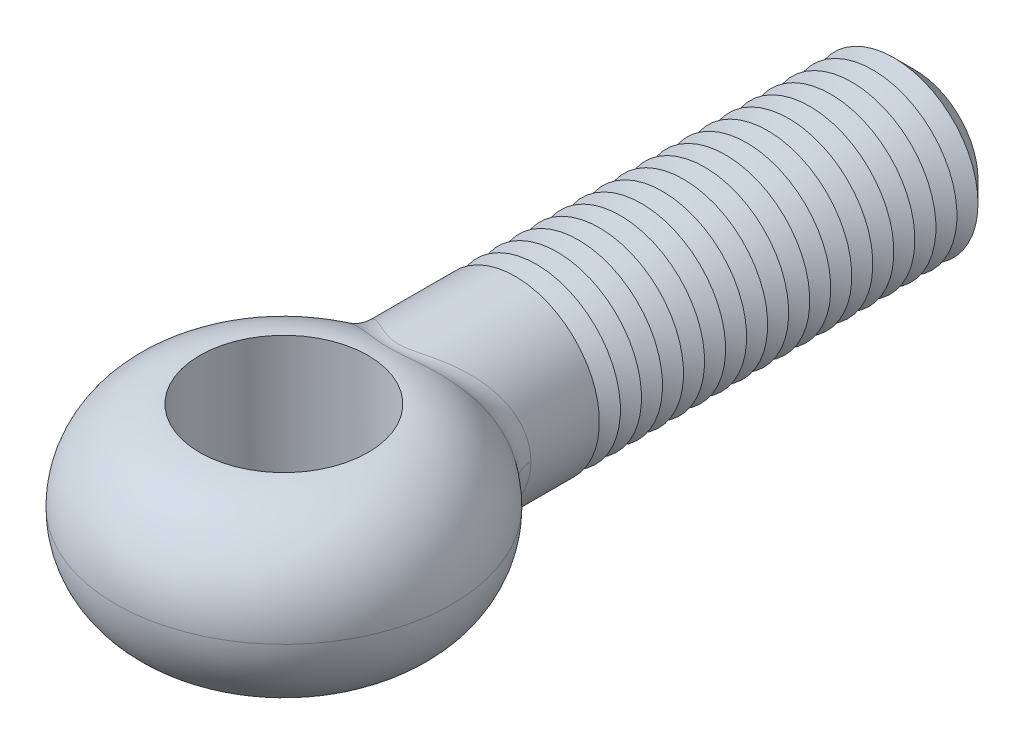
ISO-10303-21;
HEADER;
FILE_DESCRIPTION(('STEP AP214'),'2;1');
FILE_NAME('part.step','',(''),(''),'','','');
FILE_SCHEMA(('AUTOMOTIVE_DESIGN { 1 0 10303 214 1 1 1 1 }'));
ENDSEC;
DATA;
#1=APPLICATION_CONTEXT('core data for automotive mechanical design processes');
#2=APPLICATION_PROTOCOL_DEFINITION('international standard','automotive_design',2000,#1);
#3=PRODUCT_CONTEXT('',#1,'mechanical');
#4=PRODUCT('Part','Part','',(#3));
#5=PRODUCT_RELATED_PRODUCT_CATEGORY('part','',(#4));
#6=PRODUCT_DEFINITION_FORMATION('','',#4);
#7=PRODUCT_DEFINITION_CONTEXT('part definition',#1,'design');
#8=PRODUCT_DEFINITION('design','',#6,#7);
#9=PRODUCT_DEFINITION_SHAPE('','',#8);
#10=(LENGTH_UNIT() NAMED_UNIT(*) SI_UNIT(.MILLI.,.METRE.));
#11=(NAMED_UNIT(*) PLANE_ANGLE_UNIT() SI_UNIT($,.RADIAN.));
#12=(NAMED_UNIT(*) SI_UNIT($,.STERADIAN.) SOLID_ANGLE_UNIT());
#13=UNCERTAINTY_MEASURE_WITH_UNIT(LENGTH_MEASURE(1.E-05),#10,'distance_accuracy_value','');
#14=(GEOMETRIC_REPRESENTATION_CONTEXT(3) GLOBAL_UNCERTAINTY_ASSIGNED_CONTEXT((#13)) GLOBAL_UNIT_ASSIGNED_CONTEXT((#10,
#11,#12)) REPRESENTATION_CONTEXT('',''));
#15=CARTESIAN_POINT('',(0.,0.,0.));
#16=DIRECTION('',(0.,0.,1.));
#17=DIRECTION('',(1.,0.,0.));
#18=AXIS2_PLACEMENT_3D('',#15,#16,#17);
#19=CARTESIAN_POINT('',(0.,0.,-60.));
#20=DIRECTION('',(0.,0.,1.));
#21=DIRECTION('',(1.,0.,0.));
#22=AXIS2_PLACEMENT_3D('',#19,#20,#21);
#23=CYLINDRICAL_SURFACE('',#22,8.);
#24=CARTESIAN_POINT('',(0.,0.,-22.));
#25=DIRECTION('',(0.,0.,-1.));
#26=DIRECTION('',(-1.,0.,0.));
#27=AXIS2_PLACEMENT_3D('',#24,#25,#26);
#28=CIRCLE('',#27,8.);
#29=CARTESIAN_POINT('',(-8.,0.,-22.));
#30=VERTEX_POINT('',#29);
#31=EDGE_CURVE('E78',#30,#30,#28,.T.);
#32=ORIENTED_EDGE('',*,*,#31,.F.);
#33=EDGE_LOOP('',(#32));
#34=FACE_BOUND('',#33,.T.);
#35=CARTESIAN_POINT('',(7.65571552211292,-4.70868832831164,-12.4043242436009));
#36=CARTESIAN_POINT('',(6.72728970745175,-4.34389938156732,-13.262564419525));
#37=CARTESIAN_POINT('',(6.52180502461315,-4.63314787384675,-14.5297396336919));
#38=CARTESIAN_POINT('',(7.78528037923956,-4.53966232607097,-12.4565567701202));
#39=CARTESIAN_POINT('',(6.83379002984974,-4.17832451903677,-13.3197976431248));
#40=CARTESIAN_POINT('',(6.63998731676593,-4.46683351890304,-14.6083073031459));
#41=CARTESIAN_POINT('',(7.90812409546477,-4.36526473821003,-12.5059716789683));
#42=CARTESIAN_POINT('',(6.93368225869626,-4.0095233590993,-13.3734055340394));
#43=CARTESIAN_POINT('',(6.75228850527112,-4.29523375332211,-14.6825830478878));
#44=CARTESIAN_POINT('',(8.13948466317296,-4.00670892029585,-12.5988603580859));
#45=CARTESIAN_POINT('',(7.12062810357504,-3.66549770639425,-13.4736177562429));
#46=CARTESIAN_POINT('',(6.9641575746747,-3.94243016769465,-14.8221229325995));
#47=CARTESIAN_POINT('',(8.24799717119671,-3.82254775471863,-12.6423323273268));
#48=CARTESIAN_POINT('',(7.20758377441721,-3.49031776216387,-13.5201690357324));
#49=CARTESIAN_POINT('',(7.06372159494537,-3.76122345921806,-14.8873843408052));
#50=CARTESIAN_POINT('',(8.44978241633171,-3.44545520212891,-12.7230176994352));
#51=CARTESIAN_POINT('',(7.36833540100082,-3.13449696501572,-13.6061398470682));
#52=CARTESIAN_POINT('',(7.24911953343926,-3.39018051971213,-15.0084504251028));
#53=CARTESIAN_POINT('',(8.54304739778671,-3.25251941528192,-12.7602279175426));
#54=CARTESIAN_POINT('',(7.44203446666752,-2.95392242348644,-13.6455071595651));
#55=CARTESIAN_POINT('',(7.33494646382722,-3.20033995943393,-15.0642502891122));
#56=CARTESIAN_POINT('',(8.71342620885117,-2.85921824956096,-12.8280902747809));
#57=CARTESIAN_POINT('',(7.57598659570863,-2.58837905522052,-13.7170010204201));
#58=CARTESIAN_POINT('',(7.49190592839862,-2.81334843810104,-15.1659728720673));
#59=CARTESIAN_POINT('',(8.79054223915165,-2.65885388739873,-12.8587433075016));
#60=CARTESIAN_POINT('',(7.6361598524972,-2.40349985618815,-13.7490847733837));
#61=CARTESIAN_POINT('',(7.56304046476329,-2.6161984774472,-15.211896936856));
#62=CARTESIAN_POINT('',(8.92571181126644,-2.25853949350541,-12.9123976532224));
#63=CARTESIAN_POINT('',(7.74119890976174,-2.03625449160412,-13.8050560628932));
#64=CARTESIAN_POINT('',(7.68782564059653,-2.22230623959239,-15.292254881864));
#65=CARTESIAN_POINT('',(8.98429621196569,-2.05878122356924,-12.9356123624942));
#66=CARTESIAN_POINT('',(7.78643285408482,-1.85408075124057,-13.8291409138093));
#67=CARTESIAN_POINT('',(7.74196276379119,-2.02575264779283,-15.3270093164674));
#68=CARTESIAN_POINT('',(9.08514258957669,-1.65481550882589,-12.9755337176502));
#69=CARTESIAN_POINT('',(7.86407915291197,-1.48723318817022,-13.8704667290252));
#70=CARTESIAN_POINT('',(7.83520435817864,-1.62826766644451,-15.3867612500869));
#71=CARTESIAN_POINT('',(9.12739921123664,-1.45060662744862,-12.9922382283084));
#72=CARTESIAN_POINT('',(7.89643738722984,-1.3026689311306,-13.887678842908));
#73=CARTESIAN_POINT('',(7.87430389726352,-1.42733486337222,-15.4117555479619));
#74=CARTESIAN_POINT('',(9.19512372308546,-1.03944863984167,-13.0189938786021));
#75=CARTESIAN_POINT('',(7.94822057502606,-0.932097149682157,-13.9152169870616));
#76=CARTESIAN_POINT('',(7.93698863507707,-1.02277299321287,-15.4517833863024));
#77=CARTESIAN_POINT('',(9.22061021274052,-0.832502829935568,-13.0290523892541));
#78=CARTESIAN_POINT('',(7.96762552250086,-0.746210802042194,-13.9255323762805));
#79=CARTESIAN_POINT('',(7.96059102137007,-0.819147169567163,-15.4668279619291));
#80=CARTESIAN_POINT('',(9.25463049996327,-0.417038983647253,-13.042476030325));
#81=CARTESIAN_POINT('',(7.99352641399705,-0.373487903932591,-13.9392998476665));
#82=CARTESIAN_POINT('',(7.99209967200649,-0.41034851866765,-15.4869048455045));
#83=CARTESIAN_POINT('',(9.26315800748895,-0.208520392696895,-13.0458386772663));
#84=CARTESIAN_POINT('',(8.00000000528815,-0.186776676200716,-13.9427400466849));
#85=CARTESIAN_POINT('',(8.00000011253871,-0.205175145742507,-15.4919334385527));
#86=CARTESIAN_POINT('',(9.26315778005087,0.212096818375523,-13.0458386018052));
#87=CARTESIAN_POINT('',(7.99999999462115,0.189980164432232,-13.9427400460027));
#88=CARTESIAN_POINT('',(7.99999988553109,0.208694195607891,-15.4919333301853));
#89=CARTESIAN_POINT('',(9.25433501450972,0.424195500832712,-13.0423595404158));
#90=CARTESIAN_POINT('',(7.99330246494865,0.379894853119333,-13.9391808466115));
#91=CARTESIAN_POINT('',(7.99182588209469,0.417390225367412,-15.4867306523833));
#92=CARTESIAN_POINT('',(9.21912567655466,0.846898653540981,-13.0284665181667));
#93=CARTESIAN_POINT('',(7.96649487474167,0.759132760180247,-13.9249313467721));
#94=CARTESIAN_POINT('',(7.95921621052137,0.833312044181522,-15.4659516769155));
#95=CARTESIAN_POINT('',(9.19273228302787,1.05750251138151,-13.0180498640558));
#96=CARTESIAN_POINT('',(7.94639841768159,0.948323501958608,-13.9142482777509));
#97=CARTESIAN_POINT('',(7.93477422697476,1.04053723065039,-15.4503713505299));
#98=CARTESIAN_POINT('',(9.12263828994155,1.47558922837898,-12.9903565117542));
#99=CARTESIAN_POINT('',(7.89279270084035,1.32522192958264,-13.8857402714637));
#100=CARTESIAN_POINT('',(7.86989829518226,1.45191667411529,-15.4089401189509));
#101=CARTESIAN_POINT('',(9.07893758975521,1.68307206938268,-12.9730797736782));
#102=CARTESIAN_POINT('',(7.85932019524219,1.51280379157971,-13.867934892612));
#103=CARTESIAN_POINT('',(7.82946425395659,1.65607091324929,-15.3830891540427));
#104=CARTESIAN_POINT('',(8.97463738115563,2.09350607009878,-12.9317860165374));
#105=CARTESIAN_POINT('',(7.77898033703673,1.88569930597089,-13.8251732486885));
#106=CARTESIAN_POINT('',(7.73303581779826,2.05992041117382,-15.3212813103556));
#107=CARTESIAN_POINT('',(8.91403167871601,2.29645553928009,-12.9077665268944));
#108=CARTESIAN_POINT('',(7.73216134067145,2.07089682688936,-13.8002427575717));
#109=CARTESIAN_POINT('',(7.67703571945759,2.25961400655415,-15.2853207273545));
#110=CARTESIAN_POINT('',(8.7766400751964,2.69595109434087,-12.8532186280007));
#111=CARTESIAN_POINT('',(7.62531367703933,2.43769964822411,-13.7433022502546));
#112=CARTESIAN_POINT('',(7.55021504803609,2.65270054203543,-15.2036203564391));
#113=CARTESIAN_POINT('',(8.69988632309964,2.8925090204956,-12.8227031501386));
#114=CARTESIAN_POINT('',(7.56537860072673,2.61920953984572,-13.7113422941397));
#115=CARTESIAN_POINT('',(7.47942392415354,2.84610513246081,-15.1578999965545));
#116=CARTESIAN_POINT('',(8.53082157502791,3.27836797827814,-12.7553515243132));
#117=CARTESIAN_POINT('',(7.43237570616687,2.97809298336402,-13.6403484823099));
#118=CARTESIAN_POINT('',(7.32369350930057,3.2257738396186,-15.0569382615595));
#119=CARTESIAN_POINT('',(8.43850992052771,3.46766870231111,-12.7185151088));
#120=CARTESIAN_POINT('',(7.35938539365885,3.15538265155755,-13.6013561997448));
#121=CARTESIAN_POINT('',(7.23875361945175,3.41203765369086,-15.0016964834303));
#122=CARTESIAN_POINT('',(8.23912752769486,3.83785366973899,-12.638780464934));
#123=CARTESIAN_POINT('',(7.200476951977,3.50486381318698,-13.5163651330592));
#124=CARTESIAN_POINT('',(7.05558212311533,3.77628382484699,-14.8820525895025));
#125=CARTESIAN_POINT('',(8.13205660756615,4.01873780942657,-12.5958821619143));
#126=CARTESIAN_POINT('',(7.1146443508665,3.676990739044,-13.470412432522));
#127=CARTESIAN_POINT('',(6.95735035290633,3.9542660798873,-14.8176503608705));
#128=CARTESIAN_POINT('',(7.90405644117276,4.37102436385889,-12.5043342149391));
#129=CARTESIAN_POINT('',(6.93036449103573,4.01512460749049,-13.3716246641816));
#130=CARTESIAN_POINT('',(6.74856869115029,4.30090097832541,-14.6801217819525));
#131=CARTESIAN_POINT('',(7.7831309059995,4.54242929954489,-12.455686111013));
#132=CARTESIAN_POINT('',(6.83201017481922,4.18108915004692,-13.3188399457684));
#133=CARTESIAN_POINT('',(6.6380220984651,4.46955610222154,-14.606997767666));
#134=CARTESIAN_POINT('',(7.52417170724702,4.88033437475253,-12.3512981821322));
#135=CARTESIAN_POINT('',(6.61966655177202,4.51122245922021,-13.2047290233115));
#136=CARTESIAN_POINT('',(6.40182236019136,4.8020402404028,-14.4499782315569));
#137=CARTESIAN_POINT('',(7.38571067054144,5.04649564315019,-12.2953796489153));
#138=CARTESIAN_POINT('',(6.50535488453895,4.67515888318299,-13.1432256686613));
#139=CARTESIAN_POINT('',(6.27579579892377,4.96553581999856,-14.3658104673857));
#140=CARTESIAN_POINT('',(7.09600101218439,5.36700983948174,-12.1781888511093));
#141=CARTESIAN_POINT('',(6.26419128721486,4.99444350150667,-13.0133186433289));
#142=CARTESIAN_POINT('',(6.01283258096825,5.28090807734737,-14.1892780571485));
#143=CARTESIAN_POINT('',(6.9447557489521,5.52136584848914,-12.1169179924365));
#144=CARTESIAN_POINT('',(6.13743653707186,5.14979233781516,-12.9449680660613));
#145=CARTESIAN_POINT('',(5.87589879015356,5.43278778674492,-14.096915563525));
#146=CARTESIAN_POINT('',(6.63032399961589,5.81777921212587,-11.9894408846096));
#147=CARTESIAN_POINT('',(5.87186134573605,5.45104206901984,-12.8016646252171));
#148=CARTESIAN_POINT('',(5.59214975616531,5.72444585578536,-13.9045942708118));
#149=CARTESIAN_POINT('',(6.46713092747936,5.95982968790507,-11.9232319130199));
#150=CARTESIAN_POINT('',(5.73311888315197,5.5969588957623,-12.7267542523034));
#151=CARTESIAN_POINT('',(5.44532906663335,5.864217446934,-13.8046312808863));
#152=CARTESIAN_POINT('',(6.12980638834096,6.23103471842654,-11.7864658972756));
#153=CARTESIAN_POINT('',(5.44428764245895,5.8782916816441,-12.5708631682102));
#154=CARTESIAN_POINT('',(5.14301550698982,6.13107159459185,-13.597971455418));
#155=CARTESIAN_POINT('',(5.95567749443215,6.36019228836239,-11.7159098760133));
#156=CARTESIAN_POINT('',(5.2942739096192,6.01375077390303,-12.4899226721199));
#157=CARTESIAN_POINT('',(4.98752467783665,6.25815711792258,-13.4912762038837));
#158=CARTESIAN_POINT('',(5.58077734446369,6.61655266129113,-11.5644429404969));
#159=CARTESIAN_POINT('',(4.96933836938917,6.28519206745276,-12.3149807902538));
#160=CARTESIAN_POINT('',(4.65426780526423,6.51040475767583,-13.2620454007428));
#161=CARTESIAN_POINT('',(5.37902613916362,6.74249537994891,-11.4831752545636));
#162=CARTESIAN_POINT('',(4.79337910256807,6.42023065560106,-12.2204520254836));
#163=CARTESIAN_POINT('',(4.47576535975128,6.63432700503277,-13.1389537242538));
#164=CARTESIAN_POINT('',(4.96405939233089,6.97841153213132,-11.3172707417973));
#165=CARTESIAN_POINT('',(4.42939848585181,6.67584287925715,-12.0261057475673));
#166=CARTESIAN_POINT('',(4.11078186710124,6.86645840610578,-12.8874694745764));
#167=CARTESIAN_POINT('',(4.75084610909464,7.08838809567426,-11.2326345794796));
#168=CARTESIAN_POINT('',(4.24142531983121,6.79651407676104,-11.9263073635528));
#169=CARTESIAN_POINT('',(3.9243023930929,6.97467063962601,-12.7590779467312));
#170=CARTESIAN_POINT('',(4.31305945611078,7.29234286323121,-11.0613975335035));
#171=CARTESIAN_POINT('',(3.85380278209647,7.02260612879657,-11.7231213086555));
#172=CARTESIAN_POINT('',(3.54408562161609,7.17535340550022,-12.4991467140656));
#173=CARTESIAN_POINT('',(4.08848183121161,7.3863150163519,-10.9747959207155));
#174=CARTESIAN_POINT('',(3.654162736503,7.12813046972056,-11.6197260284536));
#175=CARTESIAN_POINT('',(3.35034561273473,7.26781798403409,-12.3676058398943));
#176=CARTESIAN_POINT('',(3.62764081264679,7.55817215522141,-10.8018106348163));
#177=CARTESIAN_POINT('',(3.24335533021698,7.32304867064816,-11.4120811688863));
#178=CARTESIAN_POINT('',(2.95605890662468,7.43691805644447,-12.1047402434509));
#179=CARTESIAN_POINT('',(3.3913812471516,7.63606236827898,-10.7154268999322));
#180=CARTESIAN_POINT('',(3.03217009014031,7.41256504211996,-11.3077963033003));
#181=CARTESIAN_POINT('',(2.7555144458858,7.51355869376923,-11.9734154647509));
#182=CARTESIAN_POINT('',(3.01086953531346,7.74546693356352,-10.5830417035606));
#183=CARTESIAN_POINT('',(2.69133046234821,7.53961841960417,-11.1471485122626));
#184=CARTESIAN_POINT('',(2.43558876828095,7.62120810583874,-11.7721230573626));
#185=CARTESIAN_POINT('',(2.87105562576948,7.78246196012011,-10.5357450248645));
#186=CARTESIAN_POINT('',(2.5661213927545,7.58284459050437,-11.0896499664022));
#187=CARTESIAN_POINT('',(2.31864844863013,7.65760962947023,-11.700201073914));
#188=CARTESIAN_POINT('',(2.58677327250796,7.85120381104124,-10.4433981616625));
#189=CARTESIAN_POINT('',(2.31149724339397,7.66361225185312,-10.9771506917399));
#190=CARTESIAN_POINT('',(2.08222311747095,7.725248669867,-11.5597728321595));
#191=CARTESIAN_POINT('',(2.4423056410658,7.88295154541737,-10.3983475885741));
#192=CARTESIAN_POINT('',(2.18206471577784,7.70117677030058,-10.9221313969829));
#193=CARTESIAN_POINT('',(1.96273855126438,7.75648708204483,-11.4912659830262));
#194=CARTESIAN_POINT('',(2.14829229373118,7.94107768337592,-10.3118779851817));
#195=CARTESIAN_POINT('',(1.91873101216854,7.77031102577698,-10.8163504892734));
#196=CARTESIAN_POINT('',(1.72099254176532,7.81368071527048,-11.3597855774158));
#197=CARTESIAN_POINT('',(1.99874950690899,7.96745912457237,-10.270456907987));
#198=CARTESIAN_POINT('',(1.78480669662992,7.80190571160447,-10.7655636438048));
#199=CARTESIAN_POINT('',(1.59873271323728,7.83963892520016,-11.2968089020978));
#200=CARTESIAN_POINT('',(1.69405593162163,8.0146723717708,-10.193104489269));
#201=CARTESIAN_POINT('',(1.51212291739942,7.85870857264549,-10.6706050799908));
#202=CARTESIAN_POINT('',(1.35106400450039,7.88609474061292,-11.1792198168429));
#203=CARTESIAN_POINT('',(1.53890651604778,8.03550552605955,-10.1571718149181));
#204=CARTESIAN_POINT('',(1.3733287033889,7.88393882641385,-10.6264046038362));
#205=CARTESIAN_POINT('',(1.22565589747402,7.90659367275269,-11.1246053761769));
#206=CARTESIAN_POINT('',(1.26101534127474,8.06699003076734,-10.1009556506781));
#207=CARTESIAN_POINT('',(1.12491664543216,7.92221302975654,-10.5571921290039));
#208=CARTESIAN_POINT('',(1.00219933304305,7.93757307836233,-11.0391767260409));
#209=CARTESIAN_POINT('',(1.13947852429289,8.07888519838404,-10.0789878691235));
#210=CARTESIAN_POINT('',(1.01633877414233,7.93673299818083,-10.5301169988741));
#211=CARTESIAN_POINT('',(0.90484411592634,7.94927741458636,-11.0057989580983));
#212=CARTESIAN_POINT('',(0.893460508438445,8.09911575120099,-10.0408546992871));
#213=CARTESIAN_POINT('',(0.796699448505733,7.96148016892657,-10.4831027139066));
#214=CARTESIAN_POINT('',(0.708414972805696,7.96918341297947,-10.9478665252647));
#215=CARTESIAN_POINT('',(0.768980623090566,8.10745269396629,-10.0246867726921));
#216=CARTESIAN_POINT('',(0.685612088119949,7.97171600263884,-10.4631484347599));
#217=CARTESIAN_POINT('',(0.609341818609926,7.97738660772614,-10.9233080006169));
#218=CARTESIAN_POINT('',(0.518300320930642,8.12036544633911,-9.9993428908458));
#219=CARTESIAN_POINT('',(0.46202700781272,7.98758747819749,-10.4318683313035));
#220=CARTESIAN_POINT('',(0.410276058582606,7.99009220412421,-10.8848145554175));
#221=CARTESIAN_POINT('',(0.39210936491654,8.12495695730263,-9.99013775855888));
#222=CARTESIAN_POINT('',(0.349505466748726,7.99324704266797,-10.4204974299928));
#223=CARTESIAN_POINT('',(0.310289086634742,7.99461005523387,-10.8708353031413));
#224=CARTESIAN_POINT('',(0.138717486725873,8.13030926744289,-9.97938544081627));
#225=CARTESIAN_POINT('',(0.123640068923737,7.99984388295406,-10.4072188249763));
#226=CARTESIAN_POINT('',(0.109710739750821,7.99987649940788,-10.8545066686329));
#227=CARTESIAN_POINT('',(0.0115166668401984,8.13107044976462,-9.97783748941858));
#228=CARTESIAN_POINT('',(0.0102607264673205,8.00078372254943,-10.4053059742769));
#229=CARTESIAN_POINT('',(0.00911942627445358,8.00062546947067,-10.8521561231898));
#230=CARTESIAN_POINT('',(-0.242597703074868,8.12873778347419,-9.98254200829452));
#231=CARTESIAN_POINT('',(-0.216224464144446,7.99790731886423,-10.4111163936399));
#232=CARTESIAN_POINT('',(-0.191921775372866,7.99833022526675,-10.8593002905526));
#233=CARTESIAN_POINT('',(-0.369510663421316,8.1256389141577,-9.9888046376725));
#234=CARTESIAN_POINT('',(-0.329366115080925,7.99408395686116,-10.4188540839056));
#235=CARTESIAN_POINT('',(-0.292371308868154,7.9952810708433,-10.8688104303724));
#236=CARTESIAN_POINT('',(-0.62154313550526,8.1156691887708,-10.0085955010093));
#237=CARTESIAN_POINT('',(-0.55409126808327,7.98181341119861,-10.4432875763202));
#238=CARTESIAN_POINT('',(-0.492201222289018,7.98547128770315,-10.8988675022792));
#239=CARTESIAN_POINT('',(-0.746662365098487,8.1087977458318,-10.0221248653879));
#240=CARTESIAN_POINT('',(-0.665708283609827,7.97336172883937,-10.4599921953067));
#241=CARTESIAN_POINT('',(-0.591581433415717,7.97871008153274,-10.9194161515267));
#242=CARTESIAN_POINT('',(-0.994807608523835,8.09140385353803,-10.0554975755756));
#243=CARTESIAN_POINT('',(-0.887155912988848,7.95203968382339,-10.5011571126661));
#244=CARTESIAN_POINT('',(-0.789239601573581,7.9615952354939,-10.9701112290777));
#245=CARTESIAN_POINT('',(-1.11781918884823,8.08086243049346,-10.0753736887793));
#246=CARTESIAN_POINT('',(-0.997003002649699,7.93914030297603,-10.5256688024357));
#247=CARTESIAN_POINT('',(-0.887509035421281,7.95122292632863,-11.0003074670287));
#248=CARTESIAN_POINT('',(-1.36062252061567,8.05632046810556,-10.1202009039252));
#249=CARTESIAN_POINT('',(-1.21391840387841,7.90923091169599,-10.5808872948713));
#250=CARTESIAN_POINT('',(-1.08217747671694,7.92707468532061,-11.0684211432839));
#251=CARTESIAN_POINT('',(-1.48041386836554,8.04231949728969,-10.1451526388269));
#252=CARTESIAN_POINT('',(-1.32101027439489,7.89221272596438,-10.6116076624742));
#253=CARTESIAN_POINT('',(-1.17857624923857,7.91329832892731,-11.1063395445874));
#254=CARTESIAN_POINT('',(-1.83571751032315,7.99525450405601,-10.2260259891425));
#255=CARTESIAN_POINT('',(-1.63896719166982,7.83523151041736,-10.7111025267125));
#256=CARTESIAN_POINT('',(-1.46567741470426,7.86698838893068,-11.2292596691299));
#257=CARTESIAN_POINT('',(-2.06624268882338,7.95719484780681,-10.2878252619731));
#258=CARTESIAN_POINT('',(-1.84542427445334,7.78943990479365,-10.786994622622));
#259=CARTESIAN_POINT('',(-1.65355562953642,7.82953931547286,-11.323212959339));
#260=CARTESIAN_POINT('',(-2.51536964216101,7.86860887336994,-10.4197592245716));
#261=CARTESIAN_POINT('',(-2.24768618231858,7.68406371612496,-10.9484016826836));
#262=CARTESIAN_POINT('',(-2.02278766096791,7.74237450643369,-11.523822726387));
#263=CARTESIAN_POINT('',(-2.7339584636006,7.81806932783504,-10.4899027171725));
#264=CARTESIAN_POINT('',(-2.44357001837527,7.62438808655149,-11.0340073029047));
#265=CARTESIAN_POINT('',(-2.20413431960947,7.69264575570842,-11.6304926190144));
#266=CARTESIAN_POINT('',(-3.16114079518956,7.7047711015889,-10.6341356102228));
#267=CARTESIAN_POINT('',(-2.82605678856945,7.49212963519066,-11.209290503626));
#268=CARTESIAN_POINT('',(-2.56144019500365,7.5811651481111,-11.8498152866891));
#269=CARTESIAN_POINT('',(-3.36972002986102,7.64199557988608,-10.7082303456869));
#270=CARTESIAN_POINT('',(-3.01269895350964,7.41945044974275,-11.2990288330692));
#271=CARTESIAN_POINT('',(-2.7373915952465,7.51939672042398,-11.9624761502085));
#272=CARTESIAN_POINT('',(-3.77761069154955,7.50439428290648,-10.8574864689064));
#273=CARTESIAN_POINT('',(-3.37700705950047,7.26193164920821,-11.478951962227));
#274=CARTESIAN_POINT('',(-3.08400676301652,7.38400293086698,-12.1893535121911));
#275=CARTESIAN_POINT('',(-3.97692585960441,7.42957342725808,-10.9326474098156));
#276=CARTESIAN_POINT('',(-3.55470238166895,7.17701899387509,-11.5691696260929));
#277=CARTESIAN_POINT('',(-3.25467265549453,7.31038240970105,-12.3035693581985));
#278=CARTESIAN_POINT('',(-4.39445558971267,7.2564786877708,-11.0928561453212));
#279=CARTESIAN_POINT('',(-3.92598763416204,6.98268785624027,-11.7605523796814));
#280=CARTESIAN_POINT('',(-3.61448048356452,7.14006459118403,-12.5469124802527));
#281=CARTESIAN_POINT('',(-4.61137762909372,7.15638577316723,-11.1778053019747));
#282=CARTESIAN_POINT('',(-4.11816178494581,6.87146818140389,-11.8614202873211));
#283=CARTESIAN_POINT('',(-3.80283870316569,7.04157744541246,-12.6758739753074));
#284=CARTESIAN_POINT('',(-5.03418640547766,6.94053636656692,-11.3451201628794));
#285=CARTESIAN_POINT('',(-4.49106527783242,6.6346292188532,-12.0588431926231));
#286=CARTESIAN_POINT('',(-4.17223411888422,6.82919086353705,-12.9297006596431));
#287=CARTESIAN_POINT('',(-5.24007150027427,6.82477755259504,-11.4274854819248));
#288=CARTESIAN_POINT('',(-4.67176487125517,6.50890803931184,-12.1553921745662));
#289=CARTESIAN_POINT('',(-4.35327022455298,6.71528914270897,-13.0545652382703));
#290=CARTESIAN_POINT('',(-5.64018983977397,6.57785054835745,-11.5883608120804));
#291=CARTESIAN_POINT('',(-5.02102168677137,6.24402103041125,-12.3427259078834));
#292=CARTESIAN_POINT('',(-4.70691034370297,6.47232353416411,-13.2982594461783));
#293=CARTESIAN_POINT('',(-5.83443208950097,6.44669450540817,-11.6668737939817));
#294=CARTESIAN_POINT('',(-5.18953304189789,6.10478124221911,-12.4334896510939));
#295=CARTESIAN_POINT('',(-4.87952085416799,6.34327159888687,-13.417093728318));
#296=CARTESIAN_POINT('',(-6.21062987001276,6.16921890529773,-11.8191988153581));
#297=CARTESIAN_POINT('',(-5.5138573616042,5.81373255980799,-12.6083829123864));
#298=CARTESIAN_POINT('',(-5.2152572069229,6.07024747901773,-13.6474577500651));
#299=CARTESIAN_POINT('',(-6.39258596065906,6.02290003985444,-11.8930110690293));
#300=CARTESIAN_POINT('',(-5.66959067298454,5.66186103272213,-12.6924706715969));
#301=CARTESIAN_POINT('',(-5.37838348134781,5.9262759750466,-13.7589878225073));
#302=CARTESIAN_POINT('',(-6.76082954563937,5.70011889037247,-12.0423592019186));
#303=CARTESIAN_POINT('',(-5.98269684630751,5.33064591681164,-12.8614822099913));
#304=CARTESIAN_POINT('',(-5.7096924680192,5.60867313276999,-13.9844670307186));
#305=CARTESIAN_POINT('',(-6.94571467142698,5.52210505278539,-12.1173228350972));
#306=CARTESIAN_POINT('',(-6.1384387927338,5.15012845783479,-12.9455201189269));
#307=CARTESIAN_POINT('',(-5.87673584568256,5.4335151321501,-14.0975328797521));
#308=CARTESIAN_POINT('',(-7.2978095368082,5.14921557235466,-12.2598587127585));
#309=CARTESIAN_POINT('',(-6.432710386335,4.77666871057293,-13.1041242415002));
#310=CARTESIAN_POINT('',(-6.19585367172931,5.06660783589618,-14.3123318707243));
#311=CARTESIAN_POINT('',(-7.46501728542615,4.95433803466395,-12.3274301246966));
#312=CARTESIAN_POINT('',(-6.5710843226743,4.58371724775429,-13.1786053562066));
#313=CARTESIAN_POINT('',(-6.34792643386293,4.87485667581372,-14.4140637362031));
#314=CARTESIAN_POINT('',(-7.78013527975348,4.54891459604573,-12.4544969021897));
#315=CARTESIAN_POINT('',(-6.82982333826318,4.18696009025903,-13.3176780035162));
#316=CARTESIAN_POINT('',(-6.63524155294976,4.47593735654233,-14.6052189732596));
#317=CARTESIAN_POINT('',(-7.92803665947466,4.33836156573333,-12.5139885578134));
#318=CARTESIAN_POINT('',(-6.95001540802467,3.98318853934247,-13.3821752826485));
#319=CARTESIAN_POINT('',(-6.77047617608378,4.26876218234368,-14.6946366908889));
#320=CARTESIAN_POINT('',(-8.20275756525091,3.90330017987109,-12.6242339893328));
#321=CARTESIAN_POINT('',(-7.17161528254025,3.56660483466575,-13.5009298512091));
#322=CARTESIAN_POINT('',(-7.02216465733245,3.84068039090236,-14.8602256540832));
#323=CARTESIAN_POINT('',(-8.32958109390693,3.67879448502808,-12.6749894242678));
#324=CARTESIAN_POINT('',(-7.27286247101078,3.35388041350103,-13.5551002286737));
#325=CARTESIAN_POINT('',(-7.13862208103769,3.61977639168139,-14.9363994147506));
#326=CARTESIAN_POINT('',(-8.54733325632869,3.24423340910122,-12.7619453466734));
#327=CARTESIAN_POINT('',(-7.44552191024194,2.94603669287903,-13.6473748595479));
#328=CARTESIAN_POINT('',(-7.33887694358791,3.19218688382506,-15.0668289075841));
#329=CARTESIAN_POINT('',(-8.64071095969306,3.03547652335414,-12.7991477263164));
#330=CARTESIAN_POINT('',(-7.51894899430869,2.75170647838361,-13.6865686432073));
#331=CARTESIAN_POINT('',(-7.42488873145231,2.98677903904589,-15.1225967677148));
#332=CARTESIAN_POINT('',(-8.80876711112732,2.61008550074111,-12.865990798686));
#333=CARTESIAN_POINT('',(-7.65044657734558,2.35845430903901,-13.7567044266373));
#334=CARTESIAN_POINT('',(-7.57984616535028,2.56821247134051,-15.2227563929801));
#335=CARTESIAN_POINT('',(-8.88344772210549,2.39345227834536,-12.8956323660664));
#336=CARTESIAN_POINT('',(-7.70842508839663,2.15964982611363,-13.7875971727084));
#337=CARTESIAN_POINT('',(-7.64879378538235,2.35505464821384,-15.2671494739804));
#338=CARTESIAN_POINT('',(-9.01314517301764,1.9545388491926,-12.9470441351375));
#339=CARTESIAN_POINT('',(-7.80874691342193,1.75904530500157,-13.8410223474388));
#340=CARTESIAN_POINT('',(-7.76862124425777,1.9231826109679,-15.3441237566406));
#341=CARTESIAN_POINT('',(-9.06820874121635,1.7322734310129,-12.9688330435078));
#342=CARTESIAN_POINT('',(-7.85105172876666,1.55739026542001,-13.8635342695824));
#343=CARTESIAN_POINT('',(-7.81954401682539,1.70448294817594,-15.3767330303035));
#344=CARTESIAN_POINT('',(-9.15827613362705,1.28352045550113,-13.0044431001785));
#345=CARTESIAN_POINT('',(-7.92010315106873,1.151767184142,-13.9002668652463));
#346=CARTESIAN_POINT('',(-7.90287516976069,1.26292921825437,-15.4300168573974));
#347=CARTESIAN_POINT('',(-9.19329180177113,1.05703547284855,-13.0182689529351));
#348=CARTESIAN_POINT('',(-7.94680432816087,0.94795427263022,-13.9144633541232));
#349=CARTESIAN_POINT('',(-7.93529448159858,1.04007768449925,-15.4506984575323));
#350=CARTESIAN_POINT('',(-9.23310033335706,0.691727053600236,-13.0339812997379));
#351=CARTESIAN_POINT('',(-7.97713736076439,0.619900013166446,-13.9305885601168));
#352=CARTESIAN_POINT('',(-7.97215833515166,0.680629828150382,-15.4742000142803));
#353=CARTESIAN_POINT('',(-9.24436828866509,0.553629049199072,-13.0384268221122));
#354=CARTESIAN_POINT('',(-7.98571004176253,0.496050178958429,-13.9351451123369));
#355=CARTESIAN_POINT('',(-7.9825950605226,0.544747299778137,-15.4808487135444));
#356=CARTESIAN_POINT('',(-9.25939658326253,0.277025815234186,-13.0443552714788));
#357=CARTESIAN_POINT('',(-7.99714237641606,0.248119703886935,-13.9412213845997));
#358=CARTESIAN_POINT('',(-7.99651547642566,0.272581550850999,-15.4897150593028));
#359=CARTESIAN_POINT('',(-9.26315875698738,0.138520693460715,-13.0458389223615));
#360=CARTESIAN_POINT('',(-7.99999999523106,0.124076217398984,-13.9427400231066));
#361=CARTESIAN_POINT('',(-8.00000086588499,0.136298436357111,-15.4919337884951));
#362=CARTESIAN_POINT('',(-9.26315657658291,-0.211761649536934,-13.0458382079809));
#363=CARTESIAN_POINT('',(-8.00000000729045,-0.189679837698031,-13.9427400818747));
#364=CARTESIAN_POINT('',(-7.99999867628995,-0.208364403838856,-15.4919327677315));
#365=CARTESIAN_POINT('',(-9.25436090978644,-0.423559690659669,-13.0423697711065));
#366=CARTESIAN_POINT('',(-7.99332234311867,-0.379325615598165,-13.9391914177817));
#367=CARTESIAN_POINT('',(-7.99184985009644,-0.41676461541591,-15.486745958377));
#368=CARTESIAN_POINT('',(-9.2192545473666,-0.845675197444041,-13.0285173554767));
#369=CARTESIAN_POINT('',(-7.96659277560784,-0.758034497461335,-13.9249833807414));
#370=CARTESIAN_POINT('',(-7.95933558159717,-0.832108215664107,-15.4660277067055));
#371=CARTESIAN_POINT('',(-9.19293494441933,-1.05599185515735,-13.0181298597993));
#372=CARTESIAN_POINT('',(-7.94655277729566,-0.946965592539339,-13.9143303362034));
#373=CARTESIAN_POINT('',(-7.93496189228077,-1.03905080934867,-15.4504910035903));
#374=CARTESIAN_POINT('',(-9.12293145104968,-1.47414078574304,-12.9904724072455));
#375=CARTESIAN_POINT('',(-7.89301742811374,-1.32391258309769,-13.8858598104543));
#376=CARTESIAN_POINT('',(-7.87016954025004,-1.45049146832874,-15.4091135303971));
#377=CARTESIAN_POINT('',(-9.0791962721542,-1.68196383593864,-12.9731821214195));
#378=CARTESIAN_POINT('',(-7.85951913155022,-1.51179861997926,-13.8680407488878));
#379=CARTESIAN_POINT('',(-7.82970348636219,-1.65498045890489,-15.38324232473));
#380=CARTESIAN_POINT('',(-8.97478996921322,-2.09299557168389,-12.9318464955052));
#381=CARTESIAN_POINT('',(-7.77909835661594,-1.88523285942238,-13.8252360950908));
#382=CARTESIAN_POINT('',(-7.73317681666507,-2.05941810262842,-15.3213718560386));
#383=CARTESIAN_POINT('',(-8.91411827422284,-2.29620410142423,-12.9078009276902));
#384=CARTESIAN_POINT('',(-7.73222890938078,-2.07066511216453,-13.8002787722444));
#385=CARTESIAN_POINT('',(-7.67711567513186,-2.25936660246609,-15.2853722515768));
#386=CARTESIAN_POINT('',(-8.7765466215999,-2.69622247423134,-12.8531815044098));
#387=CARTESIAN_POINT('',(-7.62524114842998,-2.43794839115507,-13.7432635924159));
#388=CARTESIAN_POINT('',(-7.55012876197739,-2.65296756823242,-15.203564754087));
#389=CARTESIAN_POINT('',(-8.69967722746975,-2.89304357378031,-12.8226199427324));
#390=CARTESIAN_POINT('',(-7.56521539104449,-2.61970332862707,-13.7112552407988));
#391=CARTESIAN_POINT('',(-7.47923098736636,-2.84663111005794,-15.1577753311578));
#392=CARTESIAN_POINT('',(-8.53033202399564,-3.27942770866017,-12.7551564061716));
#393=CARTESIAN_POINT('',(-7.43198999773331,-2.97908029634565,-13.6401425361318));
#394=CARTESIAN_POINT('',(-7.32324290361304,-3.22681656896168,-15.056645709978));
#395=CARTESIAN_POINT('',(-8.43785406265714,-3.46898973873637,-12.7182535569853));
#396=CARTESIAN_POINT('',(-7.35886693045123,-3.15661777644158,-13.6010792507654));
#397=CARTESIAN_POINT('',(-7.23815063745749,-3.4133374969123,-15.0013041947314));
#398=CARTESIAN_POINT('',(-8.23838126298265,-3.83913533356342,-12.6384812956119));
#399=CARTESIAN_POINT('',(-7.19987817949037,-3.50608561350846,-13.5160445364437));
#400=CARTESIAN_POINT('',(-7.05489698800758,-3.7775449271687,-14.881603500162));
#401=CARTESIAN_POINT('',(-8.13142827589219,-4.01974280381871,-12.5956290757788));
#402=CARTESIAN_POINT('',(-7.11413550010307,-3.67796425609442,-13.4701394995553));
#403=CARTESIAN_POINT('',(-6.95677329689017,-3.95525495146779,-14.8172703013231));
#404=CARTESIAN_POINT('',(-7.90371313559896,-4.37152047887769,-12.5041971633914));
#405=CARTESIAN_POINT('',(-6.93008703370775,-4.01559388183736,-13.3714760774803));
#406=CARTESIAN_POINT('',(-6.74825601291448,-4.3013891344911,-14.6799157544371));
#407=CARTESIAN_POINT('',(-7.78295514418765,-4.54269350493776,-12.4556191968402));
#408=CARTESIAN_POINT('',(-6.83187409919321,-4.18130307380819,-13.3187679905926));
#409=CARTESIAN_POINT('',(-6.63786611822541,-4.46981606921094,-14.6068970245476));
#410=CARTESIAN_POINT('',(-7.65571552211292,-4.70868832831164,-12.4043242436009));
#411=CARTESIAN_POINT('',(-6.72728970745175,-4.34389938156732,-13.262564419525));
#412=CARTESIAN_POINT('',(-6.52180502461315,-4.63314787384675,-14.5297396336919));
#413=(BOUNDED_SURFACE() B_SPLINE_SURFACE(3,2,((#35,#36,#37),(#38,#39,#40),(#41,#42,#43),(#44,
#45,#46),(#47,#48,#49),(#50,#51,#52),(#53,#54,#55),(#56,#57,#58),(#59,#60,#61),(#62,#63,#64),
(#65,#66,#67),(#68,#69,#70),(#71,#72,#73),(#74,#75,#76),(#77,#78,#79),(#80,#81,#82),(#83,#84,
#85),(#86,#87,#88),(#89,#90,#91),(#92,#93,#94),(#95,#96,#97),(#98,#99,#100),(#101,#102,#103),
(#104,#105,#106),(#107,#108,#109),(#110,#111,#112),(#113,#114,#115),(#116,#117,#118),(#119,#120,
#121),(#122,#123,#124),(#125,#126,#127),(#128,#129,#130),(#131,#132,#133),(#134,#135,#136),
(#137,#138,#139),(#140,#141,#142),(#143,#144,#145),(#146,#147,#148),(#149,#150,#151),(#152,#153,
#154),(#155,#156,#157),(#158,#159,#160),(#161,#162,#163),(#164,#165,#166),(#167,#168,#169),
(#170,#171,#172),(#173,#174,#175),(#176,#177,#178),(#179,#180,#181),(#182,#183,#184),(#185,#186,
#187),(#188,#189,#190),(#191,#192,#193),(#194,#195,#196),(#197,#198,#199),(#200,#201,#202),
(#203,#204,#205),(#206,#207,#208),(#209,#210,#211),(#212,#213,#214),(#215,#216,#217),(#218,#219,
#220),(#221,#222,#223),(#224,#225,#226),(#227,#228,#229),(#230,#231,#232),(#233,#234,#235),
(#236,#237,#238),(#239,#240,#241),(#242,#243,#244),(#245,#246,#247),(#248,#249,#250),(#251,#252,
#253),(#254,#255,#256),(#257,#258,#259),(#260,#261,#262),(#263,#264,#265),(#266,#267,#268),
(#269,#270,#271),(#272,#273,#274),(#275,#276,#277),(#278,#279,#280),(#281,#282,#283),(#284,#285,
#286),(#287,#288,#289),(#290,#291,#292),(#293,#294,#295),(#296,#297,#298),(#299,#300,#301),
(#302,#303,#304),(#305,#306,#307),(#308,#309,#310),(#311,#312,#313),(#314,#315,#316),(#317,#318,
#319),(#320,#321,#322),(#323,#324,#325),(#326,#327,#328),(#329,#330,#331),(#332,#333,#334),
(#335,#336,#337),(#338,#339,#340),(#341,#342,#343),(#344,#345,#346),(#347,#348,#349),(#350,#351,
#352),(#353,#354,#355),(#356,#357,#358),(#359,#360,#361),(#362,#363,#364),(#365,#366,#367),
(#368,#369,#370),(#371,#372,#373),(#374,#375,#376),(#377,#378,#379),(#380,#381,#382),(#383,#384,
#385),(#386,#387,#388),(#389,#390,#391),(#392,#393,#394),(#395,#396,#397),(#398,#399,#400),
(#401,#402,#403),(#404,#405,#406),(#407,#408,#409),(#410,#411,#412)),.UNSPECIFIED.,.F.,.F.,
.F.) B_SPLINE_SURFACE_WITH_KNOTS((4,2,2,2,2,2,2,2,2,2,2,2,2,2,2,2,2,2,2,2,2,2,2,2,2,2,2,2,2,2,2,
2,2,2,2,2,2,2,2,2,2,2,2,2,2,2,2,2,2,2,2,2,2,2,2,2,2,2,2,2,2,2,4),(3,3),(0.,0.873822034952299,
1.74790830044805,2.62243779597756,3.49684803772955,4.34328791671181,5.19000517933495,
6.03578177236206,6.88187200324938,7.74247390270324,8.60341009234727,9.46435128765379,
10.3256083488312,11.1851666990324,12.0447614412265,12.9043667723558,13.7637423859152,
14.6509629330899,15.537951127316,16.4254319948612,17.3127048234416,18.2811590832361,
19.2494232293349,20.2180526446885,21.1863667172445,21.7355609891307,22.2846599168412,
22.8334471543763,23.3821009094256,23.798477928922,24.2146724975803,24.6291132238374,
25.0435124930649,25.4584513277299,25.8734547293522,26.2906363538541,26.70787003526,
27.5454035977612,28.3838286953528,29.2234160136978,30.0626612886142,31.0201220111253,
31.9777248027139,32.9345771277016,33.8913858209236,34.9443500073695,35.9974326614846,
37.0509972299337,38.1043615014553,39.0368386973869,39.9692079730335,40.8993412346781,
41.8289244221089,42.3911753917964,42.9532889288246,43.8126124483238,44.6723730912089,
45.5346846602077,46.3970253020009,47.2577531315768,48.118599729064,48.9770085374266,
49.8351592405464),(0.,1.),
.UNSPECIFIED.) GEOMETRIC_REPRESENTATION_ITEM() RATIONAL_B_SPLINE_SURFACE(((1.,0.915774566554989,
1.),(1.,0.913691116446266,1.),(1.,0.911687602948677,1.),(1.,0.907872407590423,1.),(1.,
0.906060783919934,1.),(1.,0.902661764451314,1.),(1.,0.901074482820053,1.),(1.,0.898154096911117,
1.),(1.,0.896820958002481,1.),(1.,0.894471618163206,1.),(1.,0.893446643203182,1.),(1.,
0.891675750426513,1.),(1.,0.890929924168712,1.),(1.,0.88973197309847,1.),(1.,0.889279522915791,
1.),(1.,0.88867513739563,1.),(1.,0.888523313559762,1.),(1.,0.888523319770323,1.),(1.,
0.8886804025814,1.),(1.,0.889305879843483,1.),(1.,0.889774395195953,1.),(1.,0.891014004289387,
1.),(1.,0.891785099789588,1.),(1.,0.893615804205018,1.),(1.,0.894675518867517,1.),(1.,
0.897061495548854,1.),(1.,0.898387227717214,1.),(1.,0.901282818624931,1.),(1.,0.902852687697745,
1.),(1.,0.906209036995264,1.),(1.,0.90799551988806,1.),(1.,0.911754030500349,1.),(1.,
0.913726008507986,1.),(1.,0.9178895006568,1.),(1.,0.920086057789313,1.),(1.,0.924603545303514,
1.),(1.,0.926924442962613,1.),(1.,0.931652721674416,1.),(1.,0.934060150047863,1.),(1.,
0.938918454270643,1.),(1.,0.941369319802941,1.),(1.,0.946497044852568,1.),(1.,0.949174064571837,
1.),(1.,0.954471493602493,1.),(1.,0.957091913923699,1.),(1.,0.962215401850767,1.),(1.,
0.964718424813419,1.),(1.,0.96953568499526,1.),(1.,0.971849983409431,1.),(1.,0.975261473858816,
1.),(1.,0.976451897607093,1.),(1.,0.978724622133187,1.),(1.,0.97980694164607,1.),(1.,
0.981839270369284,1.),(1.,0.982789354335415,1.),(1.,0.984528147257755,1.),(1.,0.985316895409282,
1.),(1.,0.986530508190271,1.),(1.,0.986997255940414,1.),(1.,0.987799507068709,1.),(1.,
0.98813506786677,1.),(1.,0.988658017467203,1.),(1.,0.988846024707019,1.),(1.,0.989065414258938,
1.),(1.,0.989096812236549,1.),(1.,0.989001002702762,1.),(1.,0.988873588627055,1.),(1.,
0.988467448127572,1.),(1.,0.988188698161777,1.),(1.,0.987492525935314,1.),(1.,0.987074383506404,
1.),(1.,0.986117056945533,1.),(1.,0.985577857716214,1.),(1.,0.983799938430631,1.),(1.,
0.982403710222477,1.),(1.,0.979304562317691,1.),(1.,0.977601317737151,1.),(1.,0.97396608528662,
1.),(1.,0.972033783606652,1.),(1.,0.968004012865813,1.),(1.,0.965906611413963,1.),(1.,
0.961291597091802,1.),(1.,0.958756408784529,1.),(1.,0.953598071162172,1.),(1.,0.950974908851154,
1.),(1.,0.945700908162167,1.),(1.,0.943050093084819,1.),(1.,0.937773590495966,1.),(1.,
0.935147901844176,1.),(1.,0.929713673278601,1.),(1.,0.926913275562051,1.),(1.,0.921473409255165,
1.),(1.,0.91883395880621,1.),(1.,0.913779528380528,1.),(1.,0.911364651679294,1.),(1.,
0.90682163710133,1.),(1.,0.90469344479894,1.),(1.,0.901003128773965,1.),(1.,0.899404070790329,
1.),(1.,0.896506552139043,1.),(1.,0.895208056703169,1.),(1.,0.892941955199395,1.),(1.,
0.89197356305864,1.),(1.,0.890384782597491,1.),(1.,0.889764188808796,1.),(1.,0.889057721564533,
1.),(1.,0.888857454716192,1.),(1.,0.888590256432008,1.),(1.,0.888523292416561,1.),(1.,
0.888523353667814,1.),(1.,0.888679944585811,1.),(1.,0.889303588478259,1.),(1.,0.889770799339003,
1.),(1.,0.891008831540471,1.),(1.,0.891780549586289,1.),(1.,0.893613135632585,1.),(1.,
0.894674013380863,1.),(1.,0.897063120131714,1.),(1.,0.89839084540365,1.),(1.,0.901291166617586,
1.),(1.,0.902863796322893,1.),(1.,0.906221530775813,1.),(1.,0.908006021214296,1.),(1.,
0.911759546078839,1.),(1.,0.913728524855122,1.),(1.,0.915774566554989,1.))) REPRESENTATION_ITEM('') SURFACE());
#414=CARTESIAN_POINT('',(-6.52180502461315,-4.63314787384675,-14.5297396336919));
#415=CARTESIAN_POINT('',(-6.63786611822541,-4.46981606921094,-14.6068970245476));
#416=CARTESIAN_POINT('',(-6.74825601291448,-4.3013891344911,-14.6799157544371));
#417=CARTESIAN_POINT('',(-6.95677329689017,-3.95525495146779,-14.8172703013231));
#418=CARTESIAN_POINT('',(-7.05489698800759,-3.7775449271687,-14.881603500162));
#419=CARTESIAN_POINT('',(-7.23815063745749,-3.4133374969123,-15.0013041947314));
#420=CARTESIAN_POINT('',(-7.32324290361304,-3.22681656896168,-15.056645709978));
#421=CARTESIAN_POINT('',(-7.47923098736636,-2.84663111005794,-15.1577753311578));
#422=CARTESIAN_POINT('',(-7.55012876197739,-2.65296756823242,-15.203564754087));
#423=CARTESIAN_POINT('',(-7.67711567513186,-2.25936660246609,-15.2853722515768));
#424=CARTESIAN_POINT('',(-7.73317681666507,-2.05941810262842,-15.3213718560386));
#425=CARTESIAN_POINT('',(-7.82970348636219,-1.65498045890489,-15.38324232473));
#426=CARTESIAN_POINT('',(-7.87016954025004,-1.45049146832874,-15.4091135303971));
#427=CARTESIAN_POINT('',(-7.93496189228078,-1.03905080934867,-15.4504910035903));
#428=CARTESIAN_POINT('',(-7.95933558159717,-0.832108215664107,-15.4660277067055));
#429=CARTESIAN_POINT('',(-7.99184985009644,-0.41676461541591,-15.486745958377));
#430=CARTESIAN_POINT('',(-7.99999867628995,-0.208364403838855,-15.4919327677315));
#431=CARTESIAN_POINT('',(-8.00000086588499,0.136298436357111,-15.4919337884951));
#432=CARTESIAN_POINT('',(-7.99651547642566,0.272581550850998,-15.4897150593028));
#433=CARTESIAN_POINT('',(-7.9825950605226,0.544747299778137,-15.4808487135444));
#434=CARTESIAN_POINT('',(-7.97215833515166,0.680629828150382,-15.4742000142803));
#435=CARTESIAN_POINT('',(-7.93529448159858,1.04007768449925,-15.4506984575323));
#436=CARTESIAN_POINT('',(-7.90287516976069,1.26292921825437,-15.4300168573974));
#437=CARTESIAN_POINT('',(-7.81954401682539,1.70448294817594,-15.3767330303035));
#438=CARTESIAN_POINT('',(-7.76862124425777,1.9231826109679,-15.3441237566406));
#439=CARTESIAN_POINT('',(-7.64879378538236,2.35505464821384,-15.2671494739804));
#440=CARTESIAN_POINT('',(-7.57984616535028,2.56821247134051,-15.2227563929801));
#441=CARTESIAN_POINT('',(-7.42488873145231,2.98677903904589,-15.1225967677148));
#442=CARTESIAN_POINT('',(-7.33887694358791,3.19218688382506,-15.0668289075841));
#443=CARTESIAN_POINT('',(-7.13862208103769,3.61977639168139,-14.9363994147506));
#444=CARTESIAN_POINT('',(-7.02216465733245,3.84068039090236,-14.8602256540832));
#445=CARTESIAN_POINT('',(-6.77047617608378,4.26876218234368,-14.6946366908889));
#446=CARTESIAN_POINT('',(-6.63524155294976,4.47593735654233,-14.6052189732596));
#447=CARTESIAN_POINT('',(-6.34792643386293,4.87485667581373,-14.4140637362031));
#448=CARTESIAN_POINT('',(-6.19585367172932,5.06660783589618,-14.3123318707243));
#449=CARTESIAN_POINT('',(-5.87673584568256,5.4335151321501,-14.0975328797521));
#450=CARTESIAN_POINT('',(-5.7096924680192,5.60867313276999,-13.9844670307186));
#451=CARTESIAN_POINT('',(-5.37838348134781,5.9262759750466,-13.7589878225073));
#452=CARTESIAN_POINT('',(-5.2152572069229,6.07024747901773,-13.6474577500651));
#453=CARTESIAN_POINT('',(-4.87952085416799,6.34327159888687,-13.417093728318));
#454=CARTESIAN_POINT('',(-4.70691034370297,6.47232353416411,-13.2982594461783));
#455=CARTESIAN_POINT('',(-4.35327022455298,6.71528914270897,-13.0545652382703));
#456=CARTESIAN_POINT('',(-4.17223411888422,6.82919086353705,-12.9297006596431));
#457=CARTESIAN_POINT('',(-3.80283870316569,7.04157744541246,-12.6758739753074));
#458=CARTESIAN_POINT('',(-3.61448048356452,7.14006459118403,-12.5469124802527));
#459=CARTESIAN_POINT('',(-3.25467265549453,7.31038240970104,-12.3035693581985));
#460=CARTESIAN_POINT('',(-3.08400676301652,7.38400293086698,-12.1893535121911));
#461=CARTESIAN_POINT('',(-2.7373915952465,7.51939672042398,-11.9624761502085));
#462=CARTESIAN_POINT('',(-2.56144019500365,7.5811651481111,-11.8498152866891));
#463=CARTESIAN_POINT('',(-2.20413431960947,7.69264575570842,-11.6304926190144));
#464=CARTESIAN_POINT('',(-2.02278766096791,7.74237450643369,-11.523822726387));
#465=CARTESIAN_POINT('',(-1.65355562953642,7.82953931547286,-11.323212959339));
#466=CARTESIAN_POINT('',(-1.46567741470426,7.86698838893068,-11.2292596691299));
#467=CARTESIAN_POINT('',(-1.17857624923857,7.91329832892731,-11.1063395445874));
#468=CARTESIAN_POINT('',(-1.08217747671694,7.92707468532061,-11.0684211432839));
#469=CARTESIAN_POINT('',(-0.887509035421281,7.95122292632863,-11.0003074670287));
#470=CARTESIAN_POINT('',(-0.789239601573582,7.9615952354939,-10.9701112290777));
#471=CARTESIAN_POINT('',(-0.591581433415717,7.97871008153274,-10.9194161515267));
#472=CARTESIAN_POINT('',(-0.492201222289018,7.98547128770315,-10.8988675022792));
#473=CARTESIAN_POINT('',(-0.292371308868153,7.9952810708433,-10.8688104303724));
#474=CARTESIAN_POINT('',(-0.191921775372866,7.99833022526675,-10.8593002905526));
#475=CARTESIAN_POINT('',(0.00911942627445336,8.00062546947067,-10.8521561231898));
#476=CARTESIAN_POINT('',(0.10971073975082,7.99987649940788,-10.8545066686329));
#477=CARTESIAN_POINT('',(0.310289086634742,7.99461005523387,-10.8708353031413));
#478=CARTESIAN_POINT('',(0.410276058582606,7.99009220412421,-10.8848145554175));
#479=CARTESIAN_POINT('',(0.609341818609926,7.97738660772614,-10.9233080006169));
#480=CARTESIAN_POINT('',(0.708414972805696,7.96918341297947,-10.9478665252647));
#481=CARTESIAN_POINT('',(0.90484411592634,7.94927741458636,-11.0057989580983));
#482=CARTESIAN_POINT('',(1.00219933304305,7.93757307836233,-11.0391767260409));
#483=CARTESIAN_POINT('',(1.22565589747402,7.90659367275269,-11.1246053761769));
#484=CARTESIAN_POINT('',(1.35106400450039,7.88609474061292,-11.1792198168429));
#485=CARTESIAN_POINT('',(1.59873271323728,7.83963892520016,-11.2968089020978));
#486=CARTESIAN_POINT('',(1.72099254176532,7.81368071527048,-11.3597855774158));
#487=CARTESIAN_POINT('',(1.96273855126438,7.75648708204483,-11.4912659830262));
#488=CARTESIAN_POINT('',(2.08222311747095,7.725248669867,-11.5597728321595));
#489=CARTESIAN_POINT('',(2.31864844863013,7.65760962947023,-11.700201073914));
#490=CARTESIAN_POINT('',(2.43558876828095,7.62120810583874,-11.7721230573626));
#491=CARTESIAN_POINT('',(2.7555144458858,7.51355869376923,-11.9734154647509));
#492=CARTESIAN_POINT('',(2.95605890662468,7.43691805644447,-12.1047402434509));
#493=CARTESIAN_POINT('',(3.35034561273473,7.26781798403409,-12.3676058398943));
#494=CARTESIAN_POINT('',(3.54408562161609,7.17535340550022,-12.4991467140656));
#495=CARTESIAN_POINT('',(3.9243023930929,6.97467063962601,-12.7590779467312));
#496=CARTESIAN_POINT('',(4.11078186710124,6.86645840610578,-12.8874694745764));
#497=CARTESIAN_POINT('',(4.47576535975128,6.63432700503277,-13.1389537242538));
#498=CARTESIAN_POINT('',(4.65426780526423,6.51040475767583,-13.2620454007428));
#499=CARTESIAN_POINT('',(4.98752467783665,6.25815711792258,-13.4912762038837));
#500=CARTESIAN_POINT('',(5.14301550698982,6.13107159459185,-13.597971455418));
#501=CARTESIAN_POINT('',(5.44532906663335,5.864217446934,-13.8046312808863));
#502=CARTESIAN_POINT('',(5.59214975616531,5.72444585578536,-13.9045942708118));
#503=CARTESIAN_POINT('',(5.87589879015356,5.43278778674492,-14.096915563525));
#504=CARTESIAN_POINT('',(6.01283258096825,5.28090807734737,-14.1892780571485));
#505=CARTESIAN_POINT('',(6.27579579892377,4.96553581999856,-14.3658104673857));
#506=CARTESIAN_POINT('',(6.40182236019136,4.8020402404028,-14.4499782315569));
#507=CARTESIAN_POINT('',(6.6380220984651,4.46955610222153,-14.606997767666));
#508=CARTESIAN_POINT('',(6.74856869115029,4.30090097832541,-14.6801217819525));
#509=CARTESIAN_POINT('',(6.95735035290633,3.9542660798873,-14.8176503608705));
#510=CARTESIAN_POINT('',(7.05558212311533,3.77628382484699,-14.8820525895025));
#511=CARTESIAN_POINT('',(7.23875361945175,3.41203765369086,-15.0016964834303));
#512=CARTESIAN_POINT('',(7.32369350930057,3.2257738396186,-15.0569382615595));
#513=CARTESIAN_POINT('',(7.47942392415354,2.84610513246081,-15.1578999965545));
#514=CARTESIAN_POINT('',(7.55021504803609,2.65270054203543,-15.2036203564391));
#515=CARTESIAN_POINT('',(7.67703571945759,2.25961400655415,-15.2853207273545));
#516=CARTESIAN_POINT('',(7.73303581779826,2.05992041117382,-15.3212813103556));
#517=CARTESIAN_POINT('',(7.82946425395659,1.65607091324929,-15.3830891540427));
#518=CARTESIAN_POINT('',(7.86989829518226,1.45191667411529,-15.4089401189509));
#519=CARTESIAN_POINT('',(7.93477422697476,1.04053723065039,-15.4503713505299));
#520=CARTESIAN_POINT('',(7.95921621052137,0.83331204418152,-15.4659516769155));
#521=CARTESIAN_POINT('',(7.99182588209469,0.417390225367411,-15.4867306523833));
#522=CARTESIAN_POINT('',(7.99999988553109,0.208694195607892,-15.4919333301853));
#523=CARTESIAN_POINT('',(8.00000011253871,-0.205175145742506,-15.4919334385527));
#524=CARTESIAN_POINT('',(7.99209967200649,-0.41034851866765,-15.4869048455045));
#525=CARTESIAN_POINT('',(7.96059102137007,-0.819147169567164,-15.4668279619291));
#526=CARTESIAN_POINT('',(7.93698863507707,-1.02277299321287,-15.4517833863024));
#527=CARTESIAN_POINT('',(7.87430389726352,-1.42733486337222,-15.4117555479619));
#528=CARTESIAN_POINT('',(7.83520435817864,-1.62826766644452,-15.3867612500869));
#529=CARTESIAN_POINT('',(7.74196276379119,-2.02575264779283,-15.3270093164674));
#530=CARTESIAN_POINT('',(7.68782564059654,-2.22230623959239,-15.292254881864));
#531=CARTESIAN_POINT('',(7.56304046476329,-2.6161984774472,-15.211896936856));
#532=CARTESIAN_POINT('',(7.49190592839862,-2.81334843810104,-15.1659728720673));
#533=CARTESIAN_POINT('',(7.33494646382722,-3.20033995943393,-15.0642502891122));
#534=CARTESIAN_POINT('',(7.24911953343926,-3.39018051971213,-15.0084504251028));
#535=CARTESIAN_POINT('',(7.06372159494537,-3.76122345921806,-14.8873843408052));
#536=CARTESIAN_POINT('',(6.9641575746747,-3.94243016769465,-14.8221229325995));
#537=CARTESIAN_POINT('',(6.75228850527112,-4.29523375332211,-14.6825830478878));
#538=CARTESIAN_POINT('',(6.63998731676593,-4.46683351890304,-14.6083073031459));
#539=CARTESIAN_POINT('',(6.52180502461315,-4.63314787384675,-14.5297396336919));
#540=B_SPLINE_CURVE_WITH_KNOTS('',3,(#414,#415,#416,#417,#418,#419,#420,#421,#422,#423,#424,
#425,#426,#427,#428,#429,#430,#431,#432,#433,#434,#435,#436,#437,#438,#439,#440,#441,#442,#443,
#444,#445,#446,#447,#448,#449,#450,#451,#452,#453,#454,#455,#456,#457,#458,#459,#460,#461,#462,
#463,#464,#465,#466,#467,#468,#469,#470,#471,#472,#473,#474,#475,#476,#477,#478,#479,#480,#481,
#482,#483,#484,#485,#486,#487,#488,#489,#490,#491,#492,#493,#494,#495,#496,#497,#498,#499,#500,
#501,#502,#503,#504,#505,#506,#507,#508,#509,#510,#511,#512,#513,#514,#515,#516,#517,#518,#519,
#520,#521,#522,#523,#524,#525,#526,#527,#528,#529,#530,#531,#532,#533,#534,#535,#536,#537,#538,
#539),.UNSPECIFIED.,.F.,.F.,(4,2,2,2,2,2,2,2,2,2,2,2,2,2,2,2,2,2,2,2,2,2,2,2,2,2,2,2,2,2,2,2,2,
2,2,2,2,2,2,2,2,2,2,2,2,2,2,2,2,2,2,2,2,2,2,2,2,2,2,2,2,2,4),(0.,0.8581507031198,
1.71655951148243,2.57740610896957,3.43813393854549,4.30047458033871,5.16278614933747,
6.02254679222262,6.88187031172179,7.44398384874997,8.00623481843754,8.93581800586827,
9.86595126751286,10.7983205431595,11.7307977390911,12.7841620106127,13.8377265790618,
14.8908092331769,15.9437734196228,16.9005821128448,17.8574344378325,18.8150372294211,
19.7724979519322,20.6117432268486,21.4513305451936,22.2897556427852,23.1272892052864,
23.5445228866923,23.9617045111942,24.3767079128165,24.7916467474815,25.206046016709,
25.6204867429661,26.0366813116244,26.4530583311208,27.0017120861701,27.5504993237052,
28.0995982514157,28.6487925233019,29.6171065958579,30.5857360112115,31.5540001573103,
32.5224544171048,33.4097272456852,34.2972081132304,35.1841963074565,36.0714168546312,
36.9307924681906,37.7903977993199,38.649992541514,39.5095508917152,40.3708079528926,
41.2317491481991,42.0926853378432,42.953287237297,43.7993774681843,44.6451540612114,
45.4918713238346,46.3383112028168,47.2127214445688,48.0872509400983,48.9613372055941,
49.8351592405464),.UNSPECIFIED.);
#541=CARTESIAN_POINT('',(-8.,0.,-15.4919333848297));
#542=VERTEX_POINT('',#541);
#543=CARTESIAN_POINT('',(8.,0.,-15.4919333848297));
#544=VERTEX_POINT('',#543);
#545=EDGE_CURVE('E80',#542,#544,#540,.T.);
#546=ORIENTED_EDGE('',*,*,#545,.T.);
#547=CARTESIAN_POINT('',(-7.65571552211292,4.70868832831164,-12.4043242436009));
#548=CARTESIAN_POINT('',(-6.72728970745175,4.34389938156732,-13.262564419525));
#549=CARTESIAN_POINT('',(-6.52180502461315,4.63314787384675,-14.5297396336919));
#550=CARTESIAN_POINT('',(-7.78528037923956,4.53966232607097,-12.4565567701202));
#551=CARTESIAN_POINT('',(-6.83379002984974,4.17832451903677,-13.3197976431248));
#552=CARTESIAN_POINT('',(-6.63998731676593,4.46683351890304,-14.6083073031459));
#553=CARTESIAN_POINT('',(-7.90812409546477,4.36526473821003,-12.5059716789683));
#554=CARTESIAN_POINT('',(-6.93368225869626,4.0095233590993,-13.3734055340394));
#555=CARTESIAN_POINT('',(-6.75228850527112,4.29523375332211,-14.6825830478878));
#556=CARTESIAN_POINT('',(-8.13948466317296,4.00670892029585,-12.5988603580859));
#557=CARTESIAN_POINT('',(-7.12062810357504,3.66549770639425,-13.4736177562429));
#558=CARTESIAN_POINT('',(-6.9641575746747,3.94243016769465,-14.8221229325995));
#559=CARTESIAN_POINT('',(-8.24799717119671,3.82254775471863,-12.6423323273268));
#560=CARTESIAN_POINT('',(-7.20758377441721,3.49031776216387,-13.5201690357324));
#561=CARTESIAN_POINT('',(-7.06372159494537,3.76122345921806,-14.8873843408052));
#562=CARTESIAN_POINT('',(-8.44978241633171,3.44545520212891,-12.7230176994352));
#563=CARTESIAN_POINT('',(-7.36833540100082,3.13449696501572,-13.6061398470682));
#564=CARTESIAN_POINT('',(-7.24911953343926,3.39018051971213,-15.0084504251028));
#565=CARTESIAN_POINT('',(-8.54304739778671,3.25251941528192,-12.7602279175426));
#566=CARTESIAN_POINT('',(-7.44203446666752,2.95392242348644,-13.6455071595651));
#567=CARTESIAN_POINT('',(-7.33494646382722,3.20033995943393,-15.0642502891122));
#568=CARTESIAN_POINT('',(-8.71342620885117,2.85921824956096,-12.8280902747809));
#569=CARTESIAN_POINT('',(-7.57598659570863,2.58837905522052,-13.7170010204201));
#570=CARTESIAN_POINT('',(-7.49190592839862,2.81334843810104,-15.1659728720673));
#571=CARTESIAN_POINT('',(-8.79054223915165,2.65885388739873,-12.8587433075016));
#572=CARTESIAN_POINT('',(-7.6361598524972,2.40349985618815,-13.7490847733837));
#573=CARTESIAN_POINT('',(-7.56304046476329,2.6161984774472,-15.211896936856));
#574=CARTESIAN_POINT('',(-8.92571181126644,2.25853949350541,-12.9123976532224));
#575=CARTESIAN_POINT('',(-7.74119890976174,2.03625449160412,-13.8050560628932));
#576=CARTESIAN_POINT('',(-7.68782564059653,2.22230623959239,-15.292254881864));
#577=CARTESIAN_POINT('',(-8.98429621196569,2.05878122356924,-12.9356123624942));
#578=CARTESIAN_POINT('',(-7.78643285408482,1.85408075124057,-13.8291409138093));
#579=CARTESIAN_POINT('',(-7.74196276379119,2.02575264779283,-15.3270093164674));
#580=CARTESIAN_POINT('',(-9.08514258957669,1.65481550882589,-12.9755337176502));
#581=CARTESIAN_POINT('',(-7.86407915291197,1.48723318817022,-13.8704667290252));
#582=CARTESIAN_POINT('',(-7.83520435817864,1.62826766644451,-15.3867612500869));
#583=CARTESIAN_POINT('',(-9.12739921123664,1.45060662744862,-12.9922382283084));
#584=CARTESIAN_POINT('',(-7.89643738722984,1.3026689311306,-13.887678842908));
#585=CARTESIAN_POINT('',(-7.87430389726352,1.42733486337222,-15.4117555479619));
#586=CARTESIAN_POINT('',(-9.19512372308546,1.03944863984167,-13.0189938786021));
#587=CARTESIAN_POINT('',(-7.94822057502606,0.932097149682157,-13.9152169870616));
#588=CARTESIAN_POINT('',(-7.93698863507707,1.02277299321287,-15.4517833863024));
#589=CARTESIAN_POINT('',(-9.22061021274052,0.832502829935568,-13.0290523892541));
#590=CARTESIAN_POINT('',(-7.96762552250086,0.746210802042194,-13.9255323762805));
#591=CARTESIAN_POINT('',(-7.96059102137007,0.819147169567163,-15.4668279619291));
#592=CARTESIAN_POINT('',(-9.25463049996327,0.417038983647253,-13.042476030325));
#593=CARTESIAN_POINT('',(-7.99352641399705,0.373487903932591,-13.9392998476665));
#594=CARTESIAN_POINT('',(-7.99209967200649,0.41034851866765,-15.4869048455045));
#595=CARTESIAN_POINT('',(-9.26315800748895,0.208520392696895,-13.0458386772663));
#596=CARTESIAN_POINT('',(-8.00000000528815,0.186776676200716,-13.9427400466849));
#597=CARTESIAN_POINT('',(-8.00000011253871,0.205175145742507,-15.4919334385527));
#598=CARTESIAN_POINT('',(-9.26315778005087,-0.212096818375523,-13.0458386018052));
#599=CARTESIAN_POINT('',(-7.99999999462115,-0.189980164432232,-13.9427400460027));
#600=CARTESIAN_POINT('',(-7.99999988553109,-0.208694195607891,-15.4919333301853));
#601=CARTESIAN_POINT('',(-9.25433501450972,-0.424195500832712,-13.0423595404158));
#602=CARTESIAN_POINT('',(-7.99330246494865,-0.379894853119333,-13.9391808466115));
#603=CARTESIAN_POINT('',(-7.99182588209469,-0.417390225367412,-15.4867306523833));
#604=CARTESIAN_POINT('',(-9.21912567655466,-0.846898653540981,-13.0284665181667));
#605=CARTESIAN_POINT('',(-7.96649487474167,-0.759132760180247,-13.9249313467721));
#606=CARTESIAN_POINT('',(-7.95921621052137,-0.833312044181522,-15.4659516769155));
#607=CARTESIAN_POINT('',(-9.19273228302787,-1.05750251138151,-13.0180498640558));
#608=CARTESIAN_POINT('',(-7.94639841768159,-0.948323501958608,-13.9142482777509));
#609=CARTESIAN_POINT('',(-7.93477422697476,-1.04053723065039,-15.4503713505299));
#610=CARTESIAN_POINT('',(-9.12263828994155,-1.47558922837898,-12.9903565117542));
#611=CARTESIAN_POINT('',(-7.89279270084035,-1.32522192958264,-13.8857402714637));
#612=CARTESIAN_POINT('',(-7.86989829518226,-1.45191667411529,-15.4089401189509));
#613=CARTESIAN_POINT('',(-9.07893758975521,-1.68307206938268,-12.9730797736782));
#614=CARTESIAN_POINT('',(-7.85932019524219,-1.51280379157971,-13.867934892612));
#615=CARTESIAN_POINT('',(-7.82946425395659,-1.65607091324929,-15.3830891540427));
#616=CARTESIAN_POINT('',(-8.97463738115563,-2.09350607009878,-12.9317860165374));
#617=CARTESIAN_POINT('',(-7.77898033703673,-1.88569930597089,-13.8251732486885));
#618=CARTESIAN_POINT('',(-7.73303581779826,-2.05992041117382,-15.3212813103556));
#619=CARTESIAN_POINT('',(-8.91403167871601,-2.29645553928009,-12.9077665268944));
#620=CARTESIAN_POINT('',(-7.73216134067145,-2.07089682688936,-13.8002427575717));
#621=CARTESIAN_POINT('',(-7.67703571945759,-2.25961400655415,-15.2853207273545));
#622=CARTESIAN_POINT('',(-8.7766400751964,-2.69595109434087,-12.8532186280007));
#623=CARTESIAN_POINT('',(-7.62531367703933,-2.43769964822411,-13.7433022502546));
#624=CARTESIAN_POINT('',(-7.55021504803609,-2.65270054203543,-15.2036203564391));
#625=CARTESIAN_POINT('',(-8.69988632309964,-2.8925090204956,-12.8227031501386));
#626=CARTESIAN_POINT('',(-7.56537860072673,-2.61920953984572,-13.7113422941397));
#627=CARTESIAN_POINT('',(-7.47942392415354,-2.84610513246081,-15.1578999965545));
#628=CARTESIAN_POINT('',(-8.53082157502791,-3.27836797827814,-12.7553515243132));
#629=CARTESIAN_POINT('',(-7.43237570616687,-2.97809298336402,-13.6403484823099));
#630=CARTESIAN_POINT('',(-7.32369350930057,-3.2257738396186,-15.0569382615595));
#631=CARTESIAN_POINT('',(-8.43850992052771,-3.46766870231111,-12.7185151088));
#632=CARTESIAN_POINT('',(-7.35938539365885,-3.15538265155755,-13.6013561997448));
#633=CARTESIAN_POINT('',(-7.23875361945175,-3.41203765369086,-15.0016964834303));
#634=CARTESIAN_POINT('',(-8.23912752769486,-3.83785366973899,-12.638780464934));
#635=CARTESIAN_POINT('',(-7.200476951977,-3.50486381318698,-13.5163651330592));
#636=CARTESIAN_POINT('',(-7.05558212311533,-3.77628382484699,-14.8820525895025));
#637=CARTESIAN_POINT('',(-8.13205660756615,-4.01873780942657,-12.5958821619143));
#638=CARTESIAN_POINT('',(-7.1146443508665,-3.676990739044,-13.470412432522));
#639=CARTESIAN_POINT('',(-6.95735035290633,-3.9542660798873,-14.8176503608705));
#640=CARTESIAN_POINT('',(-7.90405644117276,-4.37102436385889,-12.5043342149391));
#641=CARTESIAN_POINT('',(-6.93036449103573,-4.01512460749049,-13.3716246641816));
#642=CARTESIAN_POINT('',(-6.74856869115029,-4.30090097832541,-14.6801217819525));
#643=CARTESIAN_POINT('',(-7.7831309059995,-4.54242929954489,-12.455686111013));
#644=CARTESIAN_POINT('',(-6.83201017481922,-4.18108915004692,-13.3188399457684));
#645=CARTESIAN_POINT('',(-6.6380220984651,-4.46955610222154,-14.606997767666));
#646=CARTESIAN_POINT('',(-7.52417170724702,-4.88033437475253,-12.3512981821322));
#647=CARTESIAN_POINT('',(-6.61966655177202,-4.51122245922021,-13.2047290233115));
#648=CARTESIAN_POINT('',(-6.40182236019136,-4.8020402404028,-14.4499782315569));
#649=CARTESIAN_POINT('',(-7.38571067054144,-5.04649564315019,-12.2953796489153));
#650=CARTESIAN_POINT('',(-6.50535488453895,-4.67515888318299,-13.1432256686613));
#651=CARTESIAN_POINT('',(-6.27579579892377,-4.96553581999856,-14.3658104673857));
#652=CARTESIAN_POINT('',(-7.09600101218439,-5.36700983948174,-12.1781888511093));
#653=CARTESIAN_POINT('',(-6.26419128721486,-4.99444350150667,-13.0133186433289));
#654=CARTESIAN_POINT('',(-6.01283258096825,-5.28090807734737,-14.1892780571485));
#655=CARTESIAN_POINT('',(-6.9447557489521,-5.52136584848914,-12.1169179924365));
#656=CARTESIAN_POINT('',(-6.13743653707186,-5.14979233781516,-12.9449680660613));
#657=CARTESIAN_POINT('',(-5.87589879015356,-5.43278778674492,-14.096915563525));
#658=CARTESIAN_POINT('',(-6.63032399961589,-5.81777921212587,-11.9894408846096));
#659=CARTESIAN_POINT('',(-5.87186134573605,-5.45104206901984,-12.8016646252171));
#660=CARTESIAN_POINT('',(-5.59214975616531,-5.72444585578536,-13.9045942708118));
#661=CARTESIAN_POINT('',(-6.46713092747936,-5.95982968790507,-11.9232319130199));
#662=CARTESIAN_POINT('',(-5.73311888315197,-5.5969588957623,-12.7267542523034));
#663=CARTESIAN_POINT('',(-5.44532906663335,-5.864217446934,-13.8046312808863));
#664=CARTESIAN_POINT('',(-6.12980638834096,-6.23103471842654,-11.7864658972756));
#665=CARTESIAN_POINT('',(-5.44428764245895,-5.8782916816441,-12.5708631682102));
#666=CARTESIAN_POINT('',(-5.14301550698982,-6.13107159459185,-13.597971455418));
#667=CARTESIAN_POINT('',(-5.95567749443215,-6.36019228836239,-11.7159098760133));
#668=CARTESIAN_POINT('',(-5.2942739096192,-6.01375077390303,-12.4899226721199));
#669=CARTESIAN_POINT('',(-4.98752467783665,-6.25815711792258,-13.4912762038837));
#670=CARTESIAN_POINT('',(-5.58077734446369,-6.61655266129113,-11.5644429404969));
#671=CARTESIAN_POINT('',(-4.96933836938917,-6.28519206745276,-12.3149807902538));
#672=CARTESIAN_POINT('',(-4.65426780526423,-6.51040475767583,-13.2620454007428));
#673=CARTESIAN_POINT('',(-5.37902613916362,-6.74249537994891,-11.4831752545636));
#674=CARTESIAN_POINT('',(-4.79337910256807,-6.42023065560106,-12.2204520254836));
#675=CARTESIAN_POINT('',(-4.47576535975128,-6.63432700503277,-13.1389537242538));
#676=CARTESIAN_POINT('',(-4.96405939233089,-6.97841153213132,-11.3172707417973));
#677=CARTESIAN_POINT('',(-4.42939848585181,-6.67584287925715,-12.0261057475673));
#678=CARTESIAN_POINT('',(-4.11078186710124,-6.86645840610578,-12.8874694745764));
#679=CARTESIAN_POINT('',(-4.75084610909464,-7.08838809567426,-11.2326345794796));
#680=CARTESIAN_POINT('',(-4.24142531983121,-6.79651407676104,-11.9263073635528));
#681=CARTESIAN_POINT('',(-3.9243023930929,-6.97467063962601,-12.7590779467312));
#682=CARTESIAN_POINT('',(-4.31305945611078,-7.29234286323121,-11.0613975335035));
#683=CARTESIAN_POINT('',(-3.85380278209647,-7.02260612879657,-11.7231213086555));
#684=CARTESIAN_POINT('',(-3.54408562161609,-7.17535340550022,-12.4991467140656));
#685=CARTESIAN_POINT('',(-4.08848183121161,-7.3863150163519,-10.9747959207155));
#686=CARTESIAN_POINT('',(-3.654162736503,-7.12813046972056,-11.6197260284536));
#687=CARTESIAN_POINT('',(-3.35034561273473,-7.26781798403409,-12.3676058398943));
#688=CARTESIAN_POINT('',(-3.62764081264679,-7.55817215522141,-10.8018106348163));
#689=CARTESIAN_POINT('',(-3.24335533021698,-7.32304867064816,-11.4120811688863));
#690=CARTESIAN_POINT('',(-2.95605890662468,-7.43691805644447,-12.1047402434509));
#691=CARTESIAN_POINT('',(-3.3913812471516,-7.63606236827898,-10.7154268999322));
#692=CARTESIAN_POINT('',(-3.03217009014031,-7.41256504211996,-11.3077963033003));
#693=CARTESIAN_POINT('',(-2.7555144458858,-7.51355869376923,-11.9734154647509));
#694=CARTESIAN_POINT('',(-3.01086953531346,-7.74546693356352,-10.5830417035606));
#695=CARTESIAN_POINT('',(-2.69133046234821,-7.53961841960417,-11.1471485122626));
#696=CARTESIAN_POINT('',(-2.43558876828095,-7.62120810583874,-11.7721230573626));
#697=CARTESIAN_POINT('',(-2.87105562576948,-7.78246196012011,-10.5357450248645));
#698=CARTESIAN_POINT('',(-2.5661213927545,-7.58284459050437,-11.0896499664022));
#699=CARTESIAN_POINT('',(-2.31864844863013,-7.65760962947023,-11.700201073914));
#700=CARTESIAN_POINT('',(-2.58677327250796,-7.85120381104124,-10.4433981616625));
#701=CARTESIAN_POINT('',(-2.31149724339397,-7.66361225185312,-10.9771506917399));
#702=CARTESIAN_POINT('',(-2.08222311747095,-7.725248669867,-11.5597728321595));
#703=CARTESIAN_POINT('',(-2.4423056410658,-7.88295154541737,-10.3983475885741));
#704=CARTESIAN_POINT('',(-2.18206471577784,-7.70117677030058,-10.9221313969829));
#705=CARTESIAN_POINT('',(-1.96273855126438,-7.75648708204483,-11.4912659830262));
#706=CARTESIAN_POINT('',(-2.14829229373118,-7.94107768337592,-10.3118779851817));
#707=CARTESIAN_POINT('',(-1.91873101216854,-7.77031102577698,-10.8163504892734));
#708=CARTESIAN_POINT('',(-1.72099254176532,-7.81368071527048,-11.3597855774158));
#709=CARTESIAN_POINT('',(-1.99874950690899,-7.96745912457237,-10.270456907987));
#710=CARTESIAN_POINT('',(-1.78480669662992,-7.80190571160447,-10.7655636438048));
#711=CARTESIAN_POINT('',(-1.59873271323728,-7.83963892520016,-11.2968089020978));
#712=CARTESIAN_POINT('',(-1.69405593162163,-8.0146723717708,-10.193104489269));
#713=CARTESIAN_POINT('',(-1.51212291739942,-7.85870857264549,-10.6706050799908));
#714=CARTESIAN_POINT('',(-1.35106400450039,-7.88609474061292,-11.1792198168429));
#715=CARTESIAN_POINT('',(-1.53890651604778,-8.03550552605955,-10.1571718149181));
#716=CARTESIAN_POINT('',(-1.3733287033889,-7.88393882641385,-10.6264046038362));
#717=CARTESIAN_POINT('',(-1.22565589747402,-7.90659367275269,-11.1246053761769));
#718=CARTESIAN_POINT('',(-1.26101534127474,-8.06699003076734,-10.1009556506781));
#719=CARTESIAN_POINT('',(-1.12491664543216,-7.92221302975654,-10.5571921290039));
#720=CARTESIAN_POINT('',(-1.00219933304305,-7.93757307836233,-11.0391767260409));
#721=CARTESIAN_POINT('',(-1.13947852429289,-8.07888519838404,-10.0789878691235));
#722=CARTESIAN_POINT('',(-1.01633877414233,-7.93673299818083,-10.5301169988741));
#723=CARTESIAN_POINT('',(-0.90484411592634,-7.94927741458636,-11.0057989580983));
#724=CARTESIAN_POINT('',(-0.893460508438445,-8.09911575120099,-10.0408546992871));
#725=CARTESIAN_POINT('',(-0.796699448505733,-7.96148016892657,-10.4831027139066));
#726=CARTESIAN_POINT('',(-0.708414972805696,-7.96918341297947,-10.9478665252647));
#727=CARTESIAN_POINT('',(-0.768980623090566,-8.10745269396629,-10.0246867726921));
#728=CARTESIAN_POINT('',(-0.685612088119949,-7.97171600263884,-10.4631484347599));
#729=CARTESIAN_POINT('',(-0.609341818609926,-7.97738660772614,-10.9233080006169));
#730=CARTESIAN_POINT('',(-0.518300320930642,-8.12036544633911,-9.9993428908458));
#731=CARTESIAN_POINT('',(-0.46202700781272,-7.98758747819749,-10.4318683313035));
#732=CARTESIAN_POINT('',(-0.410276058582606,-7.99009220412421,-10.8848145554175));
#733=CARTESIAN_POINT('',(-0.39210936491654,-8.12495695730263,-9.99013775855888));
#734=CARTESIAN_POINT('',(-0.349505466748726,-7.99324704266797,-10.4204974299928));
#735=CARTESIAN_POINT('',(-0.310289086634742,-7.99461005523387,-10.8708353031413));
#736=CARTESIAN_POINT('',(-0.138717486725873,-8.13030926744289,-9.97938544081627));
#737=CARTESIAN_POINT('',(-0.123640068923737,-7.99984388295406,-10.4072188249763));
#738=CARTESIAN_POINT('',(-0.109710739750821,-7.99987649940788,-10.8545066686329));
#739=CARTESIAN_POINT('',(-0.0115166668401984,-8.13107044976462,-9.97783748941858));
#740=CARTESIAN_POINT('',(-0.0102607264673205,-8.00078372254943,-10.4053059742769));
#741=CARTESIAN_POINT('',(-0.00911942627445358,-8.00062546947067,-10.8521561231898));
#742=CARTESIAN_POINT('',(0.242597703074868,-8.12873778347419,-9.98254200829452));
#743=CARTESIAN_POINT('',(0.216224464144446,-7.99790731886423,-10.4111163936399));
#744=CARTESIAN_POINT('',(0.191921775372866,-7.99833022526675,-10.8593002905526));
#745=CARTESIAN_POINT('',(0.369510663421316,-8.1256389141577,-9.9888046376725));
#746=CARTESIAN_POINT('',(0.329366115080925,-7.99408395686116,-10.4188540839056));
#747=CARTESIAN_POINT('',(0.292371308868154,-7.9952810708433,-10.8688104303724));
#748=CARTESIAN_POINT('',(0.62154313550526,-8.1156691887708,-10.0085955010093));
#749=CARTESIAN_POINT('',(0.55409126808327,-7.98181341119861,-10.4432875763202));
#750=CARTESIAN_POINT('',(0.492201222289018,-7.98547128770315,-10.8988675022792));
#751=CARTESIAN_POINT('',(0.746662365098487,-8.1087977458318,-10.0221248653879));
#752=CARTESIAN_POINT('',(0.665708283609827,-7.97336172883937,-10.4599921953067));
#753=CARTESIAN_POINT('',(0.591581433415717,-7.97871008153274,-10.9194161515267));
#754=CARTESIAN_POINT('',(0.994807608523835,-8.09140385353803,-10.0554975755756));
#755=CARTESIAN_POINT('',(0.887155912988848,-7.95203968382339,-10.5011571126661));
#756=CARTESIAN_POINT('',(0.789239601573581,-7.9615952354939,-10.9701112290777));
#757=CARTESIAN_POINT('',(1.11781918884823,-8.08086243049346,-10.0753736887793));
#758=CARTESIAN_POINT('',(0.997003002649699,-7.93914030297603,-10.5256688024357));
#759=CARTESIAN_POINT('',(0.887509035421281,-7.95122292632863,-11.0003074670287));
#760=CARTESIAN_POINT('',(1.36062252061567,-8.05632046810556,-10.1202009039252));
#761=CARTESIAN_POINT('',(1.21391840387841,-7.90923091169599,-10.5808872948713));
#762=CARTESIAN_POINT('',(1.08217747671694,-7.92707468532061,-11.0684211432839));
#763=CARTESIAN_POINT('',(1.48041386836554,-8.04231949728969,-10.1451526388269));
#764=CARTESIAN_POINT('',(1.32101027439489,-7.89221272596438,-10.6116076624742));
#765=CARTESIAN_POINT('',(1.17857624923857,-7.91329832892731,-11.1063395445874));
#766=CARTESIAN_POINT('',(1.83571751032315,-7.99525450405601,-10.2260259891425));
#767=CARTESIAN_POINT('',(1.63896719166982,-7.83523151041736,-10.7111025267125));
#768=CARTESIAN_POINT('',(1.46567741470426,-7.86698838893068,-11.2292596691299));
#769=CARTESIAN_POINT('',(2.06624268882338,-7.95719484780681,-10.2878252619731));
#770=CARTESIAN_POINT('',(1.84542427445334,-7.78943990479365,-10.786994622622));
#771=CARTESIAN_POINT('',(1.65355562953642,-7.82953931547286,-11.323212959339));
#772=CARTESIAN_POINT('',(2.51536964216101,-7.86860887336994,-10.4197592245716));
#773=CARTESIAN_POINT('',(2.24768618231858,-7.68406371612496,-10.9484016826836));
#774=CARTESIAN_POINT('',(2.02278766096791,-7.74237450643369,-11.523822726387));
#775=CARTESIAN_POINT('',(2.7339584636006,-7.81806932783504,-10.4899027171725));
#776=CARTESIAN_POINT('',(2.44357001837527,-7.62438808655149,-11.0340073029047));
#777=CARTESIAN_POINT('',(2.20413431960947,-7.69264575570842,-11.6304926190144));
#778=CARTESIAN_POINT('',(3.16114079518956,-7.7047711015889,-10.6341356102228));
#779=CARTESIAN_POINT('',(2.82605678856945,-7.49212963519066,-11.209290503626));
#780=CARTESIAN_POINT('',(2.56144019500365,-7.5811651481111,-11.8498152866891));
#781=CARTESIAN_POINT('',(3.36972002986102,-7.64199557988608,-10.7082303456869));
#782=CARTESIAN_POINT('',(3.01269895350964,-7.41945044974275,-11.2990288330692));
#783=CARTESIAN_POINT('',(2.7373915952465,-7.51939672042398,-11.9624761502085));
#784=CARTESIAN_POINT('',(3.77761069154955,-7.50439428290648,-10.8574864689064));
#785=CARTESIAN_POINT('',(3.37700705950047,-7.26193164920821,-11.478951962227));
#786=CARTESIAN_POINT('',(3.08400676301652,-7.38400293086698,-12.1893535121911));
#787=CARTESIAN_POINT('',(3.97692585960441,-7.42957342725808,-10.9326474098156));
#788=CARTESIAN_POINT('',(3.55470238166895,-7.17701899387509,-11.5691696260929));
#789=CARTESIAN_POINT('',(3.25467265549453,-7.31038240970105,-12.3035693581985));
#790=CARTESIAN_POINT('',(4.39445558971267,-7.2564786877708,-11.0928561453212));
#791=CARTESIAN_POINT('',(3.92598763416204,-6.98268785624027,-11.7605523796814));
#792=CARTESIAN_POINT('',(3.61448048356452,-7.14006459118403,-12.5469124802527));
#793=CARTESIAN_POINT('',(4.61137762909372,-7.15638577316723,-11.1778053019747));
#794=CARTESIAN_POINT('',(4.11816178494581,-6.87146818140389,-11.8614202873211));
#795=CARTESIAN_POINT('',(3.80283870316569,-7.04157744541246,-12.6758739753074));
#796=CARTESIAN_POINT('',(5.03418640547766,-6.94053636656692,-11.3451201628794));
#797=CARTESIAN_POINT('',(4.49106527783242,-6.6346292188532,-12.0588431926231));
#798=CARTESIAN_POINT('',(4.17223411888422,-6.82919086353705,-12.9297006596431));
#799=CARTESIAN_POINT('',(5.24007150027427,-6.82477755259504,-11.4274854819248));
#800=CARTESIAN_POINT('',(4.67176487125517,-6.50890803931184,-12.1553921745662));
#801=CARTESIAN_POINT('',(4.35327022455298,-6.71528914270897,-13.0545652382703));
#802=CARTESIAN_POINT('',(5.64018983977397,-6.57785054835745,-11.5883608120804));
#803=CARTESIAN_POINT('',(5.02102168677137,-6.24402103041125,-12.3427259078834));
#804=CARTESIAN_POINT('',(4.70691034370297,-6.47232353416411,-13.2982594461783));
#805=CARTESIAN_POINT('',(5.83443208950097,-6.44669450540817,-11.6668737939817));
#806=CARTESIAN_POINT('',(5.18953304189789,-6.10478124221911,-12.4334896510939));
#807=CARTESIAN_POINT('',(4.87952085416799,-6.34327159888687,-13.417093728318));
#808=CARTESIAN_POINT('',(6.21062987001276,-6.16921890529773,-11.8191988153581));
#809=CARTESIAN_POINT('',(5.5138573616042,-5.81373255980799,-12.6083829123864));
#810=CARTESIAN_POINT('',(5.2152572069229,-6.07024747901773,-13.6474577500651));
#811=CARTESIAN_POINT('',(6.39258596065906,-6.02290003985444,-11.8930110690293));
#812=CARTESIAN_POINT('',(5.66959067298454,-5.66186103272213,-12.6924706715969));
#813=CARTESIAN_POINT('',(5.37838348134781,-5.9262759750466,-13.7589878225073));
#814=CARTESIAN_POINT('',(6.76082954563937,-5.70011889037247,-12.0423592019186));
#815=CARTESIAN_POINT('',(5.98269684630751,-5.33064591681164,-12.8614822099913));
#816=CARTESIAN_POINT('',(5.7096924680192,-5.60867313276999,-13.9844670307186));
#817=CARTESIAN_POINT('',(6.94571467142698,-5.52210505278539,-12.1173228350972));
#818=CARTESIAN_POINT('',(6.1384387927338,-5.15012845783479,-12.9455201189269));
#819=CARTESIAN_POINT('',(5.87673584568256,-5.4335151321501,-14.0975328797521));
#820=CARTESIAN_POINT('',(7.2978095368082,-5.14921557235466,-12.2598587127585));
#821=CARTESIAN_POINT('',(6.432710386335,-4.77666871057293,-13.1041242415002));
#822=CARTESIAN_POINT('',(6.19585367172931,-5.06660783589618,-14.3123318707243));
#823=CARTESIAN_POINT('',(7.46501728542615,-4.95433803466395,-12.3274301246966));
#824=CARTESIAN_POINT('',(6.5710843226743,-4.58371724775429,-13.1786053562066));
#825=CARTESIAN_POINT('',(6.34792643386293,-4.87485667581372,-14.4140637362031));
#826=CARTESIAN_POINT('',(7.78013527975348,-4.54891459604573,-12.4544969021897));
#827=CARTESIAN_POINT('',(6.82982333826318,-4.18696009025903,-13.3176780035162));
#828=CARTESIAN_POINT('',(6.63524155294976,-4.47593735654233,-14.6052189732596));
#829=CARTESIAN_POINT('',(7.92803665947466,-4.33836156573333,-12.5139885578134));
#830=CARTESIAN_POINT('',(6.95001540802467,-3.98318853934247,-13.3821752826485));
#831=CARTESIAN_POINT('',(6.77047617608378,-4.26876218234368,-14.6946366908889));
#832=CARTESIAN_POINT('',(8.20275756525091,-3.90330017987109,-12.6242339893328));
#833=CARTESIAN_POINT('',(7.17161528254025,-3.56660483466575,-13.5009298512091));
#834=CARTESIAN_POINT('',(7.02216465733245,-3.84068039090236,-14.8602256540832));
#835=CARTESIAN_POINT('',(8.32958109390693,-3.67879448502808,-12.6749894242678));
#836=CARTESIAN_POINT('',(7.27286247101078,-3.35388041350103,-13.5551002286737));
#837=CARTESIAN_POINT('',(7.13862208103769,-3.61977639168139,-14.9363994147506));
#838=CARTESIAN_POINT('',(8.54733325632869,-3.24423340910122,-12.7619453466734));
#839=CARTESIAN_POINT('',(7.44552191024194,-2.94603669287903,-13.6473748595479));
#840=CARTESIAN_POINT('',(7.33887694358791,-3.19218688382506,-15.0668289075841));
#841=CARTESIAN_POINT('',(8.64071095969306,-3.03547652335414,-12.7991477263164));
#842=CARTESIAN_POINT('',(7.51894899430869,-2.75170647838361,-13.6865686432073));
#843=CARTESIAN_POINT('',(7.42488873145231,-2.98677903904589,-15.1225967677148));
#844=CARTESIAN_POINT('',(8.80876711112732,-2.61008550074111,-12.865990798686));
#845=CARTESIAN_POINT('',(7.65044657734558,-2.35845430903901,-13.7567044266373));
#846=CARTESIAN_POINT('',(7.57984616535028,-2.56821247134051,-15.2227563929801));
#847=CARTESIAN_POINT('',(8.88344772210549,-2.39345227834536,-12.8956323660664));
#848=CARTESIAN_POINT('',(7.70842508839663,-2.15964982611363,-13.7875971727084));
#849=CARTESIAN_POINT('',(7.64879378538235,-2.35505464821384,-15.2671494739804));
#850=CARTESIAN_POINT('',(9.01314517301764,-1.9545388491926,-12.9470441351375));
#851=CARTESIAN_POINT('',(7.80874691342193,-1.75904530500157,-13.8410223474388));
#852=CARTESIAN_POINT('',(7.76862124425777,-1.9231826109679,-15.3441237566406));
#853=CARTESIAN_POINT('',(9.06820874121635,-1.7322734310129,-12.9688330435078));
#854=CARTESIAN_POINT('',(7.85105172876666,-1.55739026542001,-13.8635342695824));
#855=CARTESIAN_POINT('',(7.81954401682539,-1.70448294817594,-15.3767330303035));
#856=CARTESIAN_POINT('',(9.15827613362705,-1.28352045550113,-13.0044431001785));
#857=CARTESIAN_POINT('',(7.92010315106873,-1.151767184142,-13.9002668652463));
#858=CARTESIAN_POINT('',(7.90287516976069,-1.26292921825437,-15.4300168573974));
#859=CARTESIAN_POINT('',(9.19329180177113,-1.05703547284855,-13.0182689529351));
#860=CARTESIAN_POINT('',(7.94680432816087,-0.94795427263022,-13.9144633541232));
#861=CARTESIAN_POINT('',(7.93529448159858,-1.04007768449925,-15.4506984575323));
#862=CARTESIAN_POINT('',(9.23310033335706,-0.691727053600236,-13.0339812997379));
#863=CARTESIAN_POINT('',(7.97713736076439,-0.619900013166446,-13.9305885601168));
#864=CARTESIAN_POINT('',(7.97215833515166,-0.680629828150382,-15.4742000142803));
#865=CARTESIAN_POINT('',(9.24436828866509,-0.553629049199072,-13.0384268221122));
#866=CARTESIAN_POINT('',(7.98571004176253,-0.496050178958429,-13.9351451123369));
#867=CARTESIAN_POINT('',(7.9825950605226,-0.544747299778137,-15.4808487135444));
#868=CARTESIAN_POINT('',(9.25939658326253,-0.277025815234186,-13.0443552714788));
#869=CARTESIAN_POINT('',(7.99714237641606,-0.248119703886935,-13.9412213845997));
#870=CARTESIAN_POINT('',(7.99651547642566,-0.272581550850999,-15.4897150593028));
#871=CARTESIAN_POINT('',(9.26315875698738,-0.138520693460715,-13.0458389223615));
#872=CARTESIAN_POINT('',(7.99999999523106,-0.124076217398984,-13.9427400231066));
#873=CARTESIAN_POINT('',(8.00000086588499,-0.136298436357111,-15.4919337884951));
#874=CARTESIAN_POINT('',(9.26315657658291,0.211761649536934,-13.0458382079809));
#875=CARTESIAN_POINT('',(8.00000000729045,0.189679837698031,-13.9427400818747));
#876=CARTESIAN_POINT('',(7.99999867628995,0.208364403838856,-15.4919327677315));
#877=CARTESIAN_POINT('',(9.25436090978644,0.423559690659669,-13.0423697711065));
#878=CARTESIAN_POINT('',(7.99332234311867,0.379325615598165,-13.9391914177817));
#879=CARTESIAN_POINT('',(7.99184985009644,0.41676461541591,-15.486745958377));
#880=CARTESIAN_POINT('',(9.2192545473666,0.845675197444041,-13.0285173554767));
#881=CARTESIAN_POINT('',(7.96659277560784,0.758034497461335,-13.9249833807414));
#882=CARTESIAN_POINT('',(7.95933558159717,0.832108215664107,-15.4660277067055));
#883=CARTESIAN_POINT('',(9.19293494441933,1.05599185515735,-13.0181298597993));
#884=CARTESIAN_POINT('',(7.94655277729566,0.946965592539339,-13.9143303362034));
#885=CARTESIAN_POINT('',(7.93496189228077,1.03905080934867,-15.4504910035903));
#886=CARTESIAN_POINT('',(9.12293145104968,1.47414078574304,-12.9904724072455));
#887=CARTESIAN_POINT('',(7.89301742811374,1.32391258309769,-13.8858598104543));
#888=CARTESIAN_POINT('',(7.87016954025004,1.45049146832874,-15.4091135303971));
#889=CARTESIAN_POINT('',(9.0791962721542,1.68196383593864,-12.9731821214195));
#890=CARTESIAN_POINT('',(7.85951913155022,1.51179861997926,-13.8680407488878));
#891=CARTESIAN_POINT('',(7.82970348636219,1.65498045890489,-15.38324232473));
#892=CARTESIAN_POINT('',(8.97478996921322,2.09299557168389,-12.9318464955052));
#893=CARTESIAN_POINT('',(7.77909835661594,1.88523285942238,-13.8252360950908));
#894=CARTESIAN_POINT('',(7.73317681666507,2.05941810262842,-15.3213718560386));
#895=CARTESIAN_POINT('',(8.91411827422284,2.29620410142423,-12.9078009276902));
#896=CARTESIAN_POINT('',(7.73222890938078,2.07066511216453,-13.8002787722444));
#897=CARTESIAN_POINT('',(7.67711567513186,2.25936660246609,-15.2853722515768));
#898=CARTESIAN_POINT('',(8.7765466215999,2.69622247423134,-12.8531815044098));
#899=CARTESIAN_POINT('',(7.62524114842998,2.43794839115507,-13.7432635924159));
#900=CARTESIAN_POINT('',(7.55012876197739,2.65296756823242,-15.203564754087));
#901=CARTESIAN_POINT('',(8.69967722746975,2.89304357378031,-12.8226199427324));
#902=CARTESIAN_POINT('',(7.56521539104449,2.61970332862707,-13.7112552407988));
#903=CARTESIAN_POINT('',(7.47923098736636,2.84663111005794,-15.1577753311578));
#904=CARTESIAN_POINT('',(8.53033202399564,3.27942770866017,-12.7551564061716));
#905=CARTESIAN_POINT('',(7.43198999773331,2.97908029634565,-13.6401425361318));
#906=CARTESIAN_POINT('',(7.32324290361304,3.22681656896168,-15.056645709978));
#907=CARTESIAN_POINT('',(8.43785406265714,3.46898973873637,-12.7182535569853));
#908=CARTESIAN_POINT('',(7.35886693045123,3.15661777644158,-13.6010792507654));
#909=CARTESIAN_POINT('',(7.23815063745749,3.4133374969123,-15.0013041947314));
#910=CARTESIAN_POINT('',(8.23838126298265,3.83913533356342,-12.6384812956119));
#911=CARTESIAN_POINT('',(7.19987817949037,3.50608561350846,-13.5160445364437));
#912=CARTESIAN_POINT('',(7.05489698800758,3.7775449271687,-14.881603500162));
#913=CARTESIAN_POINT('',(8.13142827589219,4.01974280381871,-12.5956290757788));
#914=CARTESIAN_POINT('',(7.11413550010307,3.67796425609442,-13.4701394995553));
#915=CARTESIAN_POINT('',(6.95677329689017,3.95525495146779,-14.8172703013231));
#916=CARTESIAN_POINT('',(7.90371313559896,4.37152047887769,-12.5041971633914));
#917=CARTESIAN_POINT('',(6.93008703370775,4.01559388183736,-13.3714760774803));
#918=CARTESIAN_POINT('',(6.74825601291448,4.3013891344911,-14.6799157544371));
#919=CARTESIAN_POINT('',(7.78295514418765,4.54269350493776,-12.4556191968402));
#920=CARTESIAN_POINT('',(6.83187409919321,4.18130307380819,-13.3187679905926));
#921=CARTESIAN_POINT('',(6.63786611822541,4.46981606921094,-14.6068970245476));
#922=CARTESIAN_POINT('',(7.65571552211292,4.70868832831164,-12.4043242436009));
#923=CARTESIAN_POINT('',(6.72728970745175,4.34389938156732,-13.262564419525));
#924=CARTESIAN_POINT('',(6.52180502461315,4.63314787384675,-14.5297396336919));
#925=(BOUNDED_SURFACE() B_SPLINE_SURFACE(3,2,((#547,#548,#549),(#550,#551,#552),(#553,#554,
#555),(#556,#557,#558),(#559,#560,#561),(#562,#563,#564),(#565,#566,#567),(#568,#569,#570),
(#571,#572,#573),(#574,#575,#576),(#577,#578,#579),(#580,#581,#582),(#583,#584,#585),(#586,#587,
#588),(#589,#590,#591),(#592,#593,#594),(#595,#596,#597),(#598,#599,#600),(#601,#602,#603),
(#604,#605,#606),(#607,#608,#609),(#610,#611,#612),(#613,#614,#615),(#616,#617,#618),(#619,#620,
#621),(#622,#623,#624),(#625,#626,#627),(#628,#629,#630),(#631,#632,#633),(#634,#635,#636),
(#637,#638,#639),(#640,#641,#642),(#643,#644,#645),(#646,#647,#648),(#649,#650,#651),(#652,#653,
#654),(#655,#656,#657),(#658,#659,#660),(#661,#662,#663),(#664,#665,#666),(#667,#668,#669),
(#670,#671,#672),(#673,#674,#675),(#676,#677,#678),(#679,#680,#681),(#682,#683,#684),(#685,#686,
#687),(#688,#689,#690),(#691,#692,#693),(#694,#695,#696),(#697,#698,#699),(#700,#701,#702),
(#703,#704,#705),(#706,#707,#708),(#709,#710,#711),(#712,#713,#714),(#715,#716,#717),(#718,#719,
#720),(#721,#722,#723),(#724,#725,#726),(#727,#728,#729),(#730,#731,#732),(#733,#734,#735),
(#736,#737,#738),(#739,#740,#741),(#742,#743,#744),(#745,#746,#747),(#748,#749,#750),(#751,#752,
#753),(#754,#755,#756),(#757,#758,#759),(#760,#761,#762),(#763,#764,#765),(#766,#767,#768),
(#769,#770,#771),(#772,#773,#774),(#775,#776,#777),(#778,#779,#780),(#781,#782,#783),(#784,#785,
#786),(#787,#788,#789),(#790,#791,#792),(#793,#794,#795),(#796,#797,#798),(#799,#800,#801),
(#802,#803,#804),(#805,#806,#807),(#808,#809,#810),(#811,#812,#813),(#814,#815,#816),(#817,#818,
#819),(#820,#821,#822),(#823,#824,#825),(#826,#827,#828),(#829,#830,#831),(#832,#833,#834),
(#835,#836,#837),(#838,#839,#840),(#841,#842,#843),(#844,#845,#846),(#847,#848,#849),(#850,#851,
#852),(#853,#854,#855),(#856,#857,#858),(#859,#860,#861),(#862,#863,#864),(#865,#866,#867),
(#868,#869,#870),(#871,#872,#873),(#874,#875,#876),(#877,#878,#879),(#880,#881,#882),(#883,#884,
#885),(#886,#887,#888),(#889,#890,#891),(#892,#893,#894),(#895,#896,#897),(#898,#899,#900),
(#901,#902,#903),(#904,#905,#906),(#907,#908,#909),(#910,#911,#912),(#913,#914,#915),(#916,#917,
#918),(#919,#920,#921),(#922,#923,#924)),.UNSPECIFIED.,.F.,.F.,
.F.) B_SPLINE_SURFACE_WITH_KNOTS((4,2,2,2,2,2,2,2,2,2,2,2,2,2,2,2,2,2,2,2,2,2,2,2,2,2,2,2,2,2,2,
2,2,2,2,2,2,2,2,2,2,2,2,2,2,2,2,2,2,2,2,2,2,2,2,2,2,2,2,2,2,2,4),(3,3),(0.,0.873822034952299,
1.74790830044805,2.62243779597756,3.49684803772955,4.34328791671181,5.19000517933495,
6.03578177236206,6.88187200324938,7.74247390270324,8.60341009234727,9.46435128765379,
10.3256083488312,11.1851666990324,12.0447614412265,12.9043667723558,13.7637423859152,
14.6509629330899,15.537951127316,16.4254319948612,17.3127048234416,18.2811590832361,
19.2494232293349,20.2180526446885,21.1863667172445,21.7355609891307,22.2846599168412,
22.8334471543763,23.3821009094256,23.798477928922,24.2146724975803,24.6291132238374,
25.0435124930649,25.4584513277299,25.8734547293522,26.2906363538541,26.70787003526,
27.5454035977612,28.3838286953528,29.2234160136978,30.0626612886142,31.0201220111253,
31.9777248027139,32.9345771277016,33.8913858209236,34.9443500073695,35.9974326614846,
37.0509972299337,38.1043615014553,39.0368386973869,39.9692079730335,40.8993412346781,
41.8289244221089,42.3911753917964,42.9532889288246,43.8126124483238,44.6723730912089,
45.5346846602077,46.3970253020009,47.2577531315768,48.118599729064,48.9770085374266,
49.8351592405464),(0.,1.),
.UNSPECIFIED.) GEOMETRIC_REPRESENTATION_ITEM() RATIONAL_B_SPLINE_SURFACE(((1.,0.915774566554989,
1.),(1.,0.913691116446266,1.),(1.,0.911687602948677,1.),(1.,0.907872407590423,1.),(1.,
0.906060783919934,1.),(1.,0.902661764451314,1.),(1.,0.901074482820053,1.),(1.,0.898154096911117,
1.),(1.,0.896820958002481,1.),(1.,0.894471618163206,1.),(1.,0.893446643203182,1.),(1.,
0.891675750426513,1.),(1.,0.890929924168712,1.),(1.,0.88973197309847,1.),(1.,0.889279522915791,
1.),(1.,0.88867513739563,1.),(1.,0.888523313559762,1.),(1.,0.888523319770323,1.),(1.,
0.8886804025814,1.),(1.,0.889305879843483,1.),(1.,0.889774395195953,1.),(1.,0.891014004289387,
1.),(1.,0.891785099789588,1.),(1.,0.893615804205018,1.),(1.,0.894675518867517,1.),(1.,
0.897061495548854,1.),(1.,0.898387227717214,1.),(1.,0.901282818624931,1.),(1.,0.902852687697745,
1.),(1.,0.906209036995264,1.),(1.,0.90799551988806,1.),(1.,0.911754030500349,1.),(1.,
0.913726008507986,1.),(1.,0.9178895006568,1.),(1.,0.920086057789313,1.),(1.,0.924603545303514,
1.),(1.,0.926924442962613,1.),(1.,0.931652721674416,1.),(1.,0.934060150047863,1.),(1.,
0.938918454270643,1.),(1.,0.941369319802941,1.),(1.,0.946497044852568,1.),(1.,0.949174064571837,
1.),(1.,0.954471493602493,1.),(1.,0.957091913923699,1.),(1.,0.962215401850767,1.),(1.,
0.964718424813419,1.),(1.,0.96953568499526,1.),(1.,0.971849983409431,1.),(1.,0.975261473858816,
1.),(1.,0.976451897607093,1.),(1.,0.978724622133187,1.),(1.,0.97980694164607,1.),(1.,
0.981839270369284,1.),(1.,0.982789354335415,1.),(1.,0.984528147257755,1.),(1.,0.985316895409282,
1.),(1.,0.986530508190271,1.),(1.,0.986997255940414,1.),(1.,0.987799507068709,1.),(1.,
0.98813506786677,1.),(1.,0.988658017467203,1.),(1.,0.988846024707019,1.),(1.,0.989065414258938,
1.),(1.,0.989096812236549,1.),(1.,0.989001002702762,1.),(1.,0.988873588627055,1.),(1.,
0.988467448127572,1.),(1.,0.988188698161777,1.),(1.,0.987492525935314,1.),(1.,0.987074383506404,
1.),(1.,0.986117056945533,1.),(1.,0.985577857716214,1.),(1.,0.983799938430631,1.),(1.,
0.982403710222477,1.),(1.,0.979304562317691,1.),(1.,0.977601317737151,1.),(1.,0.97396608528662,
1.),(1.,0.972033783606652,1.),(1.,0.968004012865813,1.),(1.,0.965906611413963,1.),(1.,
0.961291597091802,1.),(1.,0.958756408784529,1.),(1.,0.953598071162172,1.),(1.,0.950974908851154,
1.),(1.,0.945700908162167,1.),(1.,0.943050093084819,1.),(1.,0.937773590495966,1.),(1.,
0.935147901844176,1.),(1.,0.929713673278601,1.),(1.,0.926913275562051,1.),(1.,0.921473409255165,
1.),(1.,0.91883395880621,1.),(1.,0.913779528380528,1.),(1.,0.911364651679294,1.),(1.,
0.90682163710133,1.),(1.,0.90469344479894,1.),(1.,0.901003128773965,1.),(1.,0.899404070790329,
1.),(1.,0.896506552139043,1.),(1.,0.895208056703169,1.),(1.,0.892941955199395,1.),(1.,
0.89197356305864,1.),(1.,0.890384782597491,1.),(1.,0.889764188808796,1.),(1.,0.889057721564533,
1.),(1.,0.888857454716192,1.),(1.,0.888590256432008,1.),(1.,0.888523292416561,1.),(1.,
0.888523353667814,1.),(1.,0.888679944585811,1.),(1.,0.889303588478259,1.),(1.,0.889770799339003,
1.),(1.,0.891008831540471,1.),(1.,0.891780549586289,1.),(1.,0.893613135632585,1.),(1.,
0.894674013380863,1.),(1.,0.897063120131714,1.),(1.,0.89839084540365,1.),(1.,0.901291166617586,
1.),(1.,0.902863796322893,1.),(1.,0.906221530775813,1.),(1.,0.908006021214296,1.),(1.,
0.911759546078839,1.),(1.,0.913728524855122,1.),(1.,0.915774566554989,1.))) REPRESENTATION_ITEM('') SURFACE());
#926=CARTESIAN_POINT('',(6.52180502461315,4.63314787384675,-14.5297396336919));
#927=CARTESIAN_POINT('',(6.63786611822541,4.46981606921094,-14.6068970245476));
#928=CARTESIAN_POINT('',(6.74825601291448,4.3013891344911,-14.6799157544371));
#929=CARTESIAN_POINT('',(6.95677329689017,3.95525495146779,-14.8172703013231));
#930=CARTESIAN_POINT('',(7.05489698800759,3.7775449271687,-14.881603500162));
#931=CARTESIAN_POINT('',(7.23815063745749,3.4133374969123,-15.0013041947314));
#932=CARTESIAN_POINT('',(7.32324290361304,3.22681656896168,-15.056645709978));
#933=CARTESIAN_POINT('',(7.47923098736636,2.84663111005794,-15.1577753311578));
#934=CARTESIAN_POINT('',(7.55012876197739,2.65296756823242,-15.203564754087));
#935=CARTESIAN_POINT('',(7.67711567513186,2.25936660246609,-15.2853722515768));
#936=CARTESIAN_POINT('',(7.73317681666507,2.05941810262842,-15.3213718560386));
#937=CARTESIAN_POINT('',(7.82970348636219,1.65498045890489,-15.38324232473));
#938=CARTESIAN_POINT('',(7.87016954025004,1.45049146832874,-15.4091135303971));
#939=CARTESIAN_POINT('',(7.93496189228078,1.03905080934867,-15.4504910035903));
#940=CARTESIAN_POINT('',(7.95933558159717,0.832108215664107,-15.4660277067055));
#941=CARTESIAN_POINT('',(7.99184985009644,0.41676461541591,-15.486745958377));
#942=CARTESIAN_POINT('',(7.99999867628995,0.208364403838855,-15.4919327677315));
#943=CARTESIAN_POINT('',(8.00000086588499,-0.136298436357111,-15.4919337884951));
#944=CARTESIAN_POINT('',(7.99651547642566,-0.272581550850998,-15.4897150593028));
#945=CARTESIAN_POINT('',(7.9825950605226,-0.544747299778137,-15.4808487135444));
#946=CARTESIAN_POINT('',(7.97215833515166,-0.680629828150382,-15.4742000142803));
#947=CARTESIAN_POINT('',(7.93529448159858,-1.04007768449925,-15.4506984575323));
#948=CARTESIAN_POINT('',(7.90287516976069,-1.26292921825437,-15.4300168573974));
#949=CARTESIAN_POINT('',(7.81954401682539,-1.70448294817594,-15.3767330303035));
#950=CARTESIAN_POINT('',(7.76862124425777,-1.9231826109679,-15.3441237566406));
#951=CARTESIAN_POINT('',(7.64879378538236,-2.35505464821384,-15.2671494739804));
#952=CARTESIAN_POINT('',(7.57984616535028,-2.56821247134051,-15.2227563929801));
#953=CARTESIAN_POINT('',(7.42488873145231,-2.98677903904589,-15.1225967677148));
#954=CARTESIAN_POINT('',(7.33887694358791,-3.19218688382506,-15.0668289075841));
#955=CARTESIAN_POINT('',(7.13862208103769,-3.61977639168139,-14.9363994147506));
#956=CARTESIAN_POINT('',(7.02216465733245,-3.84068039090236,-14.8602256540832));
#957=CARTESIAN_POINT('',(6.77047617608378,-4.26876218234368,-14.6946366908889));
#958=CARTESIAN_POINT('',(6.63524155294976,-4.47593735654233,-14.6052189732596));
#959=CARTESIAN_POINT('',(6.34792643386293,-4.87485667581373,-14.4140637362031));
#960=CARTESIAN_POINT('',(6.19585367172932,-5.06660783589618,-14.3123318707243));
#961=CARTESIAN_POINT('',(5.87673584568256,-5.4335151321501,-14.0975328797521));
#962=CARTESIAN_POINT('',(5.7096924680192,-5.60867313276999,-13.9844670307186));
#963=CARTESIAN_POINT('',(5.37838348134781,-5.9262759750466,-13.7589878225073));
#964=CARTESIAN_POINT('',(5.2152572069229,-6.07024747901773,-13.6474577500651));
#965=CARTESIAN_POINT('',(4.87952085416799,-6.34327159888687,-13.417093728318));
#966=CARTESIAN_POINT('',(4.70691034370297,-6.47232353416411,-13.2982594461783));
#967=CARTESIAN_POINT('',(4.35327022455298,-6.71528914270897,-13.0545652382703));
#968=CARTESIAN_POINT('',(4.17223411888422,-6.82919086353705,-12.9297006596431));
#969=CARTESIAN_POINT('',(3.80283870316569,-7.04157744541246,-12.6758739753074));
#970=CARTESIAN_POINT('',(3.61448048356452,-7.14006459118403,-12.5469124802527));
#971=CARTESIAN_POINT('',(3.25467265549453,-7.31038240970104,-12.3035693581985));
#972=CARTESIAN_POINT('',(3.08400676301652,-7.38400293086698,-12.1893535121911));
#973=CARTESIAN_POINT('',(2.7373915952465,-7.51939672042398,-11.9624761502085));
#974=CARTESIAN_POINT('',(2.56144019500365,-7.5811651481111,-11.8498152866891));
#975=CARTESIAN_POINT('',(2.20413431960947,-7.69264575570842,-11.6304926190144));
#976=CARTESIAN_POINT('',(2.02278766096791,-7.74237450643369,-11.523822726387));
#977=CARTESIAN_POINT('',(1.65355562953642,-7.82953931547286,-11.323212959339));
#978=CARTESIAN_POINT('',(1.46567741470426,-7.86698838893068,-11.2292596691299));
#979=CARTESIAN_POINT('',(1.17857624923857,-7.91329832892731,-11.1063395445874));
#980=CARTESIAN_POINT('',(1.08217747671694,-7.92707468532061,-11.0684211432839));
#981=CARTESIAN_POINT('',(0.887509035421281,-7.95122292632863,-11.0003074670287));
#982=CARTESIAN_POINT('',(0.789239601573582,-7.9615952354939,-10.9701112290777));
#983=CARTESIAN_POINT('',(0.591581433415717,-7.97871008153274,-10.9194161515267));
#984=CARTESIAN_POINT('',(0.492201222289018,-7.98547128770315,-10.8988675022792));
#985=CARTESIAN_POINT('',(0.292371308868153,-7.9952810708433,-10.8688104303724));
#986=CARTESIAN_POINT('',(0.191921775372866,-7.99833022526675,-10.8593002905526));
#987=CARTESIAN_POINT('',(-0.00911942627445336,-8.00062546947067,-10.8521561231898));
#988=CARTESIAN_POINT('',(-0.10971073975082,-7.99987649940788,-10.8545066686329));
#989=CARTESIAN_POINT('',(-0.310289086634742,-7.99461005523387,-10.8708353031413));
#990=CARTESIAN_POINT('',(-0.410276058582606,-7.99009220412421,-10.8848145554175));
#991=CARTESIAN_POINT('',(-0.609341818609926,-7.97738660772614,-10.9233080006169));
#992=CARTESIAN_POINT('',(-0.708414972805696,-7.96918341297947,-10.9478665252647));
#993=CARTESIAN_POINT('',(-0.90484411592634,-7.94927741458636,-11.0057989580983));
#994=CARTESIAN_POINT('',(-1.00219933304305,-7.93757307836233,-11.0391767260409));
#995=CARTESIAN_POINT('',(-1.22565589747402,-7.90659367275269,-11.1246053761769));
#996=CARTESIAN_POINT('',(-1.35106400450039,-7.88609474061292,-11.1792198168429));
#997=CARTESIAN_POINT('',(-1.59873271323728,-7.83963892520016,-11.2968089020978));
#998=CARTESIAN_POINT('',(-1.72099254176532,-7.81368071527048,-11.3597855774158));
#999=CARTESIAN_POINT('',(-1.96273855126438,-7.75648708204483,-11.4912659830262));
#1000=CARTESIAN_POINT('',(-2.08222311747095,-7.725248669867,-11.5597728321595));
#1001=CARTESIAN_POINT('',(-2.31864844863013,-7.65760962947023,-11.700201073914));
#1002=CARTESIAN_POINT('',(-2.43558876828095,-7.62120810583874,-11.7721230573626));
#1003=CARTESIAN_POINT('',(-2.7555144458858,-7.51355869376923,-11.9734154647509));
#1004=CARTESIAN_POINT('',(-2.95605890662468,-7.43691805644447,-12.1047402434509));
#1005=CARTESIAN_POINT('',(-3.35034561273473,-7.26781798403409,-12.3676058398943));
#1006=CARTESIAN_POINT('',(-3.54408562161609,-7.17535340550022,-12.4991467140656));
#1007=CARTESIAN_POINT('',(-3.9243023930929,-6.97467063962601,-12.7590779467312));
#1008=CARTESIAN_POINT('',(-4.11078186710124,-6.86645840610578,-12.8874694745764));
#1009=CARTESIAN_POINT('',(-4.47576535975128,-6.63432700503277,-13.1389537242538));
#1010=CARTESIAN_POINT('',(-4.65426780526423,-6.51040475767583,-13.2620454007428));
#1011=CARTESIAN_POINT('',(-4.98752467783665,-6.25815711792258,-13.4912762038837));
#1012=CARTESIAN_POINT('',(-5.14301550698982,-6.13107159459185,-13.597971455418));
#1013=CARTESIAN_POINT('',(-5.44532906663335,-5.864217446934,-13.8046312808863));
#1014=CARTESIAN_POINT('',(-5.59214975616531,-5.72444585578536,-13.9045942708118));
#1015=CARTESIAN_POINT('',(-5.87589879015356,-5.43278778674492,-14.096915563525));
#1016=CARTESIAN_POINT('',(-6.01283258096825,-5.28090807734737,-14.1892780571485));
#1017=CARTESIAN_POINT('',(-6.27579579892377,-4.96553581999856,-14.3658104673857));
#1018=CARTESIAN_POINT('',(-6.40182236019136,-4.8020402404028,-14.4499782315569));
#1019=CARTESIAN_POINT('',(-6.6380220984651,-4.46955610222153,-14.606997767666));
#1020=CARTESIAN_POINT('',(-6.74856869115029,-4.30090097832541,-14.6801217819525));
#1021=CARTESIAN_POINT('',(-6.95735035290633,-3.9542660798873,-14.8176503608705));
#1022=CARTESIAN_POINT('',(-7.05558212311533,-3.77628382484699,-14.8820525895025));
#1023=CARTESIAN_POINT('',(-7.23875361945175,-3.41203765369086,-15.0016964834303));
#1024=CARTESIAN_POINT('',(-7.32369350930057,-3.2257738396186,-15.0569382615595));
#1025=CARTESIAN_POINT('',(-7.47942392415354,-2.84610513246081,-15.1578999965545));
#1026=CARTESIAN_POINT('',(-7.55021504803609,-2.65270054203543,-15.2036203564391));
#1027=CARTESIAN_POINT('',(-7.67703571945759,-2.25961400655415,-15.2853207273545));
#1028=CARTESIAN_POINT('',(-7.73303581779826,-2.05992041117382,-15.3212813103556));
#1029=CARTESIAN_POINT('',(-7.82946425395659,-1.65607091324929,-15.3830891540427));
#1030=CARTESIAN_POINT('',(-7.86989829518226,-1.45191667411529,-15.4089401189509));
#1031=CARTESIAN_POINT('',(-7.93477422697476,-1.04053723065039,-15.4503713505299));
#1032=CARTESIAN_POINT('',(-7.95921621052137,-0.83331204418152,-15.4659516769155));
#1033=CARTESIAN_POINT('',(-7.99182588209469,-0.417390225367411,-15.4867306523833));
#1034=CARTESIAN_POINT('',(-7.99999988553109,-0.208694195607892,-15.4919333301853));
#1035=CARTESIAN_POINT('',(-8.00000011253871,0.205175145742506,-15.4919334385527));
#1036=CARTESIAN_POINT('',(-7.99209967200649,0.41034851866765,-15.4869048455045));
#1037=CARTESIAN_POINT('',(-7.96059102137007,0.819147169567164,-15.4668279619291));
#1038=CARTESIAN_POINT('',(-7.93698863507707,1.02277299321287,-15.4517833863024));
#1039=CARTESIAN_POINT('',(-7.87430389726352,1.42733486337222,-15.4117555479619));
#1040=CARTESIAN_POINT('',(-7.83520435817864,1.62826766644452,-15.3867612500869));
#1041=CARTESIAN_POINT('',(-7.74196276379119,2.02575264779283,-15.3270093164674));
#1042=CARTESIAN_POINT('',(-7.68782564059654,2.22230623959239,-15.292254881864));
#1043=CARTESIAN_POINT('',(-7.56304046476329,2.6161984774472,-15.211896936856));
#1044=CARTESIAN_POINT('',(-7.49190592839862,2.81334843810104,-15.1659728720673));
#1045=CARTESIAN_POINT('',(-7.33494646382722,3.20033995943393,-15.0642502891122));
#1046=CARTESIAN_POINT('',(-7.24911953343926,3.39018051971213,-15.0084504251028));
#1047=CARTESIAN_POINT('',(-7.06372159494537,3.76122345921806,-14.8873843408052));
#1048=CARTESIAN_POINT('',(-6.9641575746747,3.94243016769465,-14.8221229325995));
#1049=CARTESIAN_POINT('',(-6.75228850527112,4.29523375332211,-14.6825830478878));
#1050=CARTESIAN_POINT('',(-6.63998731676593,4.46683351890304,-14.6083073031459));
#1051=CARTESIAN_POINT('',(-6.52180502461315,4.63314787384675,-14.5297396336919));
#1052=B_SPLINE_CURVE_WITH_KNOTS('',3,(#926,#927,#928,#929,#930,#931,#932,#933,#934,#935,#936,
#937,#938,#939,#940,#941,#942,#943,#944,#945,#946,#947,#948,#949,#950,#951,#952,#953,#954,#955,
#956,#957,#958,#959,#960,#961,#962,#963,#964,#965,#966,#967,#968,#969,#970,#971,#972,#973,#974,
#975,#976,#977,#978,#979,#980,#981,#982,#983,#984,#985,#986,#987,#988,#989,#990,#991,#992,#993,
#994,#995,#996,#997,#998,#999,#1000,#1001,#1002,#1003,#1004,#1005,#1006,#1007,#1008,#1009,#1010,
#1011,#1012,#1013,#1014,#1015,#1016,#1017,#1018,#1019,#1020,#1021,#1022,#1023,#1024,#1025,#1026,
#1027,#1028,#1029,#1030,#1031,#1032,#1033,#1034,#1035,#1036,#1037,#1038,#1039,#1040,#1041,#1042,
#1043,#1044,#1045,#1046,#1047,#1048,#1049,#1050,#1051),.UNSPECIFIED.,.F.,.F.,(4,2,2,2,2,2,2,2,2,
2,2,2,2,2,2,2,2,2,2,2,2,2,2,2,2,2,2,2,2,2,2,2,2,2,2,2,2,2,2,2,2,2,2,2,2,2,2,2,2,2,2,2,2,2,2,2,2,
2,2,2,2,2,4),(0.,0.8581507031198,1.71655951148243,2.57740610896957,3.43813393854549,
4.30047458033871,5.16278614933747,6.02254679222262,6.88187031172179,7.44398384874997,
8.00623481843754,8.93581800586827,9.86595126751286,10.7983205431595,11.7307977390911,
12.7841620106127,13.8377265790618,14.8908092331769,15.9437734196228,16.9005821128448,
17.8574344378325,18.8150372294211,19.7724979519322,20.6117432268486,21.4513305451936,
22.2897556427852,23.1272892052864,23.5445228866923,23.9617045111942,24.3767079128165,
24.7916467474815,25.206046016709,25.6204867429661,26.0366813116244,26.4530583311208,
27.0017120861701,27.5504993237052,28.0995982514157,28.6487925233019,29.6171065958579,
30.5857360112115,31.5540001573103,32.5224544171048,33.4097272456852,34.2972081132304,
35.1841963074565,36.0714168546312,36.9307924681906,37.7903977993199,38.649992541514,
39.5095508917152,40.3708079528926,41.2317491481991,42.0926853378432,42.953287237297,
43.7993774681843,44.6451540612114,45.4918713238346,46.3383112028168,47.2127214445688,
48.0872509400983,48.9613372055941,49.8351592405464),.UNSPECIFIED.);
#1053=EDGE_CURVE('E73',#544,#542,#1052,.T.);
#1054=ORIENTED_EDGE('',*,*,#1053,.T.);
#1055=EDGE_LOOP('',(#546,#1054));
#1056=FACE_BOUND('',#1055,.T.);
#1057=ADVANCED_FACE('F39',(#34,#1056),#23,.T.);
#1058=CARTESIAN_POINT('',(0.,0.,0.));
#1059=DIRECTION('',(0.,1.,0.));
#1060=DIRECTION('',(0.,0.,1.));
#1061=AXIS2_PLACEMENT_3D('',#1058,#1059,#1060);
#1062=DEGENERATE_TOROIDAL_SURFACE('',#1061,7.5,8.5,.T.);
#1063=CARTESIAN_POINT('',(0.,8.48528137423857,0.));
#1064=DIRECTION('',(0.,-1.,0.));
#1065=DIRECTION('',(0.,0.,-1.));
#1066=AXIS2_PLACEMENT_3D('',#1063,#1064,#1065);
#1067=CIRCLE('',#1066,8.);
#1068=CARTESIAN_POINT('',(0.,8.48528137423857,-8.));
#1069=VERTEX_POINT('',#1068);
#1070=EDGE_CURVE('E187',#1069,#1069,#1067,.F.);
#1071=ORIENTED_EDGE('',*,*,#1070,.F.);
#1072=EDGE_LOOP('',(#1071));
#1073=FACE_BOUND('',#1072,.T.);
#1074=CARTESIAN_POINT('',(0.,0.,0.));
#1075=DIRECTION('',(0.,1.,0.));
#1076=DIRECTION('',(0.,0.,1.));
#1077=AXIS2_PLACEMENT_3D('',#1074,#1075,#1076);
#1078=CIRCLE('',#1077,16.);
#1079=CARTESIAN_POINT('',(9.26315789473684,0.,-13.0458386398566));
#1080=VERTEX_POINT('',#1079);
#1081=CARTESIAN_POINT('',(-9.26315789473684,0.,-13.0458386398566));
#1082=VERTEX_POINT('',#1081);
#1083=EDGE_CURVE('E84',#1080,#1082,#1078,.F.);
#1084=ORIENTED_EDGE('',*,*,#1083,.F.);
#1085=CARTESIAN_POINT('',(7.65571552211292,-4.70868832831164,-12.4043242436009));
#1086=CARTESIAN_POINT('',(7.78528037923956,-4.53966232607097,-12.4565567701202));
#1087=CARTESIAN_POINT('',(7.90812409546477,-4.36526473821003,-12.5059716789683));
#1088=CARTESIAN_POINT('',(8.13948466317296,-4.00670892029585,-12.5988603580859));
#1089=CARTESIAN_POINT('',(8.24799717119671,-3.82254775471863,-12.6423323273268));
#1090=CARTESIAN_POINT('',(8.44978241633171,-3.44545520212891,-12.7230176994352));
#1091=CARTESIAN_POINT('',(8.54304739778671,-3.25251941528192,-12.7602279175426));
#1092=CARTESIAN_POINT('',(8.71342620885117,-2.85921824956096,-12.8280902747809));
#1093=CARTESIAN_POINT('',(8.79054223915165,-2.65885388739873,-12.8587433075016));
#1094=CARTESIAN_POINT('',(8.92571181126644,-2.25853949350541,-12.9123976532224));
#1095=CARTESIAN_POINT('',(8.98429621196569,-2.05878122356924,-12.9356123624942));
#1096=CARTESIAN_POINT('',(9.08514258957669,-1.65481550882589,-12.9755337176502));
#1097=CARTESIAN_POINT('',(9.12739921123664,-1.45060662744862,-12.9922382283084));
#1098=CARTESIAN_POINT('',(9.19512372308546,-1.03944863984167,-13.0189938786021));
#1099=CARTESIAN_POINT('',(9.22061021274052,-0.832502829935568,-13.0290523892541));
#1100=CARTESIAN_POINT('',(9.25463049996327,-0.417038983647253,-13.042476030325));
#1101=CARTESIAN_POINT('',(9.26315800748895,-0.208520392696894,-13.0458386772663));
#1102=CARTESIAN_POINT('',(9.26315778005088,0.212096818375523,-13.0458386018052));
#1103=CARTESIAN_POINT('',(9.25433501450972,0.424195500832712,-13.0423595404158));
#1104=CARTESIAN_POINT('',(9.21912567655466,0.846898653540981,-13.0284665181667));
#1105=CARTESIAN_POINT('',(9.19273228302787,1.05750251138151,-13.0180498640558));
#1106=CARTESIAN_POINT('',(9.12263828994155,1.47558922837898,-12.9903565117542));
#1107=CARTESIAN_POINT('',(9.07893758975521,1.68307206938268,-12.9730797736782));
#1108=CARTESIAN_POINT('',(8.97463738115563,2.09350607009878,-12.9317860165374));
#1109=CARTESIAN_POINT('',(8.91403167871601,2.29645553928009,-12.9077665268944));
#1110=CARTESIAN_POINT('',(8.7766400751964,2.69595109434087,-12.8532186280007));
#1111=CARTESIAN_POINT('',(8.69988632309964,2.8925090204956,-12.8227031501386));
#1112=CARTESIAN_POINT('',(8.5308215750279,3.27836797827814,-12.7553515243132));
#1113=CARTESIAN_POINT('',(8.43850992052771,3.46766870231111,-12.7185151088));
#1114=CARTESIAN_POINT('',(8.23912752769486,3.83785366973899,-12.638780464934));
#1115=CARTESIAN_POINT('',(8.13205660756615,4.01873780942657,-12.5958821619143));
#1116=CARTESIAN_POINT('',(7.90405644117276,4.37102436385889,-12.5043342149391));
#1117=CARTESIAN_POINT('',(7.7831309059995,4.54242929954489,-12.455686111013));
#1118=CARTESIAN_POINT('',(7.52417170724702,4.88033437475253,-12.3512981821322));
#1119=CARTESIAN_POINT('',(7.38571067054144,5.04649564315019,-12.2953796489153));
#1120=CARTESIAN_POINT('',(7.09600101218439,5.36700983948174,-12.1781888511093));
#1121=CARTESIAN_POINT('',(6.9447557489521,5.52136584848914,-12.1169179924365));
#1122=CARTESIAN_POINT('',(6.63032399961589,5.81777921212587,-11.9894408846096));
#1123=CARTESIAN_POINT('',(6.46713092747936,5.95982968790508,-11.9232319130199));
#1124=CARTESIAN_POINT('',(6.12980638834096,6.23103471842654,-11.7864658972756));
#1125=CARTESIAN_POINT('',(5.95567749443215,6.36019228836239,-11.7159098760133));
#1126=CARTESIAN_POINT('',(5.58077734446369,6.61655266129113,-11.5644429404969));
#1127=CARTESIAN_POINT('',(5.37902613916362,6.74249537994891,-11.4831752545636));
#1128=CARTESIAN_POINT('',(4.96405939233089,6.97841153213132,-11.3172707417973));
#1129=CARTESIAN_POINT('',(4.75084610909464,7.08838809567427,-11.2326345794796));
#1130=CARTESIAN_POINT('',(4.31305945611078,7.29234286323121,-11.0613975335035));
#1131=CARTESIAN_POINT('',(4.08848183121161,7.38631501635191,-10.9747959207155));
#1132=CARTESIAN_POINT('',(3.62764081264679,7.55817215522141,-10.8018106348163));
#1133=CARTESIAN_POINT('',(3.3913812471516,7.63606236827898,-10.7154268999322));
#1134=CARTESIAN_POINT('',(3.01086953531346,7.74546693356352,-10.5830417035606));
#1135=CARTESIAN_POINT('',(2.87105562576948,7.78246196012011,-10.5357450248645));
#1136=CARTESIAN_POINT('',(2.58677327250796,7.85120381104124,-10.4433981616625));
#1137=CARTESIAN_POINT('',(2.4423056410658,7.88295154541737,-10.3983475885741));
#1138=CARTESIAN_POINT('',(2.14829229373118,7.94107768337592,-10.3118779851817));
#1139=CARTESIAN_POINT('',(1.99874950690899,7.96745912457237,-10.270456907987));
#1140=CARTESIAN_POINT('',(1.69405593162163,8.0146723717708,-10.193104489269));
#1141=CARTESIAN_POINT('',(1.53890651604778,8.03550552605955,-10.1571718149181));
#1142=CARTESIAN_POINT('',(1.26101534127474,8.06699003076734,-10.1009556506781));
#1143=CARTESIAN_POINT('',(1.13947852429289,8.07888519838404,-10.0789878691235));
#1144=CARTESIAN_POINT('',(0.893460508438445,8.09911575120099,-10.0408546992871));
#1145=CARTESIAN_POINT('',(0.768980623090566,8.10745269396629,-10.0246867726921));
#1146=CARTESIAN_POINT('',(0.518300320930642,8.12036544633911,-9.9993428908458));
#1147=CARTESIAN_POINT('',(0.39210936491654,8.12495695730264,-9.99013775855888));
#1148=CARTESIAN_POINT('',(0.138717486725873,8.13030926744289,-9.97938544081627));
#1149=CARTESIAN_POINT('',(0.0115166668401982,8.13107044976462,-9.97783748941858));
#1150=CARTESIAN_POINT('',(-0.242597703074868,8.12873778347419,-9.98254200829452));
#1151=CARTESIAN_POINT('',(-0.369510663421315,8.1256389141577,-9.9888046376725));
#1152=CARTESIAN_POINT('',(-0.62154313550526,8.1156691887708,-10.0085955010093));
#1153=CARTESIAN_POINT('',(-0.746662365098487,8.1087977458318,-10.0221248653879));
#1154=CARTESIAN_POINT('',(-0.994807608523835,8.09140385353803,-10.0554975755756));
#1155=CARTESIAN_POINT('',(-1.11781918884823,8.08086243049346,-10.0753736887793));
#1156=CARTESIAN_POINT('',(-1.36062252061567,8.05632046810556,-10.1202009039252));
#1157=CARTESIAN_POINT('',(-1.48041386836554,8.04231949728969,-10.1451526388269));
#1158=CARTESIAN_POINT('',(-1.83571751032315,7.99525450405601,-10.2260259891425));
#1159=CARTESIAN_POINT('',(-2.06624268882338,7.95719484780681,-10.2878252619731));
#1160=CARTESIAN_POINT('',(-2.51536964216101,7.86860887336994,-10.4197592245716));
#1161=CARTESIAN_POINT('',(-2.7339584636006,7.81806932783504,-10.4899027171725));
#1162=CARTESIAN_POINT('',(-3.16114079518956,7.7047711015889,-10.6341356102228));
#1163=CARTESIAN_POINT('',(-3.36972002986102,7.64199557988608,-10.7082303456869));
#1164=CARTESIAN_POINT('',(-3.77761069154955,7.50439428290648,-10.8574864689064));
#1165=CARTESIAN_POINT('',(-3.97692585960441,7.42957342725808,-10.9326474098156));
#1166=CARTESIAN_POINT('',(-4.39445558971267,7.2564786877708,-11.0928561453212));
#1167=CARTESIAN_POINT('',(-4.61137762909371,7.15638577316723,-11.1778053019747));
#1168=CARTESIAN_POINT('',(-5.03418640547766,6.94053636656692,-11.3451201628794));
#1169=CARTESIAN_POINT('',(-5.24007150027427,6.82477755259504,-11.4274854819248));
#1170=CARTESIAN_POINT('',(-5.64018983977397,6.57785054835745,-11.5883608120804));
#1171=CARTESIAN_POINT('',(-5.83443208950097,6.44669450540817,-11.6668737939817));
#1172=CARTESIAN_POINT('',(-6.21062987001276,6.16921890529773,-11.8191988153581));
#1173=CARTESIAN_POINT('',(-6.39258596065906,6.02290003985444,-11.8930110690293));
#1174=CARTESIAN_POINT('',(-6.76082954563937,5.70011889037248,-12.0423592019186));
#1175=CARTESIAN_POINT('',(-6.94571467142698,5.52210505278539,-12.1173228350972));
#1176=CARTESIAN_POINT('',(-7.2978095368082,5.14921557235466,-12.2598587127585));
#1177=CARTESIAN_POINT('',(-7.46501728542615,4.95433803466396,-12.3274301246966));
#1178=CARTESIAN_POINT('',(-7.78013527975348,4.54891459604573,-12.4544969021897));
#1179=CARTESIAN_POINT('',(-7.92803665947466,4.33836156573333,-12.5139885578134));
#1180=CARTESIAN_POINT('',(-8.20275756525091,3.90330017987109,-12.6242339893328));
#1181=CARTESIAN_POINT('',(-8.32958109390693,3.67879448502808,-12.6749894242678));
#1182=CARTESIAN_POINT('',(-8.54733325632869,3.24423340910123,-12.7619453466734));
#1183=CARTESIAN_POINT('',(-8.64071095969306,3.03547652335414,-12.7991477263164));
#1184=CARTESIAN_POINT('',(-8.80876711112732,2.61008550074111,-12.865990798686));
#1185=CARTESIAN_POINT('',(-8.88344772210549,2.39345227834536,-12.8956323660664));
#1186=CARTESIAN_POINT('',(-9.01314517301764,1.9545388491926,-12.9470441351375));
#1187=CARTESIAN_POINT('',(-9.06820874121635,1.7322734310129,-12.9688330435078));
#1188=CARTESIAN_POINT('',(-9.15827613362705,1.28352045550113,-13.0044431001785));
#1189=CARTESIAN_POINT('',(-9.19329180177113,1.05703547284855,-13.0182689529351));
#1190=CARTESIAN_POINT('',(-9.23310033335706,0.691727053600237,-13.0339812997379));
#1191=CARTESIAN_POINT('',(-9.24436828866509,0.553629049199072,-13.0384268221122));
#1192=CARTESIAN_POINT('',(-9.25939658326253,0.277025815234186,-13.0443552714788));
#1193=CARTESIAN_POINT('',(-9.26315875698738,0.138520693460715,-13.0458389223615));
#1194=CARTESIAN_POINT('',(-9.26315657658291,-0.211761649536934,-13.0458382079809));
#1195=CARTESIAN_POINT('',(-9.25436090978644,-0.423559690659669,-13.0423697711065));
#1196=CARTESIAN_POINT('',(-9.2192545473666,-0.845675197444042,-13.0285173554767));
#1197=CARTESIAN_POINT('',(-9.19293494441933,-1.05599185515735,-13.0181298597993));
#1198=CARTESIAN_POINT('',(-9.12293145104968,-1.47414078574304,-12.9904724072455));
#1199=CARTESIAN_POINT('',(-9.07919627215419,-1.68196383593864,-12.9731821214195));
#1200=CARTESIAN_POINT('',(-8.97478996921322,-2.09299557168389,-12.9318464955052));
#1201=CARTESIAN_POINT('',(-8.91411827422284,-2.29620410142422,-12.9078009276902));
#1202=CARTESIAN_POINT('',(-8.7765466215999,-2.69622247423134,-12.8531815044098));
#1203=CARTESIAN_POINT('',(-8.69967722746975,-2.89304357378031,-12.8226199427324));
#1204=CARTESIAN_POINT('',(-8.53033202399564,-3.27942770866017,-12.7551564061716));
#1205=CARTESIAN_POINT('',(-8.43785406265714,-3.46898973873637,-12.7182535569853));
#1206=CARTESIAN_POINT('',(-8.23838126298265,-3.83913533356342,-12.6384812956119));
#1207=CARTESIAN_POINT('',(-8.13142827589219,-4.01974280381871,-12.5956290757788));
#1208=CARTESIAN_POINT('',(-7.90371313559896,-4.37152047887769,-12.5041971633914));
#1209=CARTESIAN_POINT('',(-7.78295514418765,-4.54269350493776,-12.4556191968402));
#1210=CARTESIAN_POINT('',(-7.65571552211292,-4.70868832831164,-12.4043242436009));
#1211=B_SPLINE_CURVE_WITH_KNOTS('',3,(#1085,#1086,#1087,#1088,#1089,#1090,#1091,#1092,#1093,
#1094,#1095,#1096,#1097,#1098,#1099,#1100,#1101,#1102,#1103,#1104,#1105,#1106,#1107,#1108,#1109,
#1110,#1111,#1112,#1113,#1114,#1115,#1116,#1117,#1118,#1119,#1120,#1121,#1122,#1123,#1124,#1125,
#1126,#1127,#1128,#1129,#1130,#1131,#1132,#1133,#1134,#1135,#1136,#1137,#1138,#1139,#1140,#1141,
#1142,#1143,#1144,#1145,#1146,#1147,#1148,#1149,#1150,#1151,#1152,#1153,#1154,#1155,#1156,#1157,
#1158,#1159,#1160,#1161,#1162,#1163,#1164,#1165,#1166,#1167,#1168,#1169,#1170,#1171,#1172,#1173,
#1174,#1175,#1176,#1177,#1178,#1179,#1180,#1181,#1182,#1183,#1184,#1185,#1186,#1187,#1188,#1189,
#1190,#1191,#1192,#1193,#1194,#1195,#1196,#1197,#1198,#1199,#1200,#1201,#1202,#1203,#1204,#1205,
#1206,#1207,#1208,#1209,#1210),.UNSPECIFIED.,.F.,.F.,(4,2,2,2,2,2,2,2,2,2,2,2,2,2,2,2,2,2,2,2,2,
2,2,2,2,2,2,2,2,2,2,2,2,2,2,2,2,2,2,2,2,2,2,2,2,2,2,2,2,2,2,2,2,2,2,2,2,2,2,2,2,2,4),(0.,
0.873822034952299,1.74790830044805,2.62243779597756,3.49684803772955,4.34328791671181,
5.19000517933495,6.03578177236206,6.88187200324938,7.74247390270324,8.60341009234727,
9.46435128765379,10.3256083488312,11.1851666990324,12.0447614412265,12.9043667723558,
13.7637423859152,14.6509629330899,15.537951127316,16.4254319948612,17.3127048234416,
18.2811590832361,19.2494232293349,20.2180526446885,21.1863667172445,21.7355609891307,
22.2846599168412,22.8334471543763,23.3821009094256,23.798477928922,24.2146724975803,
24.6291132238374,25.0435124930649,25.4584513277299,25.8734547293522,26.2906363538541,
26.70787003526,27.5454035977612,28.3838286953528,29.2234160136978,30.0626612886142,
31.0201220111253,31.9777248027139,32.9345771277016,33.8913858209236,34.9443500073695,
35.9974326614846,37.0509972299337,38.1043615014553,39.0368386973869,39.9692079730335,
40.8993412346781,41.8289244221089,42.3911753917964,42.9532889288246,43.8126124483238,
44.6723730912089,45.5346846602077,46.3970253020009,47.2577531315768,48.118599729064,
48.9770085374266,49.8351592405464),.UNSPECIFIED.);
#1212=EDGE_CURVE('E49',#1080,#1082,#1211,.T.);
#1213=ORIENTED_EDGE('',*,*,#1212,.T.);
#1214=EDGE_LOOP('',(#1084,#1213));
#1215=FACE_BOUND('',#1214,.T.);
#1216=ADVANCED_FACE('F112',(#1073,#1215),#1062,.T.);
#1217=CARTESIAN_POINT('',(0.,0.,0.));
#1218=DIRECTION('',(0.,1.,0.));
#1219=DIRECTION('',(0.,0.,1.));
#1220=AXIS2_PLACEMENT_3D('',#1217,#1218,#1219);
#1221=DEGENERATE_TOROIDAL_SURFACE('',#1220,7.5,8.5,.T.);
#1222=CARTESIAN_POINT('',(0.,-8.48528137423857,0.));
#1223=DIRECTION('',(0.,1.,0.));
#1224=DIRECTION('',(0.,0.,1.));
#1225=AXIS2_PLACEMENT_3D('',#1222,#1223,#1224);
#1226=CIRCLE('',#1225,8.);
#1227=CARTESIAN_POINT('',(0.,-8.48528137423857,8.));
#1228=VERTEX_POINT('',#1227);
#1229=EDGE_CURVE('E43',#1228,#1228,#1226,.F.);
#1230=ORIENTED_EDGE('',*,*,#1229,.F.);
#1231=EDGE_LOOP('',(#1230));
#1232=FACE_BOUND('',#1231,.T.);
#1233=ORIENTED_EDGE('',*,*,#1083,.T.);
#1234=CARTESIAN_POINT('',(-7.65571552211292,4.70868832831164,-12.4043242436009));
#1235=CARTESIAN_POINT('',(-7.78528037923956,4.53966232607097,-12.4565567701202));
#1236=CARTESIAN_POINT('',(-7.90812409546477,4.36526473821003,-12.5059716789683));
#1237=CARTESIAN_POINT('',(-8.13948466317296,4.00670892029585,-12.5988603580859));
#1238=CARTESIAN_POINT('',(-8.24799717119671,3.82254775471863,-12.6423323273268));
#1239=CARTESIAN_POINT('',(-8.44978241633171,3.44545520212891,-12.7230176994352));
#1240=CARTESIAN_POINT('',(-8.54304739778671,3.25251941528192,-12.7602279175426));
#1241=CARTESIAN_POINT('',(-8.71342620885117,2.85921824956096,-12.8280902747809));
#1242=CARTESIAN_POINT('',(-8.79054223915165,2.65885388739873,-12.8587433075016));
#1243=CARTESIAN_POINT('',(-8.92571181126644,2.25853949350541,-12.9123976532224));
#1244=CARTESIAN_POINT('',(-8.98429621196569,2.05878122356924,-12.9356123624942));
#1245=CARTESIAN_POINT('',(-9.08514258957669,1.65481550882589,-12.9755337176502));
#1246=CARTESIAN_POINT('',(-9.12739921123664,1.45060662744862,-12.9922382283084));
#1247=CARTESIAN_POINT('',(-9.19512372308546,1.03944863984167,-13.0189938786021));
#1248=CARTESIAN_POINT('',(-9.22061021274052,0.832502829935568,-13.0290523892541));
#1249=CARTESIAN_POINT('',(-9.25463049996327,0.417038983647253,-13.042476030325));
#1250=CARTESIAN_POINT('',(-9.26315800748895,0.208520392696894,-13.0458386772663));
#1251=CARTESIAN_POINT('',(-9.26315778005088,-0.212096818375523,-13.0458386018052));
#1252=CARTESIAN_POINT('',(-9.25433501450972,-0.424195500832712,-13.0423595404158));
#1253=CARTESIAN_POINT('',(-9.21912567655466,-0.846898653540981,-13.0284665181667));
#1254=CARTESIAN_POINT('',(-9.19273228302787,-1.05750251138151,-13.0180498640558));
#1255=CARTESIAN_POINT('',(-9.12263828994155,-1.47558922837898,-12.9903565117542));
#1256=CARTESIAN_POINT('',(-9.07893758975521,-1.68307206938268,-12.9730797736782));
#1257=CARTESIAN_POINT('',(-8.97463738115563,-2.09350607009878,-12.9317860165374));
#1258=CARTESIAN_POINT('',(-8.91403167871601,-2.29645553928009,-12.9077665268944));
#1259=CARTESIAN_POINT('',(-8.7766400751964,-2.69595109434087,-12.8532186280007));
#1260=CARTESIAN_POINT('',(-8.69988632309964,-2.8925090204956,-12.8227031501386));
#1261=CARTESIAN_POINT('',(-8.5308215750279,-3.27836797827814,-12.7553515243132));
#1262=CARTESIAN_POINT('',(-8.43850992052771,-3.46766870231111,-12.7185151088));
#1263=CARTESIAN_POINT('',(-8.23912752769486,-3.83785366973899,-12.638780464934));
#1264=CARTESIAN_POINT('',(-8.13205660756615,-4.01873780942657,-12.5958821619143));
#1265=CARTESIAN_POINT('',(-7.90405644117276,-4.37102436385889,-12.5043342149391));
#1266=CARTESIAN_POINT('',(-7.7831309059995,-4.54242929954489,-12.455686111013));
#1267=CARTESIAN_POINT('',(-7.52417170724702,-4.88033437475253,-12.3512981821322));
#1268=CARTESIAN_POINT('',(-7.38571067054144,-5.04649564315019,-12.2953796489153));
#1269=CARTESIAN_POINT('',(-7.09600101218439,-5.36700983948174,-12.1781888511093));
#1270=CARTESIAN_POINT('',(-6.9447557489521,-5.52136584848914,-12.1169179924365));
#1271=CARTESIAN_POINT('',(-6.63032399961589,-5.81777921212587,-11.9894408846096));
#1272=CARTESIAN_POINT('',(-6.46713092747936,-5.95982968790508,-11.9232319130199));
#1273=CARTESIAN_POINT('',(-6.12980638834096,-6.23103471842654,-11.7864658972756));
#1274=CARTESIAN_POINT('',(-5.95567749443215,-6.36019228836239,-11.7159098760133));
#1275=CARTESIAN_POINT('',(-5.58077734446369,-6.61655266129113,-11.5644429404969));
#1276=CARTESIAN_POINT('',(-5.37902613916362,-6.74249537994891,-11.4831752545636));
#1277=CARTESIAN_POINT('',(-4.96405939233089,-6.97841153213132,-11.3172707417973));
#1278=CARTESIAN_POINT('',(-4.75084610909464,-7.08838809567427,-11.2326345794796));
#1279=CARTESIAN_POINT('',(-4.31305945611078,-7.29234286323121,-11.0613975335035));
#1280=CARTESIAN_POINT('',(-4.08848183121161,-7.38631501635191,-10.9747959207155));
#1281=CARTESIAN_POINT('',(-3.62764081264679,-7.55817215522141,-10.8018106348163));
#1282=CARTESIAN_POINT('',(-3.3913812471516,-7.63606236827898,-10.7154268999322));
#1283=CARTESIAN_POINT('',(-3.01086953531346,-7.74546693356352,-10.5830417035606));
#1284=CARTESIAN_POINT('',(-2.87105562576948,-7.78246196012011,-10.5357450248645));
#1285=CARTESIAN_POINT('',(-2.58677327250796,-7.85120381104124,-10.4433981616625));
#1286=CARTESIAN_POINT('',(-2.4423056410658,-7.88295154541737,-10.3983475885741));
#1287=CARTESIAN_POINT('',(-2.14829229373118,-7.94107768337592,-10.3118779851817));
#1288=CARTESIAN_POINT('',(-1.99874950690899,-7.96745912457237,-10.270456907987));
#1289=CARTESIAN_POINT('',(-1.69405593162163,-8.0146723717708,-10.193104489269));
#1290=CARTESIAN_POINT('',(-1.53890651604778,-8.03550552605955,-10.1571718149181));
#1291=CARTESIAN_POINT('',(-1.26101534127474,-8.06699003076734,-10.1009556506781));
#1292=CARTESIAN_POINT('',(-1.13947852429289,-8.07888519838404,-10.0789878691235));
#1293=CARTESIAN_POINT('',(-0.893460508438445,-8.09911575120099,-10.0408546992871));
#1294=CARTESIAN_POINT('',(-0.768980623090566,-8.10745269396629,-10.0246867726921));
#1295=CARTESIAN_POINT('',(-0.518300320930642,-8.12036544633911,-9.9993428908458));
#1296=CARTESIAN_POINT('',(-0.39210936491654,-8.12495695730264,-9.99013775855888));
#1297=CARTESIAN_POINT('',(-0.138717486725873,-8.13030926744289,-9.97938544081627));
#1298=CARTESIAN_POINT('',(-0.0115166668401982,-8.13107044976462,-9.97783748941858));
#1299=CARTESIAN_POINT('',(0.242597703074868,-8.12873778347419,-9.98254200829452));
#1300=CARTESIAN_POINT('',(0.369510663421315,-8.1256389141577,-9.9888046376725));
#1301=CARTESIAN_POINT('',(0.62154313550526,-8.1156691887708,-10.0085955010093));
#1302=CARTESIAN_POINT('',(0.746662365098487,-8.1087977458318,-10.0221248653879));
#1303=CARTESIAN_POINT('',(0.994807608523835,-8.09140385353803,-10.0554975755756));
#1304=CARTESIAN_POINT('',(1.11781918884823,-8.08086243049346,-10.0753736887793));
#1305=CARTESIAN_POINT('',(1.36062252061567,-8.05632046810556,-10.1202009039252));
#1306=CARTESIAN_POINT('',(1.48041386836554,-8.04231949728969,-10.1451526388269));
#1307=CARTESIAN_POINT('',(1.83571751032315,-7.99525450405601,-10.2260259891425));
#1308=CARTESIAN_POINT('',(2.06624268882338,-7.95719484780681,-10.2878252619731));
#1309=CARTESIAN_POINT('',(2.51536964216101,-7.86860887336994,-10.4197592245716));
#1310=CARTESIAN_POINT('',(2.7339584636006,-7.81806932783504,-10.4899027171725));
#1311=CARTESIAN_POINT('',(3.16114079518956,-7.7047711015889,-10.6341356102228));
#1312=CARTESIAN_POINT('',(3.36972002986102,-7.64199557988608,-10.7082303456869));
#1313=CARTESIAN_POINT('',(3.77761069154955,-7.50439428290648,-10.8574864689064));
#1314=CARTESIAN_POINT('',(3.97692585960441,-7.42957342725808,-10.9326474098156));
#1315=CARTESIAN_POINT('',(4.39445558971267,-7.2564786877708,-11.0928561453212));
#1316=CARTESIAN_POINT('',(4.61137762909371,-7.15638577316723,-11.1778053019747));
#1317=CARTESIAN_POINT('',(5.03418640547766,-6.94053636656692,-11.3451201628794));
#1318=CARTESIAN_POINT('',(5.24007150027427,-6.82477755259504,-11.4274854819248));
#1319=CARTESIAN_POINT('',(5.64018983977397,-6.57785054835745,-11.5883608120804));
#1320=CARTESIAN_POINT('',(5.83443208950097,-6.44669450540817,-11.6668737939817));
#1321=CARTESIAN_POINT('',(6.21062987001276,-6.16921890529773,-11.8191988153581));
#1322=CARTESIAN_POINT('',(6.39258596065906,-6.02290003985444,-11.8930110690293));
#1323=CARTESIAN_POINT('',(6.76082954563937,-5.70011889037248,-12.0423592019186));
#1324=CARTESIAN_POINT('',(6.94571467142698,-5.52210505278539,-12.1173228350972));
#1325=CARTESIAN_POINT('',(7.2978095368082,-5.14921557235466,-12.2598587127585));
#1326=CARTESIAN_POINT('',(7.46501728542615,-4.95433803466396,-12.3274301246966));
#1327=CARTESIAN_POINT('',(7.78013527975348,-4.54891459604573,-12.4544969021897));
#1328=CARTESIAN_POINT('',(7.92803665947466,-4.33836156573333,-12.5139885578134));
#1329=CARTESIAN_POINT('',(8.20275756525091,-3.90330017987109,-12.6242339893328));
#1330=CARTESIAN_POINT('',(8.32958109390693,-3.67879448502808,-12.6749894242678));
#1331=CARTESIAN_POINT('',(8.54733325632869,-3.24423340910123,-12.7619453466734));
#1332=CARTESIAN_POINT('',(8.64071095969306,-3.03547652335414,-12.7991477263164));
#1333=CARTESIAN_POINT('',(8.80876711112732,-2.61008550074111,-12.865990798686));
#1334=CARTESIAN_POINT('',(8.88344772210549,-2.39345227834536,-12.8956323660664));
#1335=CARTESIAN_POINT('',(9.01314517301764,-1.9545388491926,-12.9470441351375));
#1336=CARTESIAN_POINT('',(9.06820874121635,-1.7322734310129,-12.9688330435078));
#1337=CARTESIAN_POINT('',(9.15827613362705,-1.28352045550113,-13.0044431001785));
#1338=CARTESIAN_POINT('',(9.19329180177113,-1.05703547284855,-13.0182689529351));
#1339=CARTESIAN_POINT('',(9.23310033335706,-0.691727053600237,-13.0339812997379));
#1340=CARTESIAN_POINT('',(9.24436828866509,-0.553629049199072,-13.0384268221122));
#1341=CARTESIAN_POINT('',(9.25939658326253,-0.277025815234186,-13.0443552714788));
#1342=CARTESIAN_POINT('',(9.26315875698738,-0.138520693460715,-13.0458389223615));
#1343=CARTESIAN_POINT('',(9.26315657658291,0.211761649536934,-13.0458382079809));
#1344=CARTESIAN_POINT('',(9.25436090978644,0.423559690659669,-13.0423697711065));
#1345=CARTESIAN_POINT('',(9.2192545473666,0.845675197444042,-13.0285173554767));
#1346=CARTESIAN_POINT('',(9.19293494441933,1.05599185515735,-13.0181298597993));
#1347=CARTESIAN_POINT('',(9.12293145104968,1.47414078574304,-12.9904724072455));
#1348=CARTESIAN_POINT('',(9.07919627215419,1.68196383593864,-12.9731821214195));
#1349=CARTESIAN_POINT('',(8.97478996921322,2.09299557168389,-12.9318464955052));
#1350=CARTESIAN_POINT('',(8.91411827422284,2.29620410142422,-12.9078009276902));
#1351=CARTESIAN_POINT('',(8.7765466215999,2.69622247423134,-12.8531815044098));
#1352=CARTESIAN_POINT('',(8.69967722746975,2.89304357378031,-12.8226199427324));
#1353=CARTESIAN_POINT('',(8.53033202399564,3.27942770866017,-12.7551564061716));
#1354=CARTESIAN_POINT('',(8.43785406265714,3.46898973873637,-12.7182535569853));
#1355=CARTESIAN_POINT('',(8.23838126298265,3.83913533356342,-12.6384812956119));
#1356=CARTESIAN_POINT('',(8.13142827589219,4.01974280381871,-12.5956290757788));
#1357=CARTESIAN_POINT('',(7.90371313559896,4.37152047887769,-12.5041971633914));
#1358=CARTESIAN_POINT('',(7.78295514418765,4.54269350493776,-12.4556191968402));
#1359=CARTESIAN_POINT('',(7.65571552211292,4.70868832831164,-12.4043242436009));
#1360=B_SPLINE_CURVE_WITH_KNOTS('',3,(#1234,#1235,#1236,#1237,#1238,#1239,#1240,#1241,#1242,
#1243,#1244,#1245,#1246,#1247,#1248,#1249,#1250,#1251,#1252,#1253,#1254,#1255,#1256,#1257,#1258,
#1259,#1260,#1261,#1262,#1263,#1264,#1265,#1266,#1267,#1268,#1269,#1270,#1271,#1272,#1273,#1274,
#1275,#1276,#1277,#1278,#1279,#1280,#1281,#1282,#1283,#1284,#1285,#1286,#1287,#1288,#1289,#1290,
#1291,#1292,#1293,#1294,#1295,#1296,#1297,#1298,#1299,#1300,#1301,#1302,#1303,#1304,#1305,#1306,
#1307,#1308,#1309,#1310,#1311,#1312,#1313,#1314,#1315,#1316,#1317,#1318,#1319,#1320,#1321,#1322,
#1323,#1324,#1325,#1326,#1327,#1328,#1329,#1330,#1331,#1332,#1333,#1334,#1335,#1336,#1337,#1338,
#1339,#1340,#1341,#1342,#1343,#1344,#1345,#1346,#1347,#1348,#1349,#1350,#1351,#1352,#1353,#1354,
#1355,#1356,#1357,#1358,#1359),.UNSPECIFIED.,.F.,.F.,(4,2,2,2,2,2,2,2,2,2,2,2,2,2,2,2,2,2,2,2,2,
2,2,2,2,2,2,2,2,2,2,2,2,2,2,2,2,2,2,2,2,2,2,2,2,2,2,2,2,2,2,2,2,2,2,2,2,2,2,2,2,2,4),(0.,
0.873822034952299,1.74790830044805,2.62243779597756,3.49684803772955,4.34328791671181,
5.19000517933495,6.03578177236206,6.88187200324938,7.74247390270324,8.60341009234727,
9.46435128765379,10.3256083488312,11.1851666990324,12.0447614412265,12.9043667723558,
13.7637423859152,14.6509629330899,15.537951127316,16.4254319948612,17.3127048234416,
18.2811590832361,19.2494232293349,20.2180526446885,21.1863667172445,21.7355609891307,
22.2846599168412,22.8334471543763,23.3821009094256,23.798477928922,24.2146724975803,
24.6291132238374,25.0435124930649,25.4584513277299,25.8734547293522,26.2906363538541,
26.70787003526,27.5454035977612,28.3838286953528,29.2234160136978,30.0626612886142,
31.0201220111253,31.9777248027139,32.9345771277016,33.8913858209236,34.9443500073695,
35.9974326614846,37.0509972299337,38.1043615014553,39.0368386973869,39.9692079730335,
40.8993412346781,41.8289244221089,42.3911753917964,42.9532889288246,43.8126124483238,
44.6723730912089,45.5346846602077,46.3970253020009,47.2577531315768,48.118599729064,
48.9770085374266,49.8351592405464),.UNSPECIFIED.);
#1361=EDGE_CURVE('E75',#1082,#1080,#1360,.T.);
#1362=ORIENTED_EDGE('',*,*,#1361,.T.);
#1363=EDGE_LOOP('',(#1233,#1362));
#1364=FACE_BOUND('',#1363,.T.);
#1365=ADVANCED_FACE('F116',(#1232,#1364),#1221,.T.);
#1366=CARTESIAN_POINT('',(-11.,0.,-15.4919333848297));
#1367=DIRECTION('',(0.,1.,0.));
#1368=DIRECTION('',(0.,0.,1.));
#1369=AXIS2_PLACEMENT_3D('',#1366,#1367,#1368);
#1370=CIRCLE('',#1369,3.);
#1371=EDGE_CURVE('E69',#1082,#542,#1370,.T.);
#1372=ORIENTED_EDGE('',*,*,#1371,.F.);
#1373=ORIENTED_EDGE('',*,*,#1212,.F.);
#1374=CARTESIAN_POINT('',(11.,0.,-15.4919333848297));
#1375=DIRECTION('',(0.,1.,0.));
#1376=DIRECTION('',(0.,0.,1.));
#1377=AXIS2_PLACEMENT_3D('',#1374,#1375,#1376);
#1378=CIRCLE('',#1377,3.);
#1379=EDGE_CURVE('E62',#544,#1080,#1378,.T.);
#1380=ORIENTED_EDGE('',*,*,#1379,.F.);
#1381=ORIENTED_EDGE('',*,*,#545,.F.);
#1382=EDGE_LOOP('',(#1372,#1373,#1380,#1381));
#1383=FACE_BOUND('',#1382,.T.);
#1384=ADVANCED_FACE('F81',(#1383),#413,.F.);
#1385=ORIENTED_EDGE('',*,*,#1379,.T.);
#1386=ORIENTED_EDGE('',*,*,#1361,.F.);
#1387=ORIENTED_EDGE('',*,*,#1371,.T.);
#1388=ORIENTED_EDGE('',*,*,#1053,.F.);
#1389=EDGE_LOOP('',(#1385,#1386,#1387,#1388));
#1390=FACE_BOUND('',#1389,.T.);
#1391=ADVANCED_FACE('F71',(#1390),#925,.F.);
#1392=CARTESIAN_POINT('',(0.,0.,-22.));
#1393=DIRECTION('',(0.,0.,1.));
#1394=DIRECTION('',(1.,0.,0.));
#1395=AXIS2_PLACEMENT_3D('',#1392,#1393,#1394);
#1396=CONICAL_SURFACE('',#1395,8.,1.0471975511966);
#1397=CARTESIAN_POINT('',(0.,0.,-23.));
#1398=DIRECTION('',(0.,0.,-1.));
#1399=DIRECTION('',(-1.,0.,0.));
#1400=AXIS2_PLACEMENT_3D('',#1397,#1398,#1399);
#1401=CIRCLE('',#1400,6.26794919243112);
#1402=CARTESIAN_POINT('',(-6.26794919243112,0.,-23.));
#1403=VERTEX_POINT('',#1402);
#1404=EDGE_CURVE('E223',#1403,#1403,#1401,.T.);
#1405=ORIENTED_EDGE('',*,*,#1404,.F.);
#1406=EDGE_LOOP('',(#1405));
#1407=FACE_BOUND('',#1406,.T.);
#1408=ORIENTED_EDGE('',*,*,#31,.T.);
#1409=EDGE_LOOP('',(#1408));
#1410=FACE_BOUND('',#1409,.T.);
#1411=ADVANCED_FACE('F488',(#1407,#1410),#1396,.T.);
#1412=CARTESIAN_POINT('',(0.,0.,-23.));
#1413=DIRECTION('',(0.,0.,-1.));
#1414=DIRECTION('',(-1.,0.,0.));
#1415=AXIS2_PLACEMENT_3D('',#1412,#1413,#1414);
#1416=CONICAL_SURFACE('',#1415,6.26794919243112,1.0471975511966);
#1417=CARTESIAN_POINT('',(0.,0.,-24.));
#1418=DIRECTION('',(0.,0.,-1.));
#1419=DIRECTION('',(-1.,0.,0.));
#1420=AXIS2_PLACEMENT_3D('',#1417,#1418,#1419);
#1421=CIRCLE('',#1420,8.);
#1422=CARTESIAN_POINT('',(-8.,0.,-24.));
#1423=VERTEX_POINT('',#1422);
#1424=EDGE_CURVE('E157',#1423,#1423,#1421,.T.);
#1425=ORIENTED_EDGE('',*,*,#1424,.F.);
#1426=EDGE_LOOP('',(#1425));
#1427=FACE_BOUND('',#1426,.T.);
#1428=ORIENTED_EDGE('',*,*,#1404,.T.);
#1429=EDGE_LOOP('',(#1428));
#1430=FACE_BOUND('',#1429,.T.);
#1431=ADVANCED_FACE('F482',(#1427,#1430),#1416,.T.);
#1432=CARTESIAN_POINT('',(0.,0.,-24.));
#1433=DIRECTION('',(0.,0.,1.));
#1434=DIRECTION('',(1.,0.,0.));
#1435=AXIS2_PLACEMENT_3D('',#1432,#1433,#1434);
#1436=CONICAL_SURFACE('',#1435,8.,1.0471975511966);
#1437=CARTESIAN_POINT('',(0.,0.,-25.));
#1438=DIRECTION('',(0.,0.,-1.));
#1439=DIRECTION('',(-1.,0.,0.));
#1440=AXIS2_PLACEMENT_3D('',#1437,#1438,#1439);
#1441=CIRCLE('',#1440,6.26794919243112);
#1442=CARTESIAN_POINT('',(-6.26794919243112,0.,-25.));
#1443=VERTEX_POINT('',#1442);
#1444=EDGE_CURVE('E154',#1443,#1443,#1441,.T.);
#1445=ORIENTED_EDGE('',*,*,#1444,.F.);
#1446=EDGE_LOOP('',(#1445));
#1447=FACE_BOUND('',#1446,.T.);
#1448=ORIENTED_EDGE('',*,*,#1424,.T.);
#1449=EDGE_LOOP('',(#1448));
#1450=FACE_BOUND('',#1449,.T.);
#1451=ADVANCED_FACE('F476',(#1447,#1450),#1436,.T.);
#1452=CARTESIAN_POINT('',(0.,0.,-25.));
#1453=DIRECTION('',(0.,0.,-1.));
#1454=DIRECTION('',(-1.,0.,0.));
#1455=AXIS2_PLACEMENT_3D('',#1452,#1453,#1454);
#1456=CONICAL_SURFACE('',#1455,6.26794919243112,1.0471975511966);
#1457=CARTESIAN_POINT('',(0.,0.,-26.));
#1458=DIRECTION('',(0.,0.,-1.));
#1459=DIRECTION('',(-1.,0.,0.));
#1460=AXIS2_PLACEMENT_3D('',#1457,#1458,#1459);
#1461=CIRCLE('',#1460,8.);
#1462=CARTESIAN_POINT('',(-8.,0.,-26.));
#1463=VERTEX_POINT('',#1462);
#1464=EDGE_CURVE('E158',#1463,#1463,#1461,.T.);
#1465=ORIENTED_EDGE('',*,*,#1464,.F.);
#1466=EDGE_LOOP('',(#1465));
#1467=FACE_BOUND('',#1466,.T.);
#1468=ORIENTED_EDGE('',*,*,#1444,.T.);
#1469=EDGE_LOOP('',(#1468));
#1470=FACE_BOUND('',#1469,.T.);
#1471=ADVANCED_FACE('F470',(#1467,#1470),#1456,.T.);
#1472=CARTESIAN_POINT('',(0.,0.,-26.));
#1473=DIRECTION('',(0.,0.,1.));
#1474=DIRECTION('',(1.,0.,0.));
#1475=AXIS2_PLACEMENT_3D('',#1472,#1473,#1474);
#1476=CONICAL_SURFACE('',#1475,8.,1.0471975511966);
#1477=CARTESIAN_POINT('',(0.,0.,-27.));
#1478=DIRECTION('',(0.,0.,-1.));
#1479=DIRECTION('',(-1.,0.,0.));
#1480=AXIS2_PLACEMENT_3D('',#1477,#1478,#1479);
#1481=CIRCLE('',#1480,6.26794919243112);
#1482=CARTESIAN_POINT('',(-6.26794919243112,0.,-27.));
#1483=VERTEX_POINT('',#1482);
#1484=EDGE_CURVE('E174',#1483,#1483,#1481,.T.);
#1485=ORIENTED_EDGE('',*,*,#1484,.F.);
#1486=EDGE_LOOP('',(#1485));
#1487=FACE_BOUND('',#1486,.T.);
#1488=ORIENTED_EDGE('',*,*,#1464,.T.);
#1489=EDGE_LOOP('',(#1488));
#1490=FACE_BOUND('',#1489,.T.);
#1491=ADVANCED_FACE('F464',(#1487,#1490),#1476,.T.);
#1492=CARTESIAN_POINT('',(0.,0.,-27.));
#1493=DIRECTION('',(0.,0.,-1.));
#1494=DIRECTION('',(-1.,0.,0.));
#1495=AXIS2_PLACEMENT_3D('',#1492,#1493,#1494);
#1496=CONICAL_SURFACE('',#1495,6.26794919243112,1.0471975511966);
#1497=CARTESIAN_POINT('',(0.,0.,-28.));
#1498=DIRECTION('',(0.,0.,-1.));
#1499=DIRECTION('',(-1.,0.,0.));
#1500=AXIS2_PLACEMENT_3D('',#1497,#1498,#1499);
#1501=CIRCLE('',#1500,8.);
#1502=CARTESIAN_POINT('',(-8.,0.,-28.));
#1503=VERTEX_POINT('',#1502);
#1504=EDGE_CURVE('E171',#1503,#1503,#1501,.T.);
#1505=ORIENTED_EDGE('',*,*,#1504,.F.);
#1506=EDGE_LOOP('',(#1505));
#1507=FACE_BOUND('',#1506,.T.);
#1508=ORIENTED_EDGE('',*,*,#1484,.T.);
#1509=EDGE_LOOP('',(#1508));
#1510=FACE_BOUND('',#1509,.T.);
#1511=ADVANCED_FACE('F458',(#1507,#1510),#1496,.T.);
#1512=CARTESIAN_POINT('',(0.,0.,-28.));
#1513=DIRECTION('',(0.,0.,1.));
#1514=DIRECTION('',(1.,0.,0.));
#1515=AXIS2_PLACEMENT_3D('',#1512,#1513,#1514);
#1516=CONICAL_SURFACE('',#1515,8.,1.0471975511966);
#1517=CARTESIAN_POINT('',(0.,0.,-29.));
#1518=DIRECTION('',(0.,0.,-1.));
#1519=DIRECTION('',(-1.,0.,0.));
#1520=AXIS2_PLACEMENT_3D('',#1517,#1518,#1519);
#1521=CIRCLE('',#1520,6.26794919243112);
#1522=CARTESIAN_POINT('',(-6.26794919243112,0.,-29.));
#1523=VERTEX_POINT('',#1522);
#1524=EDGE_CURVE('E175',#1523,#1523,#1521,.T.);
#1525=ORIENTED_EDGE('',*,*,#1524,.F.);
#1526=EDGE_LOOP('',(#1525));
#1527=FACE_BOUND('',#1526,.T.);
#1528=ORIENTED_EDGE('',*,*,#1504,.T.);
#1529=EDGE_LOOP('',(#1528));
#1530=FACE_BOUND('',#1529,.T.);
#1531=ADVANCED_FACE('F452',(#1527,#1530),#1516,.T.);
#1532=CARTESIAN_POINT('',(0.,0.,-29.));
#1533=DIRECTION('',(0.,0.,-1.));
#1534=DIRECTION('',(-1.,0.,0.));
#1535=AXIS2_PLACEMENT_3D('',#1532,#1533,#1534);
#1536=CONICAL_SURFACE('',#1535,6.26794919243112,1.0471975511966);
#1537=CARTESIAN_POINT('',(0.,0.,-30.));
#1538=DIRECTION('',(0.,0.,-1.));
#1539=DIRECTION('',(-1.,0.,0.));
#1540=AXIS2_PLACEMENT_3D('',#1537,#1538,#1539);
#1541=CIRCLE('',#1540,8.);
#1542=CARTESIAN_POINT('',(-8.,0.,-30.));
#1543=VERTEX_POINT('',#1542);
#1544=EDGE_CURVE('E214',#1543,#1543,#1541,.T.);
#1545=ORIENTED_EDGE('',*,*,#1544,.F.);
#1546=EDGE_LOOP('',(#1545));
#1547=FACE_BOUND('',#1546,.T.);
#1548=ORIENTED_EDGE('',*,*,#1524,.T.);
#1549=EDGE_LOOP('',(#1548));
#1550=FACE_BOUND('',#1549,.T.);
#1551=ADVANCED_FACE('F446',(#1547,#1550),#1536,.T.);
#1552=CARTESIAN_POINT('',(0.,0.,-30.));
#1553=DIRECTION('',(0.,0.,1.));
#1554=DIRECTION('',(1.,0.,0.));
#1555=AXIS2_PLACEMENT_3D('',#1552,#1553,#1554);
#1556=CONICAL_SURFACE('',#1555,8.,1.0471975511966);
#1557=CARTESIAN_POINT('',(0.,0.,-31.));
#1558=DIRECTION('',(0.,0.,-1.));
#1559=DIRECTION('',(-1.,0.,0.));
#1560=AXIS2_PLACEMENT_3D('',#1557,#1558,#1559);
#1561=CIRCLE('',#1560,6.26794919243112);
#1562=CARTESIAN_POINT('',(-6.26794919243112,0.,-31.));
#1563=VERTEX_POINT('',#1562);
#1564=EDGE_CURVE('E211',#1563,#1563,#1561,.T.);
#1565=ORIENTED_EDGE('',*,*,#1564,.F.);
#1566=EDGE_LOOP('',(#1565));
#1567=FACE_BOUND('',#1566,.T.);
#1568=ORIENTED_EDGE('',*,*,#1544,.T.);
#1569=EDGE_LOOP('',(#1568));
#1570=FACE_BOUND('',#1569,.T.);
#1571=ADVANCED_FACE('F440',(#1567,#1570),#1556,.T.);
#1572=CARTESIAN_POINT('',(0.,0.,-31.));
#1573=DIRECTION('',(0.,0.,-1.));
#1574=DIRECTION('',(-1.,0.,0.));
#1575=AXIS2_PLACEMENT_3D('',#1572,#1573,#1574);
#1576=CONICAL_SURFACE('',#1575,6.26794919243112,1.0471975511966);
#1577=CARTESIAN_POINT('',(0.,0.,-32.));
#1578=DIRECTION('',(0.,0.,-1.));
#1579=DIRECTION('',(-1.,0.,0.));
#1580=AXIS2_PLACEMENT_3D('',#1577,#1578,#1579);
#1581=CIRCLE('',#1580,8.);
#1582=CARTESIAN_POINT('',(-8.,0.,-32.));
#1583=VERTEX_POINT('',#1582);
#1584=EDGE_CURVE('E215',#1583,#1583,#1581,.T.);
#1585=ORIENTED_EDGE('',*,*,#1584,.F.);
#1586=EDGE_LOOP('',(#1585));
#1587=FACE_BOUND('',#1586,.T.);
#1588=ORIENTED_EDGE('',*,*,#1564,.T.);
#1589=EDGE_LOOP('',(#1588));
#1590=FACE_BOUND('',#1589,.T.);
#1591=ADVANCED_FACE('F434',(#1587,#1590),#1576,.T.);
#1592=CARTESIAN_POINT('',(0.,0.,-32.));
#1593=DIRECTION('',(0.,0.,1.));
#1594=DIRECTION('',(1.,0.,0.));
#1595=AXIS2_PLACEMENT_3D('',#1592,#1593,#1594);
#1596=CONICAL_SURFACE('',#1595,8.,1.0471975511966);
#1597=CARTESIAN_POINT('',(0.,0.,-33.));
#1598=DIRECTION('',(0.,0.,-1.));
#1599=DIRECTION('',(-1.,0.,0.));
#1600=AXIS2_PLACEMENT_3D('',#1597,#1598,#1599);
#1601=CIRCLE('',#1600,6.26794919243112);
#1602=CARTESIAN_POINT('',(-6.26794919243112,0.,-33.));
#1603=VERTEX_POINT('',#1602);
#1604=EDGE_CURVE('E230',#1603,#1603,#1601,.T.);
#1605=ORIENTED_EDGE('',*,*,#1604,.F.);
#1606=EDGE_LOOP('',(#1605));
#1607=FACE_BOUND('',#1606,.T.);
#1608=ORIENTED_EDGE('',*,*,#1584,.T.);
#1609=EDGE_LOOP('',(#1608));
#1610=FACE_BOUND('',#1609,.T.);
#1611=ADVANCED_FACE('F428',(#1607,#1610),#1596,.T.);
#1612=CARTESIAN_POINT('',(0.,0.,-33.));
#1613=DIRECTION('',(0.,0.,-1.));
#1614=DIRECTION('',(-1.,0.,0.));
#1615=AXIS2_PLACEMENT_3D('',#1612,#1613,#1614);
#1616=CONICAL_SURFACE('',#1615,6.26794919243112,1.0471975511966);
#1617=CARTESIAN_POINT('',(0.,0.,-34.));
#1618=DIRECTION('',(0.,0.,-1.));
#1619=DIRECTION('',(-1.,0.,0.));
#1620=AXIS2_PLACEMENT_3D('',#1617,#1618,#1619);
#1621=CIRCLE('',#1620,8.);
#1622=CARTESIAN_POINT('',(-8.,0.,-34.));
#1623=VERTEX_POINT('',#1622);
#1624=EDGE_CURVE('E181',#1623,#1623,#1621,.T.);
#1625=ORIENTED_EDGE('',*,*,#1624,.F.);
#1626=EDGE_LOOP('',(#1625));
#1627=FACE_BOUND('',#1626,.T.);
#1628=ORIENTED_EDGE('',*,*,#1604,.T.);
#1629=EDGE_LOOP('',(#1628));
#1630=FACE_BOUND('',#1629,.T.);
#1631=ADVANCED_FACE('F422',(#1627,#1630),#1616,.T.);
#1632=CARTESIAN_POINT('',(0.,0.,-34.));
#1633=DIRECTION('',(0.,0.,1.));
#1634=DIRECTION('',(1.,0.,0.));
#1635=AXIS2_PLACEMENT_3D('',#1632,#1633,#1634);
#1636=CONICAL_SURFACE('',#1635,8.,1.0471975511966);
#1637=CARTESIAN_POINT('',(0.,0.,-35.));
#1638=DIRECTION('',(0.,0.,-1.));
#1639=DIRECTION('',(-1.,0.,0.));
#1640=AXIS2_PLACEMENT_3D('',#1637,#1638,#1639);
#1641=CIRCLE('',#1640,6.26794919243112);
#1642=CARTESIAN_POINT('',(-6.26794919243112,0.,-35.));
#1643=VERTEX_POINT('',#1642);
#1644=EDGE_CURVE('E178',#1643,#1643,#1641,.T.);
#1645=ORIENTED_EDGE('',*,*,#1644,.F.);
#1646=EDGE_LOOP('',(#1645));
#1647=FACE_BOUND('',#1646,.T.);
#1648=ORIENTED_EDGE('',*,*,#1624,.T.);
#1649=EDGE_LOOP('',(#1648));
#1650=FACE_BOUND('',#1649,.T.);
#1651=ADVANCED_FACE('F416',(#1647,#1650),#1636,.T.);
#1652=CARTESIAN_POINT('',(0.,0.,-35.));
#1653=DIRECTION('',(0.,0.,-1.));
#1654=DIRECTION('',(-1.,0.,0.));
#1655=AXIS2_PLACEMENT_3D('',#1652,#1653,#1654);
#1656=CONICAL_SURFACE('',#1655,6.26794919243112,1.0471975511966);
#1657=CARTESIAN_POINT('',(0.,0.,-36.));
#1658=DIRECTION('',(0.,0.,-1.));
#1659=DIRECTION('',(-1.,0.,0.));
#1660=AXIS2_PLACEMENT_3D('',#1657,#1658,#1659);
#1661=CIRCLE('',#1660,8.);
#1662=CARTESIAN_POINT('',(-8.,0.,-36.));
#1663=VERTEX_POINT('',#1662);
#1664=EDGE_CURVE('E163',#1663,#1663,#1661,.T.);
#1665=ORIENTED_EDGE('',*,*,#1664,.F.);
#1666=EDGE_LOOP('',(#1665));
#1667=FACE_BOUND('',#1666,.T.);
#1668=ORIENTED_EDGE('',*,*,#1644,.T.);
#1669=EDGE_LOOP('',(#1668));
#1670=FACE_BOUND('',#1669,.T.);
#1671=ADVANCED_FACE('F410',(#1667,#1670),#1656,.T.);
#1672=CARTESIAN_POINT('',(0.,0.,-36.));
#1673=DIRECTION('',(0.,0.,1.));
#1674=DIRECTION('',(1.,0.,0.));
#1675=AXIS2_PLACEMENT_3D('',#1672,#1673,#1674);
#1676=CONICAL_SURFACE('',#1675,8.,1.0471975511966);
#1677=CARTESIAN_POINT('',(0.,0.,-37.));
#1678=DIRECTION('',(0.,0.,-1.));
#1679=DIRECTION('',(-1.,0.,0.));
#1680=AXIS2_PLACEMENT_3D('',#1677,#1678,#1679);
#1681=CIRCLE('',#1680,6.26794919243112);
#1682=CARTESIAN_POINT('',(-6.26794919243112,0.,-37.));
#1683=VERTEX_POINT('',#1682);
#1684=EDGE_CURVE('E160',#1683,#1683,#1681,.T.);
#1685=ORIENTED_EDGE('',*,*,#1684,.F.);
#1686=EDGE_LOOP('',(#1685));
#1687=FACE_BOUND('',#1686,.T.);
#1688=ORIENTED_EDGE('',*,*,#1664,.T.);
#1689=EDGE_LOOP('',(#1688));
#1690=FACE_BOUND('',#1689,.T.);
#1691=ADVANCED_FACE('F404',(#1687,#1690),#1676,.T.);
#1692=CARTESIAN_POINT('',(0.,0.,-37.));
#1693=DIRECTION('',(0.,0.,-1.));
#1694=DIRECTION('',(-1.,0.,0.));
#1695=AXIS2_PLACEMENT_3D('',#1692,#1693,#1694);
#1696=CONICAL_SURFACE('',#1695,6.26794919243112,1.0471975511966);
#1697=CARTESIAN_POINT('',(0.,0.,-38.));
#1698=DIRECTION('',(0.,0.,-1.));
#1699=DIRECTION('',(-1.,0.,0.));
#1700=AXIS2_PLACEMENT_3D('',#1697,#1698,#1699);
#1701=CIRCLE('',#1700,8.);
#1702=CARTESIAN_POINT('',(-8.,0.,-38.));
#1703=VERTEX_POINT('',#1702);
#1704=EDGE_CURVE('E164',#1703,#1703,#1701,.T.);
#1705=ORIENTED_EDGE('',*,*,#1704,.F.);
#1706=EDGE_LOOP('',(#1705));
#1707=FACE_BOUND('',#1706,.T.);
#1708=ORIENTED_EDGE('',*,*,#1684,.T.);
#1709=EDGE_LOOP('',(#1708));
#1710=FACE_BOUND('',#1709,.T.);
#1711=ADVANCED_FACE('F398',(#1707,#1710),#1696,.T.);
#1712=CARTESIAN_POINT('',(0.,0.,-38.));
#1713=DIRECTION('',(0.,0.,1.));
#1714=DIRECTION('',(1.,0.,0.));
#1715=AXIS2_PLACEMENT_3D('',#1712,#1713,#1714);
#1716=CONICAL_SURFACE('',#1715,8.,1.0471975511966);
#1717=CARTESIAN_POINT('',(0.,0.,-39.));
#1718=DIRECTION('',(0.,0.,-1.));
#1719=DIRECTION('',(-1.,0.,0.));
#1720=AXIS2_PLACEMENT_3D('',#1717,#1718,#1719);
#1721=CIRCLE('',#1720,6.26794919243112);
#1722=CARTESIAN_POINT('',(-6.26794919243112,0.,-39.));
#1723=VERTEX_POINT('',#1722);
#1724=EDGE_CURVE('E166',#1723,#1723,#1721,.T.);
#1725=ORIENTED_EDGE('',*,*,#1724,.F.);
#1726=EDGE_LOOP('',(#1725));
#1727=FACE_BOUND('',#1726,.T.);
#1728=ORIENTED_EDGE('',*,*,#1704,.T.);
#1729=EDGE_LOOP('',(#1728));
#1730=FACE_BOUND('',#1729,.T.);
#1731=ADVANCED_FACE('F392',(#1727,#1730),#1716,.T.);
#1732=CARTESIAN_POINT('',(0.,0.,-39.));
#1733=DIRECTION('',(0.,0.,-1.));
#1734=DIRECTION('',(-1.,0.,0.));
#1735=AXIS2_PLACEMENT_3D('',#1732,#1733,#1734);
#1736=CONICAL_SURFACE('',#1735,6.26794919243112,1.0471975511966);
#1737=CARTESIAN_POINT('',(0.,0.,-40.));
#1738=DIRECTION('',(0.,0.,-1.));
#1739=DIRECTION('',(-1.,0.,0.));
#1740=AXIS2_PLACEMENT_3D('',#1737,#1738,#1739);
#1741=CIRCLE('',#1740,8.);
#1742=CARTESIAN_POINT('',(-8.,0.,-40.));
#1743=VERTEX_POINT('',#1742);
#1744=EDGE_CURVE('E168',#1743,#1743,#1741,.T.);
#1745=ORIENTED_EDGE('',*,*,#1744,.F.);
#1746=EDGE_LOOP('',(#1745));
#1747=FACE_BOUND('',#1746,.T.);
#1748=ORIENTED_EDGE('',*,*,#1724,.T.);
#1749=EDGE_LOOP('',(#1748));
#1750=FACE_BOUND('',#1749,.T.);
#1751=ADVANCED_FACE('F386',(#1747,#1750),#1736,.T.);
#1752=CARTESIAN_POINT('',(0.,0.,-40.));
#1753=DIRECTION('',(0.,0.,1.));
#1754=DIRECTION('',(1.,0.,0.));
#1755=AXIS2_PLACEMENT_3D('',#1752,#1753,#1754);
#1756=CONICAL_SURFACE('',#1755,8.,1.0471975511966);
#1757=CARTESIAN_POINT('',(0.,0.,-41.));
#1758=DIRECTION('',(0.,0.,-1.));
#1759=DIRECTION('',(-1.,0.,0.));
#1760=AXIS2_PLACEMENT_3D('',#1757,#1758,#1759);
#1761=CIRCLE('',#1760,6.26794919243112);
#1762=CARTESIAN_POINT('',(-6.26794919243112,0.,-41.));
#1763=VERTEX_POINT('',#1762);
#1764=EDGE_CURVE('E219',#1763,#1763,#1761,.T.);
#1765=ORIENTED_EDGE('',*,*,#1764,.F.);
#1766=EDGE_LOOP('',(#1765));
#1767=FACE_BOUND('',#1766,.T.);
#1768=ORIENTED_EDGE('',*,*,#1744,.T.);
#1769=EDGE_LOOP('',(#1768));
#1770=FACE_BOUND('',#1769,.T.);
#1771=ADVANCED_FACE('F380',(#1767,#1770),#1756,.T.);
#1772=CARTESIAN_POINT('',(0.,0.,-41.));
#1773=DIRECTION('',(0.,0.,-1.));
#1774=DIRECTION('',(-1.,0.,0.));
#1775=AXIS2_PLACEMENT_3D('',#1772,#1773,#1774);
#1776=CONICAL_SURFACE('',#1775,6.26794919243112,1.0471975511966);
#1777=CARTESIAN_POINT('',(0.,0.,-42.));
#1778=DIRECTION('',(0.,0.,-1.));
#1779=DIRECTION('',(-1.,0.,0.));
#1780=AXIS2_PLACEMENT_3D('',#1777,#1778,#1779);
#1781=CIRCLE('',#1780,8.);
#1782=CARTESIAN_POINT('',(-8.,0.,-42.));
#1783=VERTEX_POINT('',#1782);
#1784=EDGE_CURVE('E275',#1783,#1783,#1781,.T.);
#1785=ORIENTED_EDGE('',*,*,#1784,.F.);
#1786=EDGE_LOOP('',(#1785));
#1787=FACE_BOUND('',#1786,.T.);
#1788=ORIENTED_EDGE('',*,*,#1764,.T.);
#1789=EDGE_LOOP('',(#1788));
#1790=FACE_BOUND('',#1789,.T.);
#1791=ADVANCED_FACE('F374',(#1787,#1790),#1776,.T.);
#1792=CARTESIAN_POINT('',(0.,0.,-42.));
#1793=DIRECTION('',(0.,0.,1.));
#1794=DIRECTION('',(1.,0.,0.));
#1795=AXIS2_PLACEMENT_3D('',#1792,#1793,#1794);
#1796=CONICAL_SURFACE('',#1795,8.,1.0471975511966);
#1797=CARTESIAN_POINT('',(0.,0.,-43.));
#1798=DIRECTION('',(0.,0.,-1.));
#1799=DIRECTION('',(-1.,0.,0.));
#1800=AXIS2_PLACEMENT_3D('',#1797,#1798,#1799);
#1801=CIRCLE('',#1800,6.26794919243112);
#1802=CARTESIAN_POINT('',(-6.26794919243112,0.,-43.));
#1803=VERTEX_POINT('',#1802);
#1804=EDGE_CURVE('E198',#1803,#1803,#1801,.T.);
#1805=ORIENTED_EDGE('',*,*,#1804,.F.);
#1806=EDGE_LOOP('',(#1805));
#1807=FACE_BOUND('',#1806,.T.);
#1808=ORIENTED_EDGE('',*,*,#1784,.T.);
#1809=EDGE_LOOP('',(#1808));
#1810=FACE_BOUND('',#1809,.T.);
#1811=ADVANCED_FACE('F368',(#1807,#1810),#1796,.T.);
#1812=CARTESIAN_POINT('',(0.,0.,-43.));
#1813=DIRECTION('',(0.,0.,-1.));
#1814=DIRECTION('',(-1.,0.,0.));
#1815=AXIS2_PLACEMENT_3D('',#1812,#1813,#1814);
#1816=CONICAL_SURFACE('',#1815,6.26794919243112,1.0471975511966);
#1817=CARTESIAN_POINT('',(0.,0.,-44.));
#1818=DIRECTION('',(0.,0.,-1.));
#1819=DIRECTION('',(-1.,0.,0.));
#1820=AXIS2_PLACEMENT_3D('',#1817,#1818,#1819);
#1821=CIRCLE('',#1820,8.);
#1822=CARTESIAN_POINT('',(-8.,0.,-44.));
#1823=VERTEX_POINT('',#1822);
#1824=EDGE_CURVE('E195',#1823,#1823,#1821,.T.);
#1825=ORIENTED_EDGE('',*,*,#1824,.F.);
#1826=EDGE_LOOP('',(#1825));
#1827=FACE_BOUND('',#1826,.T.);
#1828=ORIENTED_EDGE('',*,*,#1804,.T.);
#1829=EDGE_LOOP('',(#1828));
#1830=FACE_BOUND('',#1829,.T.);
#1831=ADVANCED_FACE('F362',(#1827,#1830),#1816,.T.);
#1832=CARTESIAN_POINT('',(0.,0.,-44.));
#1833=DIRECTION('',(0.,0.,1.));
#1834=DIRECTION('',(1.,0.,0.));
#1835=AXIS2_PLACEMENT_3D('',#1832,#1833,#1834);
#1836=CONICAL_SURFACE('',#1835,8.,1.0471975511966);
#1837=CARTESIAN_POINT('',(0.,0.,-45.));
#1838=DIRECTION('',(0.,0.,-1.));
#1839=DIRECTION('',(-1.,0.,0.));
#1840=AXIS2_PLACEMENT_3D('',#1837,#1838,#1839);
#1841=CIRCLE('',#1840,6.26794919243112);
#1842=CARTESIAN_POINT('',(-6.26794919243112,0.,-45.));
#1843=VERTEX_POINT('',#1842);
#1844=EDGE_CURVE('E199',#1843,#1843,#1841,.T.);
#1845=ORIENTED_EDGE('',*,*,#1844,.F.);
#1846=EDGE_LOOP('',(#1845));
#1847=FACE_BOUND('',#1846,.T.);
#1848=ORIENTED_EDGE('',*,*,#1824,.T.);
#1849=EDGE_LOOP('',(#1848));
#1850=FACE_BOUND('',#1849,.T.);
#1851=ADVANCED_FACE('F356',(#1847,#1850),#1836,.T.);
#1852=CARTESIAN_POINT('',(0.,0.,-45.));
#1853=DIRECTION('',(0.,0.,-1.));
#1854=DIRECTION('',(-1.,0.,0.));
#1855=AXIS2_PLACEMENT_3D('',#1852,#1853,#1854);
#1856=CONICAL_SURFACE('',#1855,6.26794919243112,1.0471975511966);
#1857=CARTESIAN_POINT('',(0.,0.,-46.));
#1858=DIRECTION('',(0.,0.,-1.));
#1859=DIRECTION('',(-1.,0.,0.));
#1860=AXIS2_PLACEMENT_3D('',#1857,#1858,#1859);
#1861=CIRCLE('',#1860,8.);
#1862=CARTESIAN_POINT('',(-8.,0.,-46.));
#1863=VERTEX_POINT('',#1862);
#1864=EDGE_CURVE('E243',#1863,#1863,#1861,.T.);
#1865=ORIENTED_EDGE('',*,*,#1864,.F.);
#1866=EDGE_LOOP('',(#1865));
#1867=FACE_BOUND('',#1866,.T.);
#1868=ORIENTED_EDGE('',*,*,#1844,.T.);
#1869=EDGE_LOOP('',(#1868));
#1870=FACE_BOUND('',#1869,.T.);
#1871=ADVANCED_FACE('F350',(#1867,#1870),#1856,.T.);
#1872=CARTESIAN_POINT('',(0.,0.,-46.));
#1873=DIRECTION('',(0.,0.,1.));
#1874=DIRECTION('',(1.,0.,0.));
#1875=AXIS2_PLACEMENT_3D('',#1872,#1873,#1874);
#1876=CONICAL_SURFACE('',#1875,8.,1.0471975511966);
#1877=CARTESIAN_POINT('',(0.,0.,-47.));
#1878=DIRECTION('',(0.,0.,-1.));
#1879=DIRECTION('',(-1.,0.,0.));
#1880=AXIS2_PLACEMENT_3D('',#1877,#1878,#1879);
#1881=CIRCLE('',#1880,6.26794919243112);
#1882=CARTESIAN_POINT('',(-6.26794919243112,0.,-47.));
#1883=VERTEX_POINT('',#1882);
#1884=EDGE_CURVE('E204',#1883,#1883,#1881,.T.);
#1885=ORIENTED_EDGE('',*,*,#1884,.F.);
#1886=EDGE_LOOP('',(#1885));
#1887=FACE_BOUND('',#1886,.T.);
#1888=ORIENTED_EDGE('',*,*,#1864,.T.);
#1889=EDGE_LOOP('',(#1888));
#1890=FACE_BOUND('',#1889,.T.);
#1891=ADVANCED_FACE('F344',(#1887,#1890),#1876,.T.);
#1892=CARTESIAN_POINT('',(0.,0.,-47.));
#1893=DIRECTION('',(0.,0.,-1.));
#1894=DIRECTION('',(-1.,0.,0.));
#1895=AXIS2_PLACEMENT_3D('',#1892,#1893,#1894);
#1896=CONICAL_SURFACE('',#1895,6.26794919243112,1.0471975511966);
#1897=CARTESIAN_POINT('',(0.,0.,-48.));
#1898=DIRECTION('',(0.,0.,-1.));
#1899=DIRECTION('',(-1.,0.,0.));
#1900=AXIS2_PLACEMENT_3D('',#1897,#1898,#1899);
#1901=CIRCLE('',#1900,8.);
#1902=CARTESIAN_POINT('',(-8.,0.,-48.));
#1903=VERTEX_POINT('',#1902);
#1904=EDGE_CURVE('E201',#1903,#1903,#1901,.T.);
#1905=ORIENTED_EDGE('',*,*,#1904,.F.);
#1906=EDGE_LOOP('',(#1905));
#1907=FACE_BOUND('',#1906,.T.);
#1908=ORIENTED_EDGE('',*,*,#1884,.T.);
#1909=EDGE_LOOP('',(#1908));
#1910=FACE_BOUND('',#1909,.T.);
#1911=ADVANCED_FACE('F338',(#1907,#1910),#1896,.T.);
#1912=CARTESIAN_POINT('',(0.,0.,-48.));
#1913=DIRECTION('',(0.,0.,1.));
#1914=DIRECTION('',(1.,0.,0.));
#1915=AXIS2_PLACEMENT_3D('',#1912,#1913,#1914);
#1916=CONICAL_SURFACE('',#1915,8.,1.0471975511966);
#1917=CARTESIAN_POINT('',(0.,0.,-49.));
#1918=DIRECTION('',(0.,0.,-1.));
#1919=DIRECTION('',(-1.,0.,0.));
#1920=AXIS2_PLACEMENT_3D('',#1917,#1918,#1919);
#1921=CIRCLE('',#1920,6.26794919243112);
#1922=CARTESIAN_POINT('',(-6.26794919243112,0.,-49.));
#1923=VERTEX_POINT('',#1922);
#1924=EDGE_CURVE('E205',#1923,#1923,#1921,.T.);
#1925=ORIENTED_EDGE('',*,*,#1924,.F.);
#1926=EDGE_LOOP('',(#1925));
#1927=FACE_BOUND('',#1926,.T.);
#1928=ORIENTED_EDGE('',*,*,#1904,.T.);
#1929=EDGE_LOOP('',(#1928));
#1930=FACE_BOUND('',#1929,.T.);
#1931=ADVANCED_FACE('F332',(#1927,#1930),#1916,.T.);
#1932=CARTESIAN_POINT('',(0.,0.,-49.));
#1933=DIRECTION('',(0.,0.,-1.));
#1934=DIRECTION('',(-1.,0.,0.));
#1935=AXIS2_PLACEMENT_3D('',#1932,#1933,#1934);
#1936=CONICAL_SURFACE('',#1935,6.26794919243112,1.0471975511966);
#1937=CARTESIAN_POINT('',(0.,0.,-50.));
#1938=DIRECTION('',(0.,0.,-1.));
#1939=DIRECTION('',(-1.,0.,0.));
#1940=AXIS2_PLACEMENT_3D('',#1937,#1938,#1939);
#1941=CIRCLE('',#1940,8.);
#1942=CARTESIAN_POINT('',(-8.,0.,-50.));
#1943=VERTEX_POINT('',#1942);
#1944=EDGE_CURVE('E208',#1943,#1943,#1941,.T.);
#1945=ORIENTED_EDGE('',*,*,#1944,.F.);
#1946=EDGE_LOOP('',(#1945));
#1947=FACE_BOUND('',#1946,.T.);
#1948=ORIENTED_EDGE('',*,*,#1924,.T.);
#1949=EDGE_LOOP('',(#1948));
#1950=FACE_BOUND('',#1949,.T.);
#1951=ADVANCED_FACE('F326',(#1947,#1950),#1936,.T.);
#1952=CARTESIAN_POINT('',(0.,0.,-50.));
#1953=DIRECTION('',(0.,0.,1.));
#1954=DIRECTION('',(1.,0.,0.));
#1955=AXIS2_PLACEMENT_3D('',#1952,#1953,#1954);
#1956=CONICAL_SURFACE('',#1955,8.,1.0471975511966);
#1957=CARTESIAN_POINT('',(0.,0.,-51.));
#1958=DIRECTION('',(0.,0.,-1.));
#1959=DIRECTION('',(-1.,0.,0.));
#1960=AXIS2_PLACEMENT_3D('',#1957,#1958,#1959);
#1961=CIRCLE('',#1960,6.26794919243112);
#1962=CARTESIAN_POINT('',(-6.26794919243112,0.,-51.));
#1963=VERTEX_POINT('',#1962);
#1964=EDGE_CURVE('E191',#1963,#1963,#1961,.T.);
#1965=ORIENTED_EDGE('',*,*,#1964,.F.);
#1966=EDGE_LOOP('',(#1965));
#1967=FACE_BOUND('',#1966,.T.);
#1968=ORIENTED_EDGE('',*,*,#1944,.T.);
#1969=EDGE_LOOP('',(#1968));
#1970=FACE_BOUND('',#1969,.T.);
#1971=ADVANCED_FACE('F320',(#1967,#1970),#1956,.T.);
#1972=CARTESIAN_POINT('',(0.,0.,-51.));
#1973=DIRECTION('',(0.,0.,-1.));
#1974=DIRECTION('',(-1.,0.,0.));
#1975=AXIS2_PLACEMENT_3D('',#1972,#1973,#1974);
#1976=CONICAL_SURFACE('',#1975,6.26794919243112,1.0471975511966);
#1977=CARTESIAN_POINT('',(0.,0.,-52.));
#1978=DIRECTION('',(0.,0.,-1.));
#1979=DIRECTION('',(-1.,0.,0.));
#1980=AXIS2_PLACEMENT_3D('',#1977,#1978,#1979);
#1981=CIRCLE('',#1980,8.);
#1982=CARTESIAN_POINT('',(-8.,0.,-52.));
#1983=VERTEX_POINT('',#1982);
#1984=EDGE_CURVE('E189',#1983,#1983,#1981,.T.);
#1985=ORIENTED_EDGE('',*,*,#1984,.F.);
#1986=EDGE_LOOP('',(#1985));
#1987=FACE_BOUND('',#1986,.T.);
#1988=ORIENTED_EDGE('',*,*,#1964,.T.);
#1989=EDGE_LOOP('',(#1988));
#1990=FACE_BOUND('',#1989,.T.);
#1991=ADVANCED_FACE('F314',(#1987,#1990),#1976,.T.);
#1992=CARTESIAN_POINT('',(0.,0.,-52.));
#1993=DIRECTION('',(0.,0.,1.));
#1994=DIRECTION('',(1.,0.,0.));
#1995=AXIS2_PLACEMENT_3D('',#1992,#1993,#1994);
#1996=CONICAL_SURFACE('',#1995,8.,1.0471975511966);
#1997=CARTESIAN_POINT('',(0.,0.,-53.));
#1998=DIRECTION('',(0.,0.,-1.));
#1999=DIRECTION('',(-1.,0.,0.));
#2000=AXIS2_PLACEMENT_3D('',#1997,#1998,#1999);
#2001=CIRCLE('',#2000,6.26794919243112);
#2002=CARTESIAN_POINT('',(-6.26794919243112,0.,-53.));
#2003=VERTEX_POINT('',#2002);
#2004=EDGE_CURVE('E192',#2003,#2003,#2001,.T.);
#2005=ORIENTED_EDGE('',*,*,#2004,.F.);
#2006=EDGE_LOOP('',(#2005));
#2007=FACE_BOUND('',#2006,.T.);
#2008=ORIENTED_EDGE('',*,*,#1984,.T.);
#2009=EDGE_LOOP('',(#2008));
#2010=FACE_BOUND('',#2009,.T.);
#2011=ADVANCED_FACE('F311',(#2007,#2010),#1996,.T.);
#2012=CARTESIAN_POINT('',(0.,0.,-53.));
#2013=DIRECTION('',(0.,0.,-1.));
#2014=DIRECTION('',(-1.,0.,0.));
#2015=AXIS2_PLACEMENT_3D('',#2012,#2013,#2014);
#2016=CONICAL_SURFACE('',#2015,6.26794919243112,1.0471975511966);
#2017=CARTESIAN_POINT('',(0.,0.,-54.));
#2018=DIRECTION('',(0.,0.,-1.));
#2019=DIRECTION('',(-1.,0.,0.));
#2020=AXIS2_PLACEMENT_3D('',#2017,#2018,#2019);
#2021=CIRCLE('',#2020,8.);
#2022=CARTESIAN_POINT('',(-8.,0.,-54.));
#2023=VERTEX_POINT('',#2022);
#2024=EDGE_CURVE('E280',#2023,#2023,#2021,.T.);
#2025=ORIENTED_EDGE('',*,*,#2024,.F.);
#2026=EDGE_LOOP('',(#2025));
#2027=FACE_BOUND('',#2026,.T.);
#2028=ORIENTED_EDGE('',*,*,#2004,.T.);
#2029=EDGE_LOOP('',(#2028));
#2030=FACE_BOUND('',#2029,.T.);
#2031=ADVANCED_FACE('F309',(#2027,#2030),#2016,.T.);
#2032=CARTESIAN_POINT('',(0.,0.,-54.));
#2033=DIRECTION('',(0.,0.,1.));
#2034=DIRECTION('',(1.,0.,0.));
#2035=AXIS2_PLACEMENT_3D('',#2032,#2033,#2034);
#2036=CONICAL_SURFACE('',#2035,8.,1.0471975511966);
#2037=CARTESIAN_POINT('',(0.,0.,-55.));
#2038=DIRECTION('',(0.,0.,-1.));
#2039=DIRECTION('',(-1.,0.,0.));
#2040=AXIS2_PLACEMENT_3D('',#2037,#2038,#2039);
#2041=CIRCLE('',#2040,6.26794919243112);
#2042=CARTESIAN_POINT('',(-6.26794919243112,0.,-55.));
#2043=VERTEX_POINT('',#2042);
#2044=EDGE_CURVE('E283',#2043,#2043,#2041,.T.);
#2045=ORIENTED_EDGE('',*,*,#2044,.F.);
#2046=EDGE_LOOP('',(#2045));
#2047=FACE_BOUND('',#2046,.T.);
#2048=ORIENTED_EDGE('',*,*,#2024,.T.);
#2049=EDGE_LOOP('',(#2048));
#2050=FACE_BOUND('',#2049,.T.);
#2051=ADVANCED_FACE('F501',(#2047,#2050),#2036,.T.);
#2052=CARTESIAN_POINT('',(0.,0.,-55.));
#2053=DIRECTION('',(0.,0.,-1.));
#2054=DIRECTION('',(-1.,0.,0.));
#2055=AXIS2_PLACEMENT_3D('',#2052,#2053,#2054);
#2056=CONICAL_SURFACE('',#2055,6.26794919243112,1.0471975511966);
#2057=CARTESIAN_POINT('',(0.,0.,-56.));
#2058=DIRECTION('',(0.,0.,-1.));
#2059=DIRECTION('',(-1.,0.,0.));
#2060=AXIS2_PLACEMENT_3D('',#2057,#2058,#2059);
#2061=CIRCLE('',#2060,8.);
#2062=CARTESIAN_POINT('',(-8.,0.,-56.));
#2063=VERTEX_POINT('',#2062);
#2064=EDGE_CURVE('E268',#2063,#2063,#2061,.T.);
#2065=ORIENTED_EDGE('',*,*,#2064,.F.);
#2066=EDGE_LOOP('',(#2065));
#2067=FACE_BOUND('',#2066,.T.);
#2068=ORIENTED_EDGE('',*,*,#2044,.T.);
#2069=EDGE_LOOP('',(#2068));
#2070=FACE_BOUND('',#2069,.T.);
#2071=ADVANCED_FACE('F505',(#2067,#2070),#2056,.T.);
#2072=CARTESIAN_POINT('',(0.,0.,-56.));
#2073=DIRECTION('',(0.,0.,1.));
#2074=DIRECTION('',(1.,0.,0.));
#2075=AXIS2_PLACEMENT_3D('',#2072,#2073,#2074);
#2076=CONICAL_SURFACE('',#2075,8.,1.0471975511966);
#2077=CARTESIAN_POINT('',(0.,0.,-57.));
#2078=DIRECTION('',(0.,0.,-1.));
#2079=DIRECTION('',(-1.,0.,0.));
#2080=AXIS2_PLACEMENT_3D('',#2077,#2078,#2079);
#2081=CIRCLE('',#2080,6.26794919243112);
#2082=CARTESIAN_POINT('',(-6.26794919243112,0.,-57.));
#2083=VERTEX_POINT('',#2082);
#2084=EDGE_CURVE('E186',#2083,#2083,#2081,.T.);
#2085=ORIENTED_EDGE('',*,*,#2084,.F.);
#2086=EDGE_LOOP('',(#2085));
#2087=FACE_BOUND('',#2086,.T.);
#2088=ORIENTED_EDGE('',*,*,#2064,.T.);
#2089=EDGE_LOOP('',(#2088));
#2090=FACE_BOUND('',#2089,.T.);
#2091=ADVANCED_FACE('F509',(#2087,#2090),#2076,.T.);
#2092=CARTESIAN_POINT('',(0.,0.,-57.));
#2093=DIRECTION('',(0.,0.,-1.));
#2094=DIRECTION('',(-1.,0.,0.));
#2095=AXIS2_PLACEMENT_3D('',#2092,#2093,#2094);
#2096=CONICAL_SURFACE('',#2095,6.26794919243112,1.0471975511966);
#2097=CARTESIAN_POINT('',(0.,0.,-58.));
#2098=DIRECTION('',(0.,0.,-1.));
#2099=DIRECTION('',(-1.,0.,0.));
#2100=AXIS2_PLACEMENT_3D('',#2097,#2098,#2099);
#2101=CIRCLE('',#2100,8.);
#2102=CARTESIAN_POINT('',(-8.,0.,-58.));
#2103=VERTEX_POINT('',#2102);
#2104=EDGE_CURVE('E183',#2103,#2103,#2101,.T.);
#2105=ORIENTED_EDGE('',*,*,#2104,.F.);
#2106=EDGE_LOOP('',(#2105));
#2107=FACE_BOUND('',#2106,.T.);
#2108=ORIENTED_EDGE('',*,*,#2084,.T.);
#2109=EDGE_LOOP('',(#2108));
#2110=FACE_BOUND('',#2109,.T.);
#2111=ADVANCED_FACE('F513',(#2107,#2110),#2096,.T.);
#2112=CARTESIAN_POINT('',(0.,0.,-60.));
#2113=DIRECTION('',(0.,0.,1.));
#2114=DIRECTION('',(1.,0.,0.));
#2115=AXIS2_PLACEMENT_3D('',#2112,#2113,#2114);
#2116=PLANE('',#2115);
#2117=CARTESIAN_POINT('',(0.,0.,-60.));
#2118=DIRECTION('',(0.,0.,1.));
#2119=DIRECTION('',(1.,0.,0.));
#2120=AXIS2_PLACEMENT_3D('',#2117,#2118,#2119);
#2121=CIRCLE('',#2120,5.99999999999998);
#2122=CARTESIAN_POINT('',(5.99999999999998,0.,-60.));
#2123=VERTEX_POINT('',#2122);
#2124=EDGE_CURVE('E11',#2123,#2123,#2121,.F.);
#2125=ORIENTED_EDGE('',*,*,#2124,.T.);
#2126=EDGE_LOOP('',(#2125));
#2127=FACE_BOUND('',#2126,.T.);
#2128=ADVANCED_FACE('F114',(#2127),#2116,.F.);
#2129=CARTESIAN_POINT('',(0.,0.,-58.));
#2130=DIRECTION('',(0.,0.,1.));
#2131=DIRECTION('',(1.,0.,0.));
#2132=AXIS2_PLACEMENT_3D('',#2129,#2130,#2131);
#2133=CONICAL_SURFACE('',#2132,8.,0.785398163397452);
#2134=ORIENTED_EDGE('',*,*,#2124,.F.);
#2135=EDGE_LOOP('',(#2134));
#2136=FACE_BOUND('',#2135,.T.);
#2137=ORIENTED_EDGE('',*,*,#2104,.T.);
#2138=EDGE_LOOP('',(#2137));
#2139=FACE_BOUND('',#2138,.T.);
#2140=ADVANCED_FACE('F41',(#2136,#2139),#2133,.T.);
#2141=CARTESIAN_POINT('',(0.,-8.5,0.));
#2142=DIRECTION('',(0.,1.,0.));
#2143=DIRECTION('',(0.,0.,1.));
#2144=AXIS2_PLACEMENT_3D('',#2141,#2142,#2143);
#2145=CYLINDRICAL_SURFACE('',#2144,8.);
#2146=ORIENTED_EDGE('',*,*,#1070,.T.);
#2147=EDGE_LOOP('',(#2146));
#2148=FACE_BOUND('',#2147,.T.);
#2149=ORIENTED_EDGE('',*,*,#1229,.T.);
#2150=EDGE_LOOP('',(#2149));
#2151=FACE_BOUND('',#2150,.T.);
#2152=ADVANCED_FACE('F518',(#2148,#2151),#2145,.F.);
#2153=CLOSED_SHELL('',(#1057,#1216,#1365,#1384,#1391,#1411,#1431,#1451,#1471,#1491,#1511,#1531,
#1551,#1571,#1591,#1611,#1631,#1651,#1671,#1691,#1711,#1731,#1751,#1771,#1791,#1811,#1831,#1851,
#1871,#1891,#1911,#1931,#1951,#1971,#1991,#2011,#2031,#2051,#2071,#2091,#2111,#2128,#2140,#2152));
#2154=MANIFOLD_SOLID_BREP('B2',#2153);
#2155=ADVANCED_BREP_SHAPE_REPRESENTATION('',(#18,#2154),#14);
#2156=SHAPE_DEFINITION_REPRESENTATION(#9,#2155);
ENDSEC;
END-ISO-10303-21;
